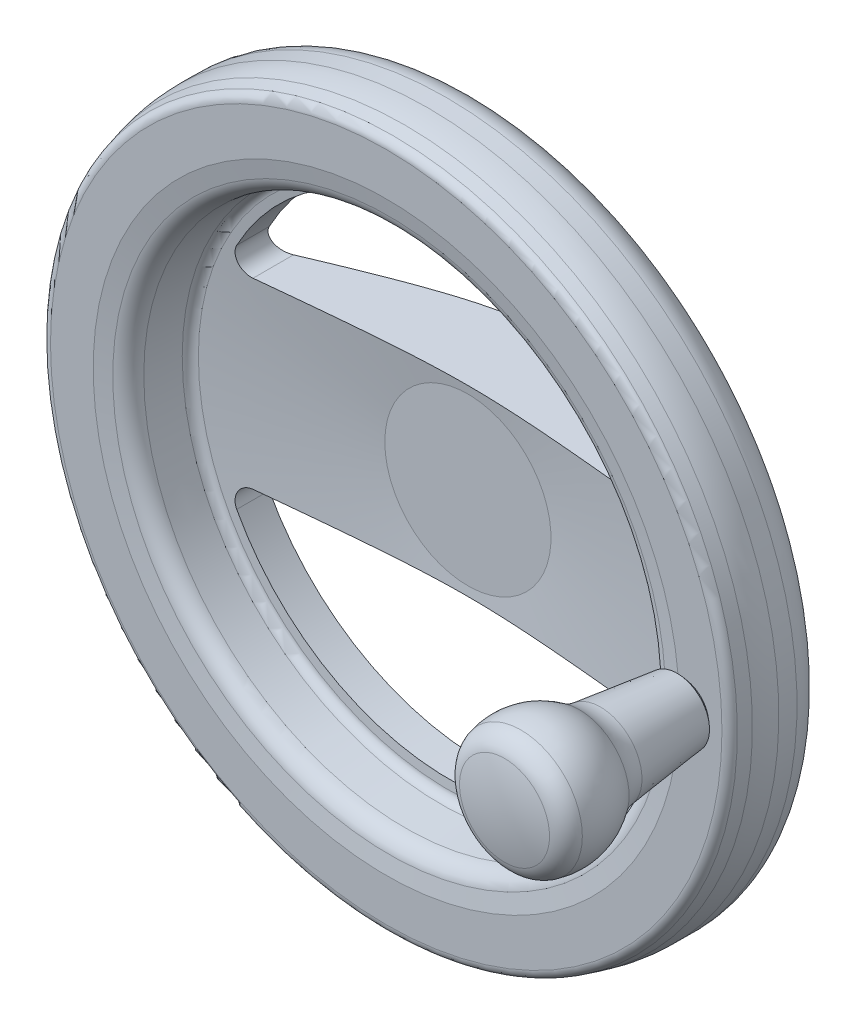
ISO-10303-21;
HEADER;
FILE_DESCRIPTION(('STEP AP214'),'2;1');
FILE_NAME('part.step','',(''),(''),'','','');
FILE_SCHEMA(('AUTOMOTIVE_DESIGN { 1 0 10303 214 1 1 1 1 }'));
ENDSEC;
DATA;
#1=APPLICATION_CONTEXT('core data for automotive mechanical design processes');
#2=APPLICATION_PROTOCOL_DEFINITION('international standard','automotive_design',2000,#1);
#3=PRODUCT_CONTEXT('',#1,'mechanical');
#4=PRODUCT('Part','Part','',(#3));
#5=PRODUCT_RELATED_PRODUCT_CATEGORY('part','',(#4));
#6=PRODUCT_DEFINITION_FORMATION('','',#4);
#7=PRODUCT_DEFINITION_CONTEXT('part definition',#1,'design');
#8=PRODUCT_DEFINITION('design','',#6,#7);
#9=PRODUCT_DEFINITION_SHAPE('','',#8);
#10=(LENGTH_UNIT() NAMED_UNIT(*) SI_UNIT(.MILLI.,.METRE.));
#11=(NAMED_UNIT(*) PLANE_ANGLE_UNIT() SI_UNIT($,.RADIAN.));
#12=(NAMED_UNIT(*) SI_UNIT($,.STERADIAN.) SOLID_ANGLE_UNIT());
#13=UNCERTAINTY_MEASURE_WITH_UNIT(LENGTH_MEASURE(1.E-05),#10,'distance_accuracy_value','');
#14=(GEOMETRIC_REPRESENTATION_CONTEXT(3) GLOBAL_UNCERTAINTY_ASSIGNED_CONTEXT((#13)) GLOBAL_UNIT_ASSIGNED_CONTEXT((#10,
#11,#12)) REPRESENTATION_CONTEXT('',''));
#15=CARTESIAN_POINT('',(0.,0.,0.));
#16=DIRECTION('',(0.,0.,1.));
#17=DIRECTION('',(1.,0.,0.));
#18=AXIS2_PLACEMENT_3D('',#15,#16,#17);
#19=CARTESIAN_POINT('',(105.,-2.04,53.));
#20=DIRECTION('',(0.,0.,-1.));
#21=DIRECTION('',(1.,0.,0.));
#22=AXIS2_PLACEMENT_3D('',#19,#20,#21);
#23=PLANE('',#22);
#24=CARTESIAN_POINT('',(105.,0.,53.000000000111));
#25=DIRECTION('',(0.,0.,1.));
#26=DIRECTION('',(-1.,0.,0.));
#27=AXIS2_PLACEMENT_3D('',#24,#25,#26);
#28=CIRCLE('',#27,4.0800000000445);
#29=CARTESIAN_POINT('',(100.919999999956,0.,53.000000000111));
#30=VERTEX_POINT('',#29);
#31=EDGE_CURVE('E365',#30,#30,#28,.T.);
#32=ORIENTED_EDGE('',*,*,#31,.F.);
#33=EDGE_LOOP('',(#32));
#34=FACE_BOUND('',#33,.T.);
#35=DIRECTION('',(-0.866025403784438,-0.5,0.));
#36=VECTOR('',#35,1.);
#37=CARTESIAN_POINT('',(105.,2.88675134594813,53.));
#38=LINE('',#37,#36);
#39=CARTESIAN_POINT('',(105.,2.88675134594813,53.));
#40=VERTEX_POINT('',#39);
#41=CARTESIAN_POINT('',(102.5,1.44337567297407,53.));
#42=VERTEX_POINT('',#41);
#43=EDGE_CURVE('E366',#40,#42,#38,.T.);
#44=ORIENTED_EDGE('',*,*,#43,.T.);
#45=DIRECTION('',(0.,-1.,0.));
#46=VECTOR('',#45,1.);
#47=CARTESIAN_POINT('',(102.5,-2.04,53.));
#48=LINE('',#47,#46);
#49=CARTESIAN_POINT('',(102.5,-1.44337567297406,53.));
#50=VERTEX_POINT('',#49);
#51=EDGE_CURVE('E362',#42,#50,#48,.T.);
#52=ORIENTED_EDGE('',*,*,#51,.T.);
#53=DIRECTION('',(0.866025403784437,-0.5,0.));
#54=VECTOR('',#53,1.);
#55=CARTESIAN_POINT('',(102.5,-1.44337567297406,53.));
#56=LINE('',#55,#54);
#57=CARTESIAN_POINT('',(105.,-2.88675134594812,53.));
#58=VERTEX_POINT('',#57);
#59=EDGE_CURVE('E378',#50,#58,#56,.T.);
#60=ORIENTED_EDGE('',*,*,#59,.T.);
#61=DIRECTION('',(0.866025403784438,0.5,0.));
#62=VECTOR('',#61,1.);
#63=CARTESIAN_POINT('',(105.,-2.88675134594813,53.));
#64=LINE('',#63,#62);
#65=CARTESIAN_POINT('',(107.5,-1.44337567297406,53.));
#66=VERTEX_POINT('',#65);
#67=EDGE_CURVE('E375',#58,#66,#64,.T.);
#68=ORIENTED_EDGE('',*,*,#67,.T.);
#69=DIRECTION('',(0.,-1.,0.));
#70=VECTOR('',#69,1.);
#71=CARTESIAN_POINT('',(107.5,-2.04,53.));
#72=LINE('',#71,#70);
#73=CARTESIAN_POINT('',(107.5,1.44337567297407,53.));
#74=VERTEX_POINT('',#73);
#75=EDGE_CURVE('E372',#66,#74,#72,.F.);
#76=ORIENTED_EDGE('',*,*,#75,.T.);
#77=DIRECTION('',(-0.86602540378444,0.5,0.));
#78=VECTOR('',#77,1.);
#79=CARTESIAN_POINT('',(107.5,1.44337567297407,53.));
#80=LINE('',#79,#78);
#81=EDGE_CURVE('E369',#74,#40,#80,.T.);
#82=ORIENTED_EDGE('',*,*,#81,.T.);
#83=EDGE_LOOP('',(#44,#52,#60,#68,#76,#82));
#84=FACE_BOUND('',#83,.T.);
#85=ADVANCED_FACE('F14',(#34,#84),#23,.T.);
#86=CARTESIAN_POINT('',(102.5,1.44337567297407,57.25));
#87=DIRECTION('',(-1.,0.,0.));
#88=DIRECTION('',(0.,-1.,0.));
#89=AXIS2_PLACEMENT_3D('',#86,#87,#88);
#90=PLANE('',#89);
#91=DIRECTION('',(0.,0.,1.));
#92=VECTOR('',#91,1.);
#93=CARTESIAN_POINT('',(102.5,1.44337567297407,57.25));
#94=LINE('',#93,#92);
#95=CARTESIAN_POINT('',(102.5,1.44337567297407,57.25));
#96=VERTEX_POINT('',#95);
#97=EDGE_CURVE('E381',#96,#42,#94,.F.);
#98=ORIENTED_EDGE('',*,*,#97,.F.);
#99=DIRECTION('',(0.,-1.,0.));
#100=VECTOR('',#99,1.);
#101=CARTESIAN_POINT('',(102.5,0.,57.25));
#102=LINE('',#101,#100);
#103=CARTESIAN_POINT('',(102.50000000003,0.,57.2500000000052));
#104=VERTEX_POINT('',#103);
#105=EDGE_CURVE('E426',#96,#104,#102,.T.);
#106=ORIENTED_EDGE('',*,*,#105,.T.);
#107=DIRECTION('',(0.,-1.,0.));
#108=VECTOR('',#107,1.);
#109=CARTESIAN_POINT('',(102.5,0.,57.25));
#110=LINE('',#109,#108);
#111=CARTESIAN_POINT('',(102.5,-1.44337567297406,57.25));
#112=VERTEX_POINT('',#111);
#113=EDGE_CURVE('E423',#104,#112,#110,.T.);
#114=ORIENTED_EDGE('',*,*,#113,.T.);
#115=DIRECTION('',(0.,0.,1.));
#116=VECTOR('',#115,1.);
#117=CARTESIAN_POINT('',(102.5,-1.44337567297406,57.25));
#118=LINE('',#117,#116);
#119=EDGE_CURVE('E393',#50,#112,#118,.T.);
#120=ORIENTED_EDGE('',*,*,#119,.F.);
#121=ORIENTED_EDGE('',*,*,#51,.F.);
#122=EDGE_LOOP('',(#98,#106,#114,#120,#121));
#123=FACE_BOUND('',#122,.T.);
#124=ADVANCED_FACE('F481',(#123),#90,.F.);
#125=CARTESIAN_POINT('',(105.,2.88675134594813,57.25));
#126=DIRECTION('',(-0.5,0.866025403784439,0.));
#127=DIRECTION('',(-0.866025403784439,-0.5,0.));
#128=AXIS2_PLACEMENT_3D('',#125,#126,#127);
#129=PLANE('',#128);
#130=DIRECTION('',(0.,0.,1.));
#131=VECTOR('',#130,1.);
#132=CARTESIAN_POINT('',(105.,2.88675134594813,57.25));
#133=LINE('',#132,#131);
#134=CARTESIAN_POINT('',(105.,2.88675134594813,57.25));
#135=VERTEX_POINT('',#134);
#136=EDGE_CURVE('E385',#135,#40,#133,.F.);
#137=ORIENTED_EDGE('',*,*,#136,.F.);
#138=DIRECTION('',(-0.866025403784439,-0.5,0.));
#139=VECTOR('',#138,1.);
#140=CARTESIAN_POINT('',(105.,2.88675134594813,57.25));
#141=LINE('',#140,#139);
#142=CARTESIAN_POINT('',(103.750000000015,2.1650635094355,57.2500000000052));
#143=VERTEX_POINT('',#142);
#144=EDGE_CURVE('E382',#143,#135,#141,.F.);
#145=ORIENTED_EDGE('',*,*,#144,.F.);
#146=DIRECTION('',(-0.86602540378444,-0.5,0.));
#147=VECTOR('',#146,1.);
#148=CARTESIAN_POINT('',(103.75,2.1650635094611,57.25));
#149=LINE('',#148,#147);
#150=EDGE_CURVE('E429',#143,#96,#149,.T.);
#151=ORIENTED_EDGE('',*,*,#150,.T.);
#152=ORIENTED_EDGE('',*,*,#97,.T.);
#153=ORIENTED_EDGE('',*,*,#43,.F.);
#154=EDGE_LOOP('',(#137,#145,#151,#152,#153));
#155=FACE_BOUND('',#154,.T.);
#156=ADVANCED_FACE('F485',(#155),#129,.F.);
#157=CARTESIAN_POINT('',(107.5,1.44337567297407,57.25));
#158=DIRECTION('',(0.5,0.866025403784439,0.));
#159=DIRECTION('',(-0.866025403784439,0.5,0.));
#160=AXIS2_PLACEMENT_3D('',#157,#158,#159);
#161=PLANE('',#160);
#162=DIRECTION('',(0.,0.,1.));
#163=VECTOR('',#162,1.);
#164=CARTESIAN_POINT('',(107.5,1.44337567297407,57.25));
#165=LINE('',#164,#163);
#166=CARTESIAN_POINT('',(107.5,1.44337567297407,57.25));
#167=VERTEX_POINT('',#166);
#168=EDGE_CURVE('E386',#167,#74,#165,.F.);
#169=ORIENTED_EDGE('',*,*,#168,.F.);
#170=DIRECTION('',(-0.86602540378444,0.5,0.));
#171=VECTOR('',#170,1.);
#172=CARTESIAN_POINT('',(107.5,1.44337567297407,57.25));
#173=LINE('',#172,#171);
#174=CARTESIAN_POINT('',(106.249999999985,2.1650635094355,57.2500000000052));
#175=VERTEX_POINT('',#174);
#176=EDGE_CURVE('E413',#167,#175,#173,.T.);
#177=ORIENTED_EDGE('',*,*,#176,.T.);
#178=DIRECTION('',(-0.866025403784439,0.5,0.));
#179=VECTOR('',#178,1.);
#180=CARTESIAN_POINT('',(107.5,1.44337567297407,57.25));
#181=LINE('',#180,#179);
#182=EDGE_CURVE('E387',#135,#175,#181,.F.);
#183=ORIENTED_EDGE('',*,*,#182,.F.);
#184=ORIENTED_EDGE('',*,*,#136,.T.);
#185=ORIENTED_EDGE('',*,*,#81,.F.);
#186=EDGE_LOOP('',(#169,#177,#183,#184,#185));
#187=FACE_BOUND('',#186,.T.);
#188=ADVANCED_FACE('F489',(#187),#161,.F.);
#189=CARTESIAN_POINT('',(107.5,-1.44337567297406,57.25));
#190=DIRECTION('',(1.,0.,0.));
#191=DIRECTION('',(0.,1.,0.));
#192=AXIS2_PLACEMENT_3D('',#189,#190,#191);
#193=PLANE('',#192);
#194=DIRECTION('',(0.,0.,1.));
#195=VECTOR('',#194,1.);
#196=CARTESIAN_POINT('',(107.5,-1.44337567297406,57.25));
#197=LINE('',#196,#195);
#198=CARTESIAN_POINT('',(107.5,-1.44337567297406,57.25));
#199=VERTEX_POINT('',#198);
#200=EDGE_CURVE('E390',#199,#66,#197,.F.);
#201=ORIENTED_EDGE('',*,*,#200,.F.);
#202=DIRECTION('',(0.,-1.,0.));
#203=VECTOR('',#202,1.);
#204=CARTESIAN_POINT('',(107.5,0.,57.25));
#205=LINE('',#204,#203);
#206=CARTESIAN_POINT('',(107.49999999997,0.,57.2500000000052));
#207=VERTEX_POINT('',#206);
#208=EDGE_CURVE('E407',#199,#207,#205,.F.);
#209=ORIENTED_EDGE('',*,*,#208,.T.);
#210=DIRECTION('',(0.,-1.,0.));
#211=VECTOR('',#210,1.);
#212=CARTESIAN_POINT('',(107.5,0.,57.25));
#213=LINE('',#212,#211);
#214=EDGE_CURVE('E417',#207,#167,#213,.F.);
#215=ORIENTED_EDGE('',*,*,#214,.T.);
#216=ORIENTED_EDGE('',*,*,#168,.T.);
#217=ORIENTED_EDGE('',*,*,#75,.F.);
#218=EDGE_LOOP('',(#201,#209,#215,#216,#217));
#219=FACE_BOUND('',#218,.T.);
#220=ADVANCED_FACE('F493',(#219),#193,.F.);
#221=CARTESIAN_POINT('',(105.,-2.88675134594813,57.25));
#222=DIRECTION('',(0.5,-0.866025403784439,0.));
#223=DIRECTION('',(0.866025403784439,0.5,0.));
#224=AXIS2_PLACEMENT_3D('',#221,#222,#223);
#225=PLANE('',#224);
#226=DIRECTION('',(0.,0.,1.));
#227=VECTOR('',#226,1.);
#228=CARTESIAN_POINT('',(105.,-2.88675134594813,57.25));
#229=LINE('',#228,#227);
#230=CARTESIAN_POINT('',(105.,-2.88675134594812,57.25));
#231=VERTEX_POINT('',#230);
#232=EDGE_CURVE('E401',#231,#58,#229,.F.);
#233=ORIENTED_EDGE('',*,*,#232,.F.);
#234=DIRECTION('',(0.866025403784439,0.5,0.));
#235=VECTOR('',#234,1.);
#236=CARTESIAN_POINT('',(105.,-2.88675134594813,57.25));
#237=LINE('',#236,#235);
#238=CARTESIAN_POINT('',(106.249999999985,-2.16506350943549,57.2500000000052));
#239=VERTEX_POINT('',#238);
#240=EDGE_CURVE('E397',#239,#231,#237,.F.);
#241=ORIENTED_EDGE('',*,*,#240,.F.);
#242=DIRECTION('',(0.866025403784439,0.5,0.));
#243=VECTOR('',#242,1.);
#244=CARTESIAN_POINT('',(105.,-2.88675134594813,57.25));
#245=LINE('',#244,#243);
#246=EDGE_CURVE('E394',#199,#239,#245,.F.);
#247=ORIENTED_EDGE('',*,*,#246,.F.);
#248=ORIENTED_EDGE('',*,*,#200,.T.);
#249=ORIENTED_EDGE('',*,*,#67,.F.);
#250=EDGE_LOOP('',(#233,#241,#247,#248,#249));
#251=FACE_BOUND('',#250,.T.);
#252=ADVANCED_FACE('F497',(#251),#225,.F.);
#253=CARTESIAN_POINT('',(102.5,-1.44337567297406,57.25));
#254=DIRECTION('',(-0.5,-0.866025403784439,0.));
#255=DIRECTION('',(0.866025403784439,-0.5,0.));
#256=AXIS2_PLACEMENT_3D('',#253,#254,#255);
#257=PLANE('',#256);
#258=ORIENTED_EDGE('',*,*,#119,.T.);
#259=DIRECTION('',(0.86602540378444,-0.5,0.));
#260=VECTOR('',#259,1.);
#261=CARTESIAN_POINT('',(102.5,-1.44337567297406,57.25));
#262=LINE('',#261,#260);
#263=CARTESIAN_POINT('',(103.750000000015,-2.16506350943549,57.2500000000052));
#264=VERTEX_POINT('',#263);
#265=EDGE_CURVE('E420',#112,#264,#262,.T.);
#266=ORIENTED_EDGE('',*,*,#265,.T.);
#267=DIRECTION('',(0.866025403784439,-0.5,0.));
#268=VECTOR('',#267,1.);
#269=CARTESIAN_POINT('',(102.5,-1.44337567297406,57.25));
#270=LINE('',#269,#268);
#271=EDGE_CURVE('E398',#231,#264,#270,.F.);
#272=ORIENTED_EDGE('',*,*,#271,.F.);
#273=ORIENTED_EDGE('',*,*,#232,.T.);
#274=ORIENTED_EDGE('',*,*,#59,.F.);
#275=EDGE_LOOP('',(#258,#266,#272,#273,#274));
#276=FACE_BOUND('',#275,.T.);
#277=ADVANCED_FACE('F501',(#276),#257,.F.);
#278=CARTESIAN_POINT('',(105.,0.,57.25));
#279=DIRECTION('',(0.,0.,1.));
#280=DIRECTION('',(0.,-1.,0.));
#281=AXIS2_PLACEMENT_3D('',#278,#279,#280);
#282=PLANE('',#281);
#283=CARTESIAN_POINT('',(105.,0.,57.2500000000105));
#284=DIRECTION('',(0.,0.,-1.));
#285=DIRECTION('',(1.,0.,0.));
#286=AXIS2_PLACEMENT_3D('',#283,#284,#285);
#287=CIRCLE('',#286,2.49999999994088);
#288=EDGE_CURVE('E410',#175,#143,#287,.F.);
#289=ORIENTED_EDGE('',*,*,#288,.T.);
#290=ORIENTED_EDGE('',*,*,#144,.T.);
#291=ORIENTED_EDGE('',*,*,#182,.T.);
#292=EDGE_LOOP('',(#289,#290,#291));
#293=FACE_BOUND('',#292,.T.);
#294=ADVANCED_FACE('F505',(#293),#282,.F.);
#295=CARTESIAN_POINT('',(105.,0.,57.25));
#296=DIRECTION('',(0.,0.,1.));
#297=DIRECTION('',(0.,-1.,0.));
#298=AXIS2_PLACEMENT_3D('',#295,#296,#297);
#299=PLANE('',#298);
#300=CARTESIAN_POINT('',(105.,0.,57.2500000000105));
#301=DIRECTION('',(0.,0.,-1.));
#302=DIRECTION('',(1.,0.,0.));
#303=AXIS2_PLACEMENT_3D('',#300,#301,#302);
#304=CIRCLE('',#303,2.49999999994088);
#305=EDGE_CURVE('E451',#264,#239,#304,.F.);
#306=ORIENTED_EDGE('',*,*,#305,.T.);
#307=ORIENTED_EDGE('',*,*,#240,.T.);
#308=ORIENTED_EDGE('',*,*,#271,.T.);
#309=EDGE_LOOP('',(#306,#307,#308));
#310=FACE_BOUND('',#309,.T.);
#311=ADVANCED_FACE('F509',(#310),#299,.F.);
#312=CARTESIAN_POINT('',(105.,0.,57.25));
#313=DIRECTION('',(0.,0.,1.));
#314=DIRECTION('',(0.,-1.,0.));
#315=AXIS2_PLACEMENT_3D('',#312,#313,#314);
#316=PLANE('',#315);
#317=ORIENTED_EDGE('',*,*,#208,.F.);
#318=ORIENTED_EDGE('',*,*,#246,.T.);
#319=CARTESIAN_POINT('',(105.,0.,57.2500000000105));
#320=DIRECTION('',(0.,0.,-1.));
#321=DIRECTION('',(1.,0.,0.));
#322=AXIS2_PLACEMENT_3D('',#319,#320,#321);
#323=CIRCLE('',#322,2.49999999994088);
#324=EDGE_CURVE('E404',#207,#239,#323,.T.);
#325=ORIENTED_EDGE('',*,*,#324,.F.);
#326=EDGE_LOOP('',(#317,#318,#325));
#327=FACE_BOUND('',#326,.T.);
#328=ADVANCED_FACE('F513',(#327),#316,.F.);
#329=CARTESIAN_POINT('',(105.,0.,57.2500000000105));
#330=DIRECTION('',(0.,0.,-1.));
#331=DIRECTION('',(1.,0.,0.));
#332=AXIS2_PLACEMENT_3D('',#329,#330,#331);
#333=CONICAL_SURFACE('',#332,2.49999999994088,1.04719755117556);
#334=CARTESIAN_POINT('',(105.,-5.6843418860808E-11,58.6933756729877));
#335=VERTEX_POINT('',#334);
#336=VERTEX_LOOP('',#335);
#337=FACE_BOUND('',#336,.T.);
#338=CARTESIAN_POINT('',(105.,0.,57.2500000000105));
#339=DIRECTION('',(0.,0.,-1.));
#340=DIRECTION('',(1.,0.,0.));
#341=AXIS2_PLACEMENT_3D('',#338,#339,#340);
#342=CIRCLE('',#341,2.49999999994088);
#343=EDGE_CURVE('E416',#143,#104,#342,.F.);
#344=ORIENTED_EDGE('',*,*,#343,.F.);
#345=ORIENTED_EDGE('',*,*,#288,.F.);
#346=CARTESIAN_POINT('',(105.,0.,57.2500000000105));
#347=DIRECTION('',(0.,0.,-1.));
#348=DIRECTION('',(1.,0.,0.));
#349=AXIS2_PLACEMENT_3D('',#346,#347,#348);
#350=CIRCLE('',#349,2.49999999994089);
#351=EDGE_CURVE('E448',#207,#175,#350,.F.);
#352=ORIENTED_EDGE('',*,*,#351,.F.);
#353=ORIENTED_EDGE('',*,*,#324,.T.);
#354=ORIENTED_EDGE('',*,*,#305,.F.);
#355=CARTESIAN_POINT('',(105.,0.,57.2500000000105));
#356=DIRECTION('',(0.,0.,-1.));
#357=DIRECTION('',(1.,0.,0.));
#358=AXIS2_PLACEMENT_3D('',#355,#356,#357);
#359=CIRCLE('',#358,2.49999999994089);
#360=EDGE_CURVE('E454',#104,#264,#359,.F.);
#361=ORIENTED_EDGE('',*,*,#360,.F.);
#362=EDGE_LOOP('',(#344,#345,#352,#353,#354,#361));
#363=FACE_BOUND('',#362,.T.);
#364=ADVANCED_FACE('F517',(#337,#363),#333,.F.);
#365=CARTESIAN_POINT('',(105.,0.,57.25));
#366=DIRECTION('',(0.,0.,1.));
#367=DIRECTION('',(0.,-1.,0.));
#368=AXIS2_PLACEMENT_3D('',#365,#366,#367);
#369=PLANE('',#368);
#370=ORIENTED_EDGE('',*,*,#176,.F.);
#371=ORIENTED_EDGE('',*,*,#214,.F.);
#372=ORIENTED_EDGE('',*,*,#351,.T.);
#373=EDGE_LOOP('',(#370,#371,#372));
#374=FACE_BOUND('',#373,.T.);
#375=ADVANCED_FACE('F521',(#374),#369,.F.);
#376=CARTESIAN_POINT('',(105.,0.,57.25));
#377=DIRECTION('',(0.,0.,1.));
#378=DIRECTION('',(0.,-1.,0.));
#379=AXIS2_PLACEMENT_3D('',#376,#377,#378);
#380=PLANE('',#379);
#381=ORIENTED_EDGE('',*,*,#265,.F.);
#382=ORIENTED_EDGE('',*,*,#113,.F.);
#383=ORIENTED_EDGE('',*,*,#360,.T.);
#384=EDGE_LOOP('',(#381,#382,#383));
#385=FACE_BOUND('',#384,.T.);
#386=ADVANCED_FACE('F525',(#385),#380,.F.);
#387=CARTESIAN_POINT('',(105.,0.,57.25));
#388=DIRECTION('',(0.,0.,1.));
#389=DIRECTION('',(0.,-1.,0.));
#390=AXIS2_PLACEMENT_3D('',#387,#388,#389);
#391=PLANE('',#390);
#392=ORIENTED_EDGE('',*,*,#105,.F.);
#393=ORIENTED_EDGE('',*,*,#150,.F.);
#394=ORIENTED_EDGE('',*,*,#343,.T.);
#395=EDGE_LOOP('',(#392,#393,#394));
#396=FACE_BOUND('',#395,.T.);
#397=ADVANCED_FACE('F477',(#396),#391,.F.);
#398=CARTESIAN_POINT('',(105.,0.,53.9199999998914));
#399=DIRECTION('',(0.,0.,1.));
#400=DIRECTION('',(-1.,0.,0.));
#401=AXIS2_PLACEMENT_3D('',#398,#399,#400);
#402=CONICAL_SURFACE('',#401,4.99999999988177,0.785398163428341);
#403=ORIENTED_EDGE('',*,*,#31,.T.);
#404=EDGE_LOOP('',(#403));
#405=FACE_BOUND('',#404,.T.);
#406=CARTESIAN_POINT('',(105.,0.,53.1080000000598));
#407=DIRECTION('',(0.,0.,1.));
#408=DIRECTION('',(-1.,0.,0.));
#409=AXIS2_PLACEMENT_3D('',#406,#407,#408);
#410=CIRCLE('',#409,4.188);
#411=CARTESIAN_POINT('',(100.812,0.,53.1080000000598));
#412=VERTEX_POINT('',#411);
#413=EDGE_CURVE('E9',#412,#412,#410,.F.);
#414=ORIENTED_EDGE('',*,*,#413,.T.);
#415=EDGE_LOOP('',(#414));
#416=FACE_BOUND('',#415,.T.);
#417=ADVANCED_FACE('F332',(#405,#416),#402,.T.);
#418=CARTESIAN_POINT('',(105.,0.,71.7284321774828));
#419=DIRECTION('',(0.,0.,1.));
#420=DIRECTION('',(0.,-1.,0.));
#421=AXIS2_PLACEMENT_3D('',#418,#419,#420);
#422=CONICAL_SURFACE('',#421,11.5,0.858106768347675);
#423=CARTESIAN_POINT('',(105.,0.,71.7284321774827));
#424=DIRECTION('',(0.,0.,1.));
#425=DIRECTION('',(0.,-1.,0.));
#426=AXIS2_PLACEMENT_3D('',#423,#424,#425);
#427=CIRCLE('',#426,11.5);
#428=CARTESIAN_POINT('',(105.,-11.5,71.7284321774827));
#429=VERTEX_POINT('',#428);
#430=EDGE_CURVE('E358',#429,#429,#427,.T.);
#431=ORIENTED_EDGE('',*,*,#430,.F.);
#432=EDGE_LOOP('',(#431));
#433=FACE_BOUND('',#432,.T.);
#434=CARTESIAN_POINT('',(105.,0.,70.));
#435=DIRECTION('',(0.,0.,1.));
#436=DIRECTION('',(0.,-1.,0.));
#437=AXIS2_PLACEMENT_3D('',#434,#435,#436);
#438=CIRCLE('',#437,9.5);
#439=CARTESIAN_POINT('',(103.604079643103,9.39688280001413,70.));
#440=VERTEX_POINT('',#439);
#441=CARTESIAN_POINT('',(103.604079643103,-9.39688280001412,70.));
#442=VERTEX_POINT('',#441);
#443=EDGE_CURVE('E361',#440,#442,#438,.T.);
#444=ORIENTED_EDGE('',*,*,#443,.T.);
#445=EDGE_CURVE('E441',#442,#440,#438,.T.);
#446=ORIENTED_EDGE('',*,*,#445,.T.);
#447=EDGE_LOOP('',(#444,#446));
#448=FACE_BOUND('',#447,.T.);
#449=ADVANCED_FACE('F351',(#433,#448),#422,.T.);
#450=CARTESIAN_POINT('',(105.,0.,98.9578448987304));
#451=DIRECTION('',(0.,0.,1.));
#452=DIRECTION('',(0.,-1.,0.));
#453=AXIS2_PLACEMENT_3D('',#450,#451,#452);
#454=CONICAL_SURFACE('',#453,14.7528672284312,0.118898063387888);
#455=CARTESIAN_POINT('',(105.,0.,98.9578448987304));
#456=DIRECTION('',(0.,0.,1.));
#457=DIRECTION('',(1.,0.,0.));
#458=AXIS2_PLACEMENT_3D('',#455,#456,#457);
#459=CIRCLE('',#458,14.7528672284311);
#460=CARTESIAN_POINT('',(119.752867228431,0.,98.9578448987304));
#461=VERTEX_POINT('',#460);
#462=EDGE_CURVE('E1448',#461,#461,#459,.F.);
#463=ORIENTED_EDGE('',*,*,#462,.T.);
#464=EDGE_LOOP('',(#463));
#465=FACE_BOUND('',#464,.T.);
#466=ORIENTED_EDGE('',*,*,#430,.T.);
#467=EDGE_LOOP('',(#466));
#468=FACE_BOUND('',#467,.T.);
#469=ADVANCED_FACE('F350',(#465,#468),#454,.T.);
#470=CARTESIAN_POINT('',(105.,-7.75,70.));
#471=DIRECTION('',(0.,0.,-1.));
#472=DIRECTION('',(1.,0.,0.));
#473=AXIS2_PLACEMENT_3D('',#470,#471,#472);
#474=PLANE('',#473);
#475=CARTESIAN_POINT('',(105.,0.,70.));
#476=DIRECTION('',(0.,0.,-1.));
#477=DIRECTION('',(-0.174463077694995,-0.984663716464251,0.));
#478=AXIS2_PLACEMENT_3D('',#475,#476,#477);
#479=CIRCLE('',#478,6.80000000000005);
#480=CARTESIAN_POINT('',(103.813651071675,-6.69571327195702,70.));
#481=VERTEX_POINT('',#480);
#482=CARTESIAN_POINT('',(103.813651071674,6.6957132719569,70.));
#483=VERTEX_POINT('',#482);
#484=EDGE_CURVE('E144',#481,#483,#479,.T.);
#485=ORIENTED_EDGE('',*,*,#484,.F.);
#486=CARTESIAN_POINT('',(0.,0.,70.));
#487=DIRECTION('',(0.,0.,-1.));
#488=DIRECTION('',(1.,0.,0.));
#489=AXIS2_PLACEMENT_3D('',#486,#487,#488);
#490=CIRCLE('',#489,104.029355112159);
#491=EDGE_CURVE('E23',#481,#442,#490,.T.);
#492=ORIENTED_EDGE('',*,*,#491,.T.);
#493=ORIENTED_EDGE('',*,*,#443,.F.);
#494=EDGE_CURVE('E31',#440,#483,#490,.T.);
#495=ORIENTED_EDGE('',*,*,#494,.T.);
#496=EDGE_LOOP('',(#485,#492,#493,#495));
#497=FACE_BOUND('',#496,.T.);
#498=ADVANCED_FACE('F465',(#497),#474,.T.);
#499=CARTESIAN_POINT('',(105.,0.,97.0599549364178));
#500=DIRECTION('',(0.,0.,1.));
#501=DIRECTION('',(1.,0.,0.));
#502=AXIS2_PLACEMENT_3D('',#499,#500,#501);
#503=TOROIDAL_SURFACE('',#502,30.6399064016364,16.0000000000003);
#504=ORIENTED_EDGE('',*,*,#462,.F.);
#505=EDGE_LOOP('',(#504));
#506=FACE_BOUND('',#505,.T.);
#507=CARTESIAN_POINT('',(105.,0.,106.480499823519));
#508=DIRECTION('',(0.,0.,1.));
#509=DIRECTION('',(1.,0.,0.));
#510=AXIS2_PLACEMENT_3D('',#507,#508,#509);
#511=CIRCLE('',#510,17.70726034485);
#512=CARTESIAN_POINT('',(122.70726034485,0.,106.480499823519));
#513=VERTEX_POINT('',#512);
#514=EDGE_CURVE('E1441',#513,#513,#511,.T.);
#515=ORIENTED_EDGE('',*,*,#514,.F.);
#516=EDGE_LOOP('',(#515));
#517=FACE_BOUND('',#516,.T.);
#518=ADVANCED_FACE('F474',(#506,#517),#503,.F.);
#519=CARTESIAN_POINT('',(102.499981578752,0.,121.200108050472));
#520=DIRECTION('',(0.,1.,0.));
#521=DIRECTION('',(1.,0.,0.));
#522=AXIS2_PLACEMENT_3D('',#519,#520,#521);
#523=CIRCLE('',#522,25.0000196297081);
#524=TRIMMED_CURVE('',#523,(PARAMETER_VALUE(-1.47062824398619)),
(PARAMETER_VALUE(1.47062824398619)),.T.,.PARAMETER.);
#525=CARTESIAN_POINT('',(105.,0.,121.200108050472));
#526=DIRECTION('',(0.,0.,1.));
#527=AXIS1_PLACEMENT('',#525,#526);
#528=SURFACE_OF_REVOLUTION('',#524,#527);
#529=CARTESIAN_POINT('',(105.,0.,127.157897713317));
#530=DIRECTION('',(0.,0.,1.));
#531=DIRECTION('',(1.,0.,0.));
#532=AXIS2_PLACEMENT_3D('',#529,#530,#531);
#533=CIRCLE('',#532,21.7797205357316);
#534=CARTESIAN_POINT('',(126.779720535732,0.,127.157897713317));
#535=VERTEX_POINT('',#534);
#536=EDGE_CURVE('E1443',#535,#535,#533,.F.);
#537=ORIENTED_EDGE('',*,*,#536,.T.);
#538=EDGE_LOOP('',(#537));
#539=FACE_BOUND('',#538,.T.);
#540=ORIENTED_EDGE('',*,*,#514,.T.);
#541=EDGE_LOOP('',(#540));
#542=FACE_BOUND('',#541,.T.);
#543=ADVANCED_FACE('F342',(#539,#542),#528,.F.);
#544=CARTESIAN_POINT('',(105.,0.,125.251386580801));
#545=DIRECTION('',(0.,0.,1.));
#546=DIRECTION('',(1.,0.,0.));
#547=AXIS2_PLACEMENT_3D('',#544,#545,#546);
#548=TOROIDAL_SURFACE('',#547,14.0102198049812,7.99999539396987);
#549=CARTESIAN_POINT('',(105.,0.,133.005948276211));
#550=DIRECTION('',(0.,0.,1.));
#551=DIRECTION('',(1.,0.,0.));
#552=AXIS2_PLACEMENT_3D('',#549,#550,#551);
#553=CIRCLE('',#552,15.9766122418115);
#554=CARTESIAN_POINT('',(120.976612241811,0.,133.005948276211));
#555=VERTEX_POINT('',#554);
#556=EDGE_CURVE('E356',#555,#555,#553,.F.);
#557=ORIENTED_EDGE('',*,*,#556,.T.);
#558=EDGE_LOOP('',(#557));
#559=FACE_BOUND('',#558,.T.);
#560=ORIENTED_EDGE('',*,*,#536,.F.);
#561=EDGE_LOOP('',(#560));
#562=FACE_BOUND('',#561,.T.);
#563=ADVANCED_FACE('F336',(#559,#562),#548,.T.);
#564=CARTESIAN_POINT('',(104.999948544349,0.,69.9991722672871));
#565=DIRECTION('',(0.,1.,0.));
#566=DIRECTION('',(1.,0.,0.));
#567=AXIS2_PLACEMENT_3D('',#564,#565,#566);
#568=CIRCLE('',#567,65.0008277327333);
#569=TRIMMED_CURVE('',#568,(PARAMETER_VALUE(-1.57079553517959)),
(PARAMETER_VALUE(1.57079553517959)),.T.,.PARAMETER.);
#570=CARTESIAN_POINT('',(105.,0.,69.9991722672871));
#571=DIRECTION('',(0.,0.,1.));
#572=AXIS1_PLACEMENT('',#570,#571);
#573=SURFACE_OF_REVOLUTION('',#569,#572);
#574=ORIENTED_EDGE('',*,*,#556,.F.);
#575=EDGE_LOOP('',(#574));
#576=FACE_BOUND('',#575,.T.);
#577=CARTESIAN_POINT('',(105.,0.,135.));
#578=VERTEX_POINT('',#577);
#579=VERTEX_LOOP('',#578);
#580=FACE_BOUND('',#579,.T.);
#581=ADVANCED_FACE('F330',(#576,#580),#573,.F.);
#582=CARTESIAN_POINT('',(105.,0.,56.6666666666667));
#583=DIRECTION('',(0.,0.,1.));
#584=DIRECTION('',(0.,-1.,0.));
#585=AXIS2_PLACEMENT_3D('',#582,#583,#584);
#586=CYLINDRICAL_SURFACE('',#585,4.188);
#587=ORIENTED_EDGE('',*,*,#413,.F.);
#588=EDGE_LOOP('',(#587));
#589=FACE_BOUND('',#588,.T.);
#590=CARTESIAN_POINT('',(105.,0.,44.1453333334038));
#591=DIRECTION('',(0.,0.,-1.));
#592=DIRECTION('',(-1.,0.,0.));
#593=AXIS2_PLACEMENT_3D('',#590,#591,#592);
#594=CIRCLE('',#593,4.187999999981);
#595=CARTESIAN_POINT('',(100.812000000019,0.,44.1453333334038));
#596=VERTEX_POINT('',#595);
#597=EDGE_CURVE('E219',#596,#596,#594,.T.);
#598=ORIENTED_EDGE('',*,*,#597,.T.);
#599=EDGE_LOOP('',(#598));
#600=FACE_BOUND('',#599,.T.);
#601=ADVANCED_FACE('F208',(#589,#600),#586,.F.);
#602=CARTESIAN_POINT('',(105.,0.,43.3333333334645));
#603=DIRECTION('',(0.,0.,-1.));
#604=DIRECTION('',(0.,1.,0.));
#605=AXIS2_PLACEMENT_3D('',#602,#603,#604);
#606=CONICAL_SURFACE('',#605,4.99999999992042,0.785398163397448);
#607=CARTESIAN_POINT('',(105.,0.,43.3333333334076));
#608=DIRECTION('',(0.,0.,-1.));
#609=DIRECTION('',(0.,1.,0.));
#610=AXIS2_PLACEMENT_3D('',#607,#608,#609);
#611=CIRCLE('',#610,4.99999999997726);
#612=CARTESIAN_POINT('',(105.,4.99999999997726,43.3333333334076));
#613=VERTEX_POINT('',#612);
#614=EDGE_CURVE('E740',#613,#613,#611,.T.);
#615=ORIENTED_EDGE('',*,*,#614,.T.);
#616=EDGE_LOOP('',(#615));
#617=FACE_BOUND('',#616,.T.);
#618=ORIENTED_EDGE('',*,*,#597,.F.);
#619=EDGE_LOOP('',(#618));
#620=FACE_BOUND('',#619,.T.);
#621=ADVANCED_FACE('F317',(#617,#620),#606,.F.);
#622=CARTESIAN_POINT('',(99.1666666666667,0.,43.3333333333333));
#623=DIRECTION('',(0.,0.,1.));
#624=DIRECTION('',(0.,-1.,0.));
#625=AXIS2_PLACEMENT_3D('',#622,#623,#624);
#626=PLANE('',#625);
#627=ORIENTED_EDGE('',*,*,#614,.F.);
#628=EDGE_LOOP('',(#627));
#629=FACE_BOUND('',#628,.T.);
#630=CARTESIAN_POINT('',(105.,0.,43.3333333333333));
#631=DIRECTION('',(0.,0.,1.));
#632=DIRECTION('',(0.,-1.,0.));
#633=AXIS2_PLACEMENT_3D('',#630,#631,#632);
#634=CIRCLE('',#633,6.66666666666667);
#635=CARTESIAN_POINT('',(105.,-6.66666666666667,43.3333333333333));
#636=VERTEX_POINT('',#635);
#637=EDGE_CURVE('E607',#636,#636,#634,.F.);
#638=ORIENTED_EDGE('',*,*,#637,.T.);
#639=EDGE_LOOP('',(#638));
#640=FACE_BOUND('',#639,.T.);
#641=ADVANCED_FACE('F319',(#629,#640),#626,.F.);
#642=CARTESIAN_POINT('',(105.,0.,40.6666666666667));
#643=DIRECTION('',(0.,0.,1.));
#644=DIRECTION('',(0.,-1.,0.));
#645=AXIS2_PLACEMENT_3D('',#642,#643,#644);
#646=CYLINDRICAL_SURFACE('',#645,6.66666666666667);
#647=CARTESIAN_POINT('',(105.,0.,38.));
#648=DIRECTION('',(0.,0.,1.));
#649=DIRECTION('',(0.,-1.,0.));
#650=AXIS2_PLACEMENT_3D('',#647,#648,#649);
#651=CIRCLE('',#650,6.66666666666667);
#652=CARTESIAN_POINT('',(105.,-6.66666666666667,38.));
#653=VERTEX_POINT('',#652);
#654=EDGE_CURVE('E594',#653,#653,#651,.T.);
#655=ORIENTED_EDGE('',*,*,#654,.F.);
#656=EDGE_LOOP('',(#655));
#657=FACE_BOUND('',#656,.T.);
#658=ORIENTED_EDGE('',*,*,#637,.F.);
#659=EDGE_LOOP('',(#658));
#660=FACE_BOUND('',#659,.T.);
#661=ADVANCED_FACE('F327',(#657,#660),#646,.F.);
#662=CARTESIAN_POINT('',(-102.838493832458,0.,38.));
#663=DIRECTION('',(0.,0.,-1.));
#664=DIRECTION('',(1.,0.,0.));
#665=AXIS2_PLACEMENT_3D('',#662,#663,#664);
#666=PLANE('',#665);
#667=CARTESIAN_POINT('',(0.,0.,38.));
#668=DIRECTION('',(0.,0.,1.));
#669=DIRECTION('',(0.,-1.,0.));
#670=AXIS2_PLACEMENT_3D('',#667,#668,#669);
#671=CIRCLE('',#670,113.833333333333);
#672=CARTESIAN_POINT('',(0.,113.833333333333,38.));
#673=VERTEX_POINT('',#672);
#674=CARTESIAN_POINT('',(0.,-113.833333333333,38.));
#675=VERTEX_POINT('',#674);
#676=EDGE_CURVE('E576',#673,#675,#671,.F.);
#677=ORIENTED_EDGE('',*,*,#676,.T.);
#678=CARTESIAN_POINT('',(0.,0.,38.));
#679=DIRECTION('',(0.,0.,1.));
#680=DIRECTION('',(-1.,0.,0.));
#681=AXIS2_PLACEMENT_3D('',#678,#679,#680);
#682=CIRCLE('',#681,113.833333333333);
#683=CARTESIAN_POINT('',(-113.833333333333,0.,38.));
#684=VERTEX_POINT('',#683);
#685=EDGE_CURVE('E432',#675,#684,#682,.F.);
#686=ORIENTED_EDGE('',*,*,#685,.T.);
#687=CARTESIAN_POINT('',(0.,0.,38.));
#688=DIRECTION('',(0.,0.,1.));
#689=DIRECTION('',(0.,1.,0.));
#690=AXIS2_PLACEMENT_3D('',#687,#688,#689);
#691=CIRCLE('',#690,113.833333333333);
#692=EDGE_CURVE('E585',#684,#673,#691,.F.);
#693=ORIENTED_EDGE('',*,*,#692,.T.);
#694=EDGE_LOOP('',(#677,#686,#693));
#695=FACE_BOUND('',#694,.T.);
#696=CARTESIAN_POINT('',(0.,0.,38.0000000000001));
#697=DIRECTION('',(0.,0.,-1.));
#698=DIRECTION('',(0.,-1.,0.));
#699=AXIS2_PLACEMENT_3D('',#696,#697,#698);
#700=CIRCLE('',#699,91.8436543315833);
#701=CARTESIAN_POINT('',(-91.8436543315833,0.,38.));
#702=VERTEX_POINT('',#701);
#703=CARTESIAN_POINT('',(0.,-91.8436543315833,38.));
#704=VERTEX_POINT('',#703);
#705=EDGE_CURVE('E590',#702,#704,#700,.F.);
#706=ORIENTED_EDGE('',*,*,#705,.T.);
#707=CARTESIAN_POINT('',(0.,0.,38.0000000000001));
#708=DIRECTION('',(0.,0.,-1.));
#709=DIRECTION('',(0.,1.,0.));
#710=AXIS2_PLACEMENT_3D('',#707,#708,#709);
#711=CIRCLE('',#710,91.8436543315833);
#712=CARTESIAN_POINT('',(0.,91.8436543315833,38.));
#713=VERTEX_POINT('',#712);
#714=EDGE_CURVE('E588',#704,#713,#711,.F.);
#715=ORIENTED_EDGE('',*,*,#714,.T.);
#716=CARTESIAN_POINT('',(0.,0.,38.0000000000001));
#717=DIRECTION('',(0.,0.,-1.));
#718=DIRECTION('',(-1.,0.,0.));
#719=AXIS2_PLACEMENT_3D('',#716,#717,#718);
#720=CIRCLE('',#719,91.8436543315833);
#721=EDGE_CURVE('E593',#713,#702,#720,.F.);
#722=ORIENTED_EDGE('',*,*,#721,.T.);
#723=EDGE_LOOP('',(#706,#715,#722));
#724=FACE_BOUND('',#723,.T.);
#725=ORIENTED_EDGE('',*,*,#654,.T.);
#726=EDGE_LOOP('',(#725));
#727=FACE_BOUND('',#726,.T.);
#728=ADVANCED_FACE('F533',(#695,#724,#727),#666,.T.);
#729=CARTESIAN_POINT('',(105.,0.,66.8));
#730=DIRECTION('',(0.,0.,-1.));
#731=DIRECTION('',(0.,1.,0.));
#732=AXIS2_PLACEMENT_3D('',#729,#730,#731);
#733=TOROIDAL_SURFACE('',#732,6.8,3.2);
#734=CARTESIAN_POINT('',(97.9420369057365,-5.84411042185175,68.9573579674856));
#735=CARTESIAN_POINT('',(98.0848597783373,-5.97857348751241,68.9839090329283));
#736=CARTESIAN_POINT('',(98.2329515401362,-6.10712843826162,69.0113679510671));
#737=CARTESIAN_POINT('',(98.53928461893,-6.35146158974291,69.0679970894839));
#738=CARTESIAN_POINT('',(98.6975370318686,-6.46722543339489,69.0971691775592));
#739=CARTESIAN_POINT('',(99.1887386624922,-6.79497826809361,69.1874257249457));
#740=CARTESIAN_POINT('',(99.5361153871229,-6.98551111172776,69.2508746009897));
#741=CARTESIAN_POINT('',(100.169919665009,-7.25857699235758,69.3657802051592));
#742=CARTESIAN_POINT('',(100.45005520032,-7.35618054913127,69.4163012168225));
#743=CARTESIAN_POINT('',(100.878472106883,-7.4683827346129,69.4930936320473));
#744=CARTESIAN_POINT('',(101.022446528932,-7.50006310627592,69.5188241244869));
#745=CARTESIAN_POINT('',(101.312481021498,-7.55104343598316,69.5704909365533));
#746=CARTESIAN_POINT('',(101.458539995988,-7.5703496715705,69.5964271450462));
#747=CARTESIAN_POINT('',(101.77355095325,-7.59708697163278,69.6521688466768));
#748=CARTESIAN_POINT('',(101.942706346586,-7.60235023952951,69.6819816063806));
#749=CARTESIAN_POINT('',(102.195952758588,-7.59438998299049,69.7264086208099));
#750=CARTESIAN_POINT('',(102.280297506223,-7.58909240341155,69.7411707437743));
#751=CARTESIAN_POINT('',(102.44842013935,-7.57262685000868,69.7705199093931));
#752=CARTESIAN_POINT('',(102.532198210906,-7.56146090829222,69.785107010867));
#753=CARTESIAN_POINT('',(102.721509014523,-7.52854611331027,69.8179719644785));
#754=CARTESIAN_POINT('',(102.82672623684,-7.50473832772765,69.8361683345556));
#755=CARTESIAN_POINT('',(102.981681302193,-7.4592072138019,69.8628379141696));
#756=CARTESIAN_POINT('',(103.032826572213,-7.44240580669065,69.8716188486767));
#757=CARTESIAN_POINT('',(103.133776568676,-7.40507427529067,69.8889002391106));
#758=CARTESIAN_POINT('',(103.183581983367,-7.38454610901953,69.8974008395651));
#759=CARTESIAN_POINT('',(103.286779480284,-7.33663477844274,69.9149503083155));
#760=CARTESIAN_POINT('',(103.339945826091,-7.30874056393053,69.9239534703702));
#761=CARTESIAN_POINT('',(103.44260224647,-7.2465479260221,69.941239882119));
#762=CARTESIAN_POINT('',(103.492094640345,-7.21225359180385,69.9495235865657));
#763=CARTESIAN_POINT('',(103.572462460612,-7.14623623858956,69.9628560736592));
#764=CARTESIAN_POINT('',(103.604758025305,-7.11631596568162,69.9681746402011));
#765=CARTESIAN_POINT('',(103.664547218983,-7.05185816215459,69.9779174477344));
#766=CARTESIAN_POINT('',(103.692050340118,-7.01733000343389,69.9823434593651));
#767=CARTESIAN_POINT('',(103.734173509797,-6.95272244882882,69.988989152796));
#768=CARTESIAN_POINT('',(103.7502972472,-6.9236593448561,69.9914837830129));
#769=CARTESIAN_POINT('',(103.777566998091,-6.86324018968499,69.9955754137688));
#770=CARTESIAN_POINT('',(103.788723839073,-6.8318893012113,69.9971743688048));
#771=CARTESIAN_POINT('',(103.80141733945,-6.78278382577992,69.9988417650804));
#772=CARTESIAN_POINT('',(103.80501156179,-6.76555288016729,69.9992763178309));
#773=CARTESIAN_POINT('',(103.810565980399,-6.73080631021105,69.9998562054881));
#774=CARTESIAN_POINT('',(103.812524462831,-6.71329040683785,70.0000012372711));
#775=CARTESIAN_POINT('',(103.813651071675,-6.69571327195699,70.));
#776=B_SPLINE_CURVE_WITH_KNOTS('',3,(#734,#735,#736,#737,#738,#739,#740,#741,#742,#743,#744,
#745,#746,#747,#748,#749,#750,#751,#752,#753,#754,#755,#756,#757,#758,#759,#760,#761,#762,#763,
#764,#765,#766,#767,#768,#769,#770,#771,#772,#773,#774,#775),.UNSPECIFIED.,.F.,.F.,(4,2,2,2,2,2,
2,2,2,2,2,2,2,2,2,2,2,2,2,2,4),(0.,0.593483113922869,1.18762574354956,2.38423125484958,
3.2836239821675,3.73210944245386,4.18036720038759,4.69464543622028,4.95184811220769,
5.208961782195,5.53638131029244,5.69990725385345,5.86334752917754,6.04515093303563,
6.22683857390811,6.35950537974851,6.4919063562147,6.59151406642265,6.69090356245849,
6.74365215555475,6.79645594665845),.UNSPECIFIED.);
#777=CARTESIAN_POINT('',(97.9420369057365,-5.84411042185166,68.9573579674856));
#778=VERTEX_POINT('',#777);
#779=EDGE_CURVE('E135',#778,#481,#776,.T.);
#780=ORIENTED_EDGE('',*,*,#779,.T.);
#781=ORIENTED_EDGE('',*,*,#484,.T.);
#782=CARTESIAN_POINT('',(103.813651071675,6.69571327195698,70.));
#783=CARTESIAN_POINT('',(103.812596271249,6.71219404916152,70.0000014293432));
#784=CARTESIAN_POINT('',(103.810806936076,6.72862724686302,69.9998737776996));
#785=CARTESIAN_POINT('',(103.80578553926,6.76125720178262,69.9993632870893));
#786=CARTESIAN_POINT('',(103.802554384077,6.77745410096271,69.9989806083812));
#787=CARTESIAN_POINT('',(103.794712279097,6.80933680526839,69.9979679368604));
#788=CARTESIAN_POINT('',(103.790114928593,6.82502603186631,69.9973403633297));
#789=CARTESIAN_POINT('',(103.779608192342,6.85594375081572,69.995850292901));
#790=CARTESIAN_POINT('',(103.773698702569,6.87117220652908,69.9949877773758));
#791=CARTESIAN_POINT('',(103.754178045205,6.91596144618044,69.9920762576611));
#792=CARTESIAN_POINT('',(103.73874958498,6.94472471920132,69.9897000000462));
#793=CARTESIAN_POINT('',(103.703990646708,6.99974279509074,69.9842355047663));
#794=CARTESIAN_POINT('',(103.684650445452,7.02599110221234,69.98114549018));
#795=CARTESIAN_POINT('',(103.62877986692,7.09296927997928,69.9721181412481));
#796=CARTESIAN_POINT('',(103.589527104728,7.13135358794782,69.9656770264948));
#797=CARTESIAN_POINT('',(103.505792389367,7.20170091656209,69.9518040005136));
#798=CARTESIAN_POINT('',(103.461294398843,7.23364338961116,69.9443690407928));
#799=CARTESIAN_POINT('',(103.37362343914,7.28914709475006,69.9296339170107));
#800=CARTESIAN_POINT('',(103.330762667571,7.31322695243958,69.9223945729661));
#801=CARTESIAN_POINT('',(103.243168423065,7.35760585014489,69.9075424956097));
#802=CARTESIAN_POINT('',(103.19843346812,7.37790182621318,69.8999294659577));
#803=CARTESIAN_POINT('',(103.107610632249,7.41521087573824,69.8844264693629));
#804=CARTESIAN_POINT('',(103.061521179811,7.43221994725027,69.8765361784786));
#805=CARTESIAN_POINT('',(102.968392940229,7.46331128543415,69.8605532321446));
#806=CARTESIAN_POINT('',(102.921353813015,7.4773924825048,69.8524605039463));
#807=CARTESIAN_POINT('',(102.785071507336,7.51412402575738,69.8289640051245));
#808=CARTESIAN_POINT('',(102.694963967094,7.53347149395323,69.8133675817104));
#809=CARTESIAN_POINT('',(102.513462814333,7.56436834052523,69.7818500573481));
#810=CARTESIAN_POINT('',(102.422068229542,7.57591146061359,69.7659287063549));
#811=CARTESIAN_POINT('',(102.238612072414,7.59214925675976,69.7338805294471));
#812=CARTESIAN_POINT('',(102.146549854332,7.59683604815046,69.7177534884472));
#813=CARTESIAN_POINT('',(101.962329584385,7.60003091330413,69.6854019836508));
#814=CARTESIAN_POINT('',(101.870171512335,7.59853717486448,69.6691774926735));
#815=CARTESIAN_POINT('',(101.632613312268,7.58738450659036,69.627259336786));
#816=CARTESIAN_POINT('',(101.487403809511,7.57348400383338,69.6015435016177));
#817=CARTESIAN_POINT('',(101.198724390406,7.53308271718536,69.5502528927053));
#818=CARTESIAN_POINT('',(101.055255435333,7.50657526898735,69.5246782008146));
#819=CARTESIAN_POINT('',(100.628466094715,7.40980419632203,69.4483687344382));
#820=CARTESIAN_POINT('',(100.348871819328,7.32229868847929,69.3980677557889));
#821=CARTESIAN_POINT('',(99.730866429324,7.07888572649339,69.286292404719));
#822=CARTESIAN_POINT('',(99.3971691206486,6.91084105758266,69.2255049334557));
#823=CARTESIAN_POINT('',(98.7621947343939,6.52157357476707,69.1091565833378));
#824=CARTESIAN_POINT('',(98.4608719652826,6.30042717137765,69.0535883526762));
#825=CARTESIAN_POINT('',(98.0981458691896,5.98791933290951,68.9863581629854));
#826=CARTESIAN_POINT('',(98.0192856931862,5.91685804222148,68.9717188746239));
#827=CARTESIAN_POINT('',(97.9420369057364,5.84411042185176,68.9573579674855));
#828=B_SPLINE_CURVE_WITH_KNOTS('',3,(#782,#783,#784,#785,#786,#787,#788,#789,#790,#791,#792,
#793,#794,#795,#796,#797,#798,#799,#800,#801,#802,#803,#804,#805,#806,#807,#808,#809,#810,#811,
#812,#813,#814,#815,#816,#817,#818,#819,#820,#821,#822,#823,#824,#825,#826,#827),.UNSPECIFIED.,
.F.,.F.,(4,2,2,2,2,2,2,2,2,2,2,2,2,2,2,2,2,2,2,2,2,2,4),(0.,0.0495259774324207,
0.0990208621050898,0.148038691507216,0.197060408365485,0.294802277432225,0.392790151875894,
0.557666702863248,0.723061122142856,0.871922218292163,1.02090333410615,1.17006471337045,
1.31928048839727,1.59924523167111,1.87943421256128,2.15994515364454,2.44053834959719,
2.8842358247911,3.32816810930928,4.21636017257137,5.34639242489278,6.47480826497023,
6.79615976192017),.UNSPECIFIED.);
#829=CARTESIAN_POINT('',(97.9420369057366,5.84411042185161,68.9573579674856));
#830=VERTEX_POINT('',#829);
#831=EDGE_CURVE('E132',#483,#830,#828,.T.);
#832=ORIENTED_EDGE('',*,*,#831,.T.);
#833=CARTESIAN_POINT('',(97.9420369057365,5.84411042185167,68.9573579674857));
#834=CARTESIAN_POINT('',(97.8770821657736,5.78294337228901,68.9452846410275));
#835=CARTESIAN_POINT('',(97.8125488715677,5.72154708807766,68.932136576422));
#836=CARTESIAN_POINT('',(97.684500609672,5.5981649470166,68.9037924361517));
#837=CARTESIAN_POINT('',(97.6209856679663,5.53617907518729,68.888596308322));
#838=CARTESIAN_POINT('',(97.4319612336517,5.34887235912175,68.8400183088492));
#839=CARTESIAN_POINT('',(97.308257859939,5.22246887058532,68.8037005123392));
#840=CARTESIAN_POINT('',(97.0671456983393,4.96561007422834,68.724371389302));
#841=CARTESIAN_POINT('',(96.9497421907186,4.835151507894,68.6813545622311));
#842=CARTESIAN_POINT('',(96.7220227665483,4.56822785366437,68.5898286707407));
#843=CARTESIAN_POINT('',(96.6117658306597,4.43172541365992,68.5412812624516));
#844=CARTESIAN_POINT('',(96.4008451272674,4.15287547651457,68.440904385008));
#845=CARTESIAN_POINT('',(96.3001712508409,4.01053437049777,68.3890784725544));
#846=CARTESIAN_POINT('',(96.1095678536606,3.71936197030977,68.2843069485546));
#847=CARTESIAN_POINT('',(96.0196303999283,3.57053558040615,68.2313621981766));
#848=CARTESIAN_POINT('',(95.852822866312,3.26867425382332,68.1275738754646));
#849=CARTESIAN_POINT('',(95.7757531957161,3.11575708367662,68.0767097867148));
#850=CARTESIAN_POINT('',(95.6334496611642,2.80340424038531,67.9784125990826));
#851=CARTESIAN_POINT('',(95.5682169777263,2.64396791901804,67.9309798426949));
#852=CARTESIAN_POINT('',(95.4502611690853,2.31983916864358,67.8419677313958));
#853=CARTESIAN_POINT('',(95.397480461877,2.15517509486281,67.8003618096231));
#854=CARTESIAN_POINT('',(95.3042066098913,1.82070166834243,67.7247027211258));
#855=CARTESIAN_POINT('',(95.2637128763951,1.65089256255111,67.6906491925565));
#856=CARTESIAN_POINT('',(95.1947732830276,1.30592362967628,67.6314953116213));
#857=CARTESIAN_POINT('',(95.1664209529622,1.13073302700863,67.6064646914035));
#858=CARTESIAN_POINT('',(95.1221596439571,0.777596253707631,67.5669382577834));
#859=CARTESIAN_POINT('',(95.1062511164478,0.599649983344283,67.552442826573));
#860=CARTESIAN_POINT('',(95.0868052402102,0.242218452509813,67.5346788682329));
#861=CARTESIAN_POINT('',(95.0832889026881,0.0627310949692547,67.531429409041));
#862=CARTESIAN_POINT('',(95.0886709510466,-0.295890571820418,67.5363713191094));
#863=CARTESIAN_POINT('',(95.0975684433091,-0.47502490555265,67.544561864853));
#864=CARTESIAN_POINT('',(95.1264065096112,-0.814813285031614,67.5707016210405));
#865=CARTESIAN_POINT('',(95.1452446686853,-0.975638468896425,67.5876738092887));
#866=CARTESIAN_POINT('',(95.1932086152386,-1.29460847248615,67.6300068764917));
#867=CARTESIAN_POINT('',(95.2223334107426,-1.45275354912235,67.6553669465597));
#868=CARTESIAN_POINT('',(95.2908507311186,-1.76517885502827,67.7134178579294));
#869=CARTESIAN_POINT('',(95.3302286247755,-1.91946425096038,67.7460982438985));
#870=CARTESIAN_POINT('',(95.4192332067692,-2.22361365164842,67.8175079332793));
#871=CARTESIAN_POINT('',(95.4688610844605,-2.37347714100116,67.8562379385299));
#872=CARTESIAN_POINT('',(95.5934542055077,-2.70920423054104,67.9496442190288));
#873=CARTESIAN_POINT('',(95.6716272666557,-2.89348276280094,68.0057590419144));
#874=CARTESIAN_POINT('',(95.8438518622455,-3.25317418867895,68.1219019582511));
#875=CARTESIAN_POINT('',(95.9379077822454,-3.4285846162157,68.1819311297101));
#876=CARTESIAN_POINT('',(96.1410987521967,-3.7711086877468,68.3025043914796));
#877=CARTESIAN_POINT('',(96.2502850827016,-3.93819137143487,68.3630495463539));
#878=CARTESIAN_POINT('',(96.4818567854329,-4.26405095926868,68.4810005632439));
#879=CARTESIAN_POINT('',(96.6042402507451,-4.42282905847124,68.5384068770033));
#880=CARTESIAN_POINT('',(96.7934727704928,-4.65240427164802,68.6187625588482));
#881=CARTESIAN_POINT('',(96.8560427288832,-4.72594851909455,68.6440841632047));
#882=CARTESIAN_POINT('',(96.9834849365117,-4.87157781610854,68.693036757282));
#883=CARTESIAN_POINT('',(97.048356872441,-4.94366306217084,68.7166679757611));
#884=CARTESIAN_POINT('',(97.180150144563,-5.08655645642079,68.7619849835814));
#885=CARTESIAN_POINT('',(97.2470714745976,-5.15736460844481,68.7836707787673));
#886=CARTESIAN_POINT('',(97.382303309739,-5.29747756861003,68.8247558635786));
#887=CARTESIAN_POINT('',(97.4506033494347,-5.36678876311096,68.8441678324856));
#888=CARTESIAN_POINT('',(97.5887122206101,-5.50451480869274,68.8806649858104));
#889=CARTESIAN_POINT('',(97.6585210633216,-5.57292965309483,68.8977501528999));
#890=CARTESIAN_POINT('',(97.7993965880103,-5.70902672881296,68.929446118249));
#891=CARTESIAN_POINT('',(97.8704632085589,-5.77670899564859,68.9440570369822));
#892=CARTESIAN_POINT('',(97.9420369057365,-5.84411042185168,68.9573579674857));
#893=B_SPLINE_CURVE_WITH_KNOTS('',3,(#833,#834,#835,#836,#837,#838,#839,#840,#841,#842,#843,
#844,#845,#846,#847,#848,#849,#850,#851,#852,#853,#854,#855,#856,#857,#858,#859,#860,#861,#862,
#863,#864,#865,#866,#867,#868,#869,#870,#871,#872,#873,#874,#875,#876,#877,#878,#879,#880,#881,
#882,#883,#884,#885,#886,#887,#888,#889,#890,#891,#892),.UNSPECIFIED.,.F.,.F.,(4,2,2,2,2,2,2,2,
2,2,2,2,2,2,2,2,2,2,2,2,2,2,2,2,2,2,2,2,2,4),(0.,0.270088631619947,0.540184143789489,
1.08155676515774,1.62337627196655,2.16921159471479,2.71446459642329,3.25931219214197,
3.79470969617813,4.33016056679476,4.86308455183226,5.3959829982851,5.93291577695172,
6.4698680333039,7.0077302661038,7.54555378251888,8.03342520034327,8.52124958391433,
9.00838161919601,9.4955702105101,10.118310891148,10.7412238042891,11.3663020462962,
11.9912900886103,12.2907233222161,12.5901159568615,12.8895076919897,13.1871413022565,
13.4847771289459,13.7823984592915),.UNSPECIFIED.);
#894=EDGE_CURVE('E139',#830,#778,#893,.T.);
#895=ORIENTED_EDGE('',*,*,#894,.T.);
#896=EDGE_LOOP('',(#780,#781,#832,#895));
#897=FACE_BOUND('',#896,.T.);
#898=ADVANCED_FACE('F143',(#897),#733,.T.);
#899=CARTESIAN_POINT('',(-111.60789201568,0.,70.));
#900=DIRECTION('',(0.,0.,1.));
#901=DIRECTION('',(0.,-1.,0.));
#902=AXIS2_PLACEMENT_3D('',#899,#900,#901);
#903=PLANE('',#902);
#904=CARTESIAN_POINT('',(0.,0.,70.));
#905=DIRECTION('',(0.,0.,1.));
#906=DIRECTION('',(-1.,0.,0.));
#907=AXIS2_PLACEMENT_3D('',#904,#905,#906);
#908=CIRCLE('',#907,104.029355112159);
#909=EDGE_CURVE('E189',#442,#440,#908,.F.);
#910=ORIENTED_EDGE('',*,*,#909,.T.);
#911=ORIENTED_EDGE('',*,*,#445,.F.);
#912=EDGE_LOOP('',(#910,#911));
#913=FACE_BOUND('',#912,.T.);
#914=CARTESIAN_POINT('',(0.,0.,70.));
#915=DIRECTION('',(0.,0.,-1.));
#916=DIRECTION('',(0.,-1.,0.));
#917=AXIS2_PLACEMENT_3D('',#914,#915,#916);
#918=CIRCLE('',#917,119.186428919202);
#919=CARTESIAN_POINT('',(0.,-119.186428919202,70.));
#920=VERTEX_POINT('',#919);
#921=CARTESIAN_POINT('',(-119.186428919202,0.,70.));
#922=VERTEX_POINT('',#921);
#923=EDGE_CURVE('E1358',#920,#922,#918,.T.);
#924=ORIENTED_EDGE('',*,*,#923,.F.);
#925=CARTESIAN_POINT('',(0.,0.,70.));
#926=DIRECTION('',(0.,0.,-1.));
#927=DIRECTION('',(0.,1.,0.));
#928=AXIS2_PLACEMENT_3D('',#925,#926,#927);
#929=CIRCLE('',#928,119.186428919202);
#930=CARTESIAN_POINT('',(0.,119.186428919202,70.));
#931=VERTEX_POINT('',#930);
#932=EDGE_CURVE('E229',#931,#920,#929,.T.);
#933=ORIENTED_EDGE('',*,*,#932,.F.);
#934=CARTESIAN_POINT('',(0.,0.,70.));
#935=DIRECTION('',(0.,0.,-1.));
#936=DIRECTION('',(-1.,0.,0.));
#937=AXIS2_PLACEMENT_3D('',#934,#935,#936);
#938=CIRCLE('',#937,119.186428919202);
#939=EDGE_CURVE('E275',#922,#931,#938,.T.);
#940=ORIENTED_EDGE('',*,*,#939,.F.);
#941=EDGE_LOOP('',(#924,#933,#940));
#942=FACE_BOUND('',#941,.T.);
#943=ADVANCED_FACE('F169',(#913,#942),#903,.T.);
#944=CARTESIAN_POINT('',(0.,0.,70.));
#945=DIRECTION('',(0.,0.,1.));
#946=DIRECTION('',(-1.,0.,0.));
#947=AXIS2_PLACEMENT_3D('',#944,#945,#946);
#948=CONICAL_SURFACE('',#947,104.029355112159,1.39626340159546);
#949=CARTESIAN_POINT('',(0.,0.,68.9573579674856));
#950=DIRECTION('',(0.,0.,1.));
#951=DIRECTION('',(-1.,0.,0.));
#952=AXIS2_PLACEMENT_3D('',#949,#950,#951);
#953=CIRCLE('',#952,98.116238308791);
#954=EDGE_CURVE('E126',#830,#778,#953,.T.);
#955=ORIENTED_EDGE('',*,*,#954,.F.);
#956=ORIENTED_EDGE('',*,*,#831,.F.);
#957=ORIENTED_EDGE('',*,*,#494,.F.);
#958=ORIENTED_EDGE('',*,*,#909,.F.);
#959=ORIENTED_EDGE('',*,*,#491,.F.);
#960=ORIENTED_EDGE('',*,*,#779,.F.);
#961=EDGE_LOOP('',(#955,#956,#957,#958,#959,#960));
#962=FACE_BOUND('',#961,.T.);
#963=ADVANCED_FACE('F130',(#962),#948,.F.);
#964=CARTESIAN_POINT('',(0.,0.,66.8));
#965=DIRECTION('',(0.,0.,-1.));
#966=DIRECTION('',(0.,1.,0.));
#967=AXIS2_PLACEMENT_3D('',#964,#965,#966);
#968=TOROIDAL_SURFACE('',#967,119.186428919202,3.2);
#969=CARTESIAN_POINT('',(0.,0.,67.6282209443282));
#970=DIRECTION('',(0.,0.,-1.));
#971=DIRECTION('',(-1.,0.,0.));
#972=AXIS2_PLACEMENT_3D('',#969,#970,#971);
#973=CIRCLE('',#972,122.277391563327);
#974=CARTESIAN_POINT('',(-122.277391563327,0.,67.6282209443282));
#975=VERTEX_POINT('',#974);
#976=EDGE_CURVE('E221',#975,#975,#973,.T.);
#977=ORIENTED_EDGE('',*,*,#976,.F.);
#978=EDGE_LOOP('',(#977));
#979=FACE_BOUND('',#978,.T.);
#980=ORIENTED_EDGE('',*,*,#923,.T.);
#981=ORIENTED_EDGE('',*,*,#939,.T.);
#982=ORIENTED_EDGE('',*,*,#932,.T.);
#983=EDGE_LOOP('',(#980,#981,#982));
#984=FACE_BOUND('',#983,.T.);
#985=ADVANCED_FACE('F168',(#979,#984),#968,.T.);
#986=CARTESIAN_POINT('',(0.,0.,62.6545883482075));
#987=DIRECTION('',(0.,0.,-1.));
#988=DIRECTION('',(0.,1.,0.));
#989=AXIS2_PLACEMENT_3D('',#986,#987,#988);
#990=TOROIDAL_SURFACE('',#989,99.2275866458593,6.4);
#991=CARTESIAN_POINT('',(0.,0.,63.2123851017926));
#992=DIRECTION('',(0.,0.,1.));
#993=DIRECTION('',(-1.,0.,0.));
#994=AXIS2_PLACEMENT_3D('',#991,#992,#993);
#995=CIRCLE('',#994,92.8519405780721);
#996=CARTESIAN_POINT('',(-92.8519405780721,0.,63.2123851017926));
#997=VERTEX_POINT('',#996);
#998=EDGE_CURVE('E184',#997,#997,#995,.F.);
#999=ORIENTED_EDGE('',*,*,#998,.T.);
#1000=EDGE_LOOP('',(#999));
#1001=FACE_BOUND('',#1000,.T.);
#1002=ORIENTED_EDGE('',*,*,#894,.F.);
#1003=ORIENTED_EDGE('',*,*,#954,.T.);
#1004=EDGE_LOOP('',(#1002,#1003));
#1005=FACE_BOUND('',#1004,.T.);
#1006=ADVANCED_FACE('F140',(#1001,#1005),#990,.T.);
#1007=CARTESIAN_POINT('',(0.,0.,63.4026628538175));
#1008=DIRECTION('',(0.,0.,-1.));
#1009=DIRECTION('',(1.,0.,0.));
#1010=AXIS2_PLACEMENT_3D('',#1007,#1008,#1009);
#1011=CONICAL_SURFACE('',#1010,123.409626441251,0.26179938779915);
#1012=CARTESIAN_POINT('',(0.,0.,63.4026628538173));
#1013=DIRECTION('',(0.,0.,-1.));
#1014=DIRECTION('',(0.,1.,0.));
#1015=AXIS2_PLACEMENT_3D('',#1012,#1013,#1014);
#1016=CIRCLE('',#1015,123.40962644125);
#1017=CARTESIAN_POINT('',(0.,123.40962644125,63.4026628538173));
#1018=VERTEX_POINT('',#1017);
#1019=EDGE_CURVE('E708',#1018,#1018,#1016,.T.);
#1020=ORIENTED_EDGE('',*,*,#1019,.F.);
#1021=EDGE_LOOP('',(#1020));
#1022=FACE_BOUND('',#1021,.T.);
#1023=ORIENTED_EDGE('',*,*,#976,.T.);
#1024=EDGE_LOOP('',(#1023));
#1025=FACE_BOUND('',#1024,.T.);
#1026=ADVANCED_FACE('F807',(#1022,#1025),#1011,.T.);
#1027=CARTESIAN_POINT('',(0.,0.,63.2123851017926));
#1028=DIRECTION('',(0.,0.,1.));
#1029=DIRECTION('',(-1.,0.,0.));
#1030=AXIS2_PLACEMENT_3D('',#1027,#1028,#1029);
#1031=CONICAL_SURFACE('',#1030,92.8519405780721,0.0872664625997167);
#1032=CARTESIAN_POINT('',(0.,0.,50.6671776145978));
#1033=DIRECTION('',(0.,0.,-1.));
#1034=DIRECTION('',(0.,1.,0.));
#1035=AXIS2_PLACEMENT_3D('',#1032,#1033,#1034);
#1036=CIRCLE('',#1035,91.7543771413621);
#1037=CARTESIAN_POINT('',(0.,91.7543771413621,50.6671776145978));
#1038=VERTEX_POINT('',#1037);
#1039=EDGE_CURVE('E226',#1038,#1038,#1036,.T.);
#1040=ORIENTED_EDGE('',*,*,#1039,.T.);
#1041=EDGE_LOOP('',(#1040));
#1042=FACE_BOUND('',#1041,.T.);
#1043=ORIENTED_EDGE('',*,*,#998,.F.);
#1044=EDGE_LOOP('',(#1043));
#1045=FACE_BOUND('',#1044,.T.);
#1046=ADVANCED_FACE('F801',(#1042,#1045),#1031,.F.);
#1047=CARTESIAN_POINT('',(0.,0.,55.1204534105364));
#1048=DIRECTION('',(0.,0.,-1.));
#1049=DIRECTION('',(0.,1.,0.));
#1050=AXIS2_PLACEMENT_3D('',#1047,#1048,#1049);
#1051=TOROIDAL_SURFACE('',#1050,92.5,32.);
#1052=ORIENTED_EDGE('',*,*,#1019,.T.);
#1053=EDGE_LOOP('',(#1052));
#1054=FACE_BOUND('',#1053,.T.);
#1055=CARTESIAN_POINT('',(0.,0.,55.1204534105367));
#1056=DIRECTION('',(0.,0.,1.));
#1057=DIRECTION('',(-1.,0.,0.));
#1058=AXIS2_PLACEMENT_3D('',#1055,#1056,#1057);
#1059=CIRCLE('',#1058,124.5);
#1060=CARTESIAN_POINT('',(-124.5,0.,55.1204534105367));
#1061=VERTEX_POINT('',#1060);
#1062=EDGE_CURVE('E610',#1061,#1061,#1059,.F.);
#1063=ORIENTED_EDGE('',*,*,#1062,.F.);
#1064=EDGE_LOOP('',(#1063));
#1065=FACE_BOUND('',#1064,.T.);
#1066=ADVANCED_FACE('F799',(#1054,#1065),#1051,.T.);
#1067=CARTESIAN_POINT('',(0.,0.,50.9460759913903));
#1068=DIRECTION('',(0.,0.,-1.));
#1069=DIRECTION('',(0.,1.,0.));
#1070=AXIS2_PLACEMENT_3D('',#1067,#1068,#1069);
#1071=TOROIDAL_SURFACE('',#1070,88.5665541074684,3.20000000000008);
#1072=CARTESIAN_POINT('',(0.,0.,47.7666195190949));
#1073=DIRECTION('',(0.,0.,1.));
#1074=DIRECTION('',(-1.,0.,0.));
#1075=AXIS2_PLACEMENT_3D('',#1072,#1073,#1074);
#1076=CIRCLE('',#1075,88.9285714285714);
#1077=CARTESIAN_POINT('',(-88.9285714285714,0.,47.7666195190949));
#1078=VERTEX_POINT('',#1077);
#1079=EDGE_CURVE('E223',#1078,#1078,#1076,.F.);
#1080=ORIENTED_EDGE('',*,*,#1079,.T.);
#1081=EDGE_LOOP('',(#1080));
#1082=FACE_BOUND('',#1081,.T.);
#1083=ORIENTED_EDGE('',*,*,#1039,.F.);
#1084=EDGE_LOOP('',(#1083));
#1085=FACE_BOUND('',#1084,.T.);
#1086=ADVANCED_FACE('F210',(#1082,#1085),#1071,.F.);
#1087=CARTESIAN_POINT('',(0.,0.,51.8935600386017));
#1088=DIRECTION('',(0.,0.,1.));
#1089=DIRECTION('',(-1.,0.,0.));
#1090=AXIS2_PLACEMENT_3D('',#1087,#1088,#1089);
#1091=CYLINDRICAL_SURFACE('',#1090,124.5);
#1092=ORIENTED_EDGE('',*,*,#1062,.T.);
#1093=EDGE_LOOP('',(#1092));
#1094=FACE_BOUND('',#1093,.T.);
#1095=CARTESIAN_POINT('',(0.,0.,48.6666666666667));
#1096=DIRECTION('',(0.,0.,-1.));
#1097=DIRECTION('',(0.,1.,0.));
#1098=AXIS2_PLACEMENT_3D('',#1095,#1096,#1097);
#1099=CIRCLE('',#1098,124.5);
#1100=CARTESIAN_POINT('',(0.,124.5,48.6666666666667));
#1101=VERTEX_POINT('',#1100);
#1102=EDGE_CURVE('E596',#1101,#1101,#1099,.T.);
#1103=ORIENTED_EDGE('',*,*,#1102,.F.);
#1104=EDGE_LOOP('',(#1103));
#1105=FACE_BOUND('',#1104,.T.);
#1106=ADVANCED_FACE('F638',(#1094,#1105),#1091,.T.);
#1107=CARTESIAN_POINT('',(0.,0.,47.7666195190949));
#1108=DIRECTION('',(0.,0.,1.));
#1109=DIRECTION('',(-1.,0.,0.));
#1110=AXIS2_PLACEMENT_3D('',#1107,#1108,#1109);
#1111=CONICAL_SURFACE('',#1110,88.9285714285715,1.45742319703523);
#1112=ORIENTED_EDGE('',*,*,#1079,.F.);
#1113=EDGE_LOOP('',(#1112));
#1114=FACE_BOUND('',#1113,.T.);
#1115=CARTESIAN_POINT('',(70.7811567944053,-32.45,46.5069179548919));
#1116=CARTESIAN_POINT('',(70.9378156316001,-32.4499836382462,46.5231321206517));
#1117=CARTESIAN_POINT('',(71.0944373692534,-32.4566522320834,46.5396683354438));
#1118=CARTESIAN_POINT('',(71.4064893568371,-32.4832235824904,46.57325442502));
#1119=CARTESIAN_POINT('',(71.5619196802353,-32.503125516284,46.5903042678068));
#1120=CARTESIAN_POINT('',(71.870386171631,-32.5560098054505,46.624777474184));
#1121=CARTESIAN_POINT('',(72.0234238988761,-32.5889832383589,46.6422005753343));
#1122=CARTESIAN_POINT('',(72.3261286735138,-32.6677623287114,46.6773017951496));
#1123=CARTESIAN_POINT('',(72.4757957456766,-32.7135678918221,46.6949799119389));
#1124=CARTESIAN_POINT('',(72.7707318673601,-32.8176937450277,46.7304662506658));
#1125=CARTESIAN_POINT('',(72.9159999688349,-32.8760167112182,46.7482744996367));
#1126=CARTESIAN_POINT('',(73.2011277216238,-33.0047796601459,46.7838965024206));
#1127=CARTESIAN_POINT('',(73.3409853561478,-33.0752241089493,46.8017102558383));
#1128=CARTESIAN_POINT('',(73.6141633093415,-33.2276730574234,46.8372011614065));
#1129=CARTESIAN_POINT('',(73.7474873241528,-33.3096709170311,46.854878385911));
#1130=CARTESIAN_POINT('',(74.0067825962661,-33.4847120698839,46.8899907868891));
#1131=CARTESIAN_POINT('',(74.1327511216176,-33.5777594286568,46.9074258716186));
#1132=CARTESIAN_POINT('',(74.3764321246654,-33.7742619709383,46.9419356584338));
#1133=CARTESIAN_POINT('',(74.4941411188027,-33.8777215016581,46.9590102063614));
#1134=CARTESIAN_POINT('',(74.7204405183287,-34.0943279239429,46.9926826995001));
#1135=CARTESIAN_POINT('',(74.8290274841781,-34.2074784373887,47.0092804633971));
#1136=CARTESIAN_POINT('',(75.0362257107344,-34.4426108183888,47.0418788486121));
#1137=CARTESIAN_POINT('',(75.1348389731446,-34.5645909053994,47.057879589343));
#1138=CARTESIAN_POINT('',(75.3214375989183,-34.8165967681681,47.0891891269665));
#1139=CARTESIAN_POINT('',(75.4094181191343,-34.9466261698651,47.1044976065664));
#1140=CARTESIAN_POINT('',(75.5738228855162,-35.2133858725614,47.134273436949));
#1141=CARTESIAN_POINT('',(75.6502784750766,-35.3500966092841,47.148743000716));
#1142=CARTESIAN_POINT('',(75.7913264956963,-35.6295155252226,47.1767869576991));
#1143=CARTESIAN_POINT('',(75.8559243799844,-35.772220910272,47.1903617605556));
#1144=CARTESIAN_POINT('',(75.9728262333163,-36.0626928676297,47.216538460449));
#1145=CARTESIAN_POINT('',(76.0251283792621,-36.2104601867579,47.2291402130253));
#1146=CARTESIAN_POINT('',(76.1170122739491,-36.5099208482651,47.253283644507));
#1147=CARTESIAN_POINT('',(76.1565988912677,-36.6616126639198,47.2648257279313));
#1148=CARTESIAN_POINT('',(76.2226076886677,-36.9671194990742,47.2867270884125));
#1149=CARTESIAN_POINT('',(76.2490947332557,-37.1209201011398,47.297091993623));
#1150=CARTESIAN_POINT('',(76.288983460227,-37.4302245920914,47.3166366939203));
#1151=CARTESIAN_POINT('',(76.3023900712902,-37.5857278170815,47.325816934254));
#1152=CARTESIAN_POINT('',(76.3160251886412,-37.8974856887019,47.3429454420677));
#1153=CARTESIAN_POINT('',(76.3162447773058,-38.0537407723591,47.3508928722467));
#1154=CARTESIAN_POINT('',(76.3034688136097,-38.3657131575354,47.3654961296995));
#1155=CARTESIAN_POINT('',(76.2904778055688,-38.521430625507,47.3721524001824));
#1156=CARTESIAN_POINT('',(76.2497589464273,-38.8439773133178,47.3846271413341));
#1157=CARTESIAN_POINT('',(76.2209099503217,-39.0106705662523,47.3903321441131));
#1158=CARTESIAN_POINT('',(76.1480654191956,-39.3407753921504,47.4001442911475));
#1159=CARTESIAN_POINT('',(76.104068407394,-39.5041866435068,47.4042512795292));
#1160=CARTESIAN_POINT('',(76.0011940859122,-39.826605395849,47.410842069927));
#1161=CARTESIAN_POINT('',(75.9422909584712,-39.9856047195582,47.4133230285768));
#1162=CARTESIAN_POINT('',(75.8101643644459,-40.2975561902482,47.416634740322));
#1163=CARTESIAN_POINT('',(75.7369407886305,-40.4505082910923,47.4174654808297));
#1164=CARTESIAN_POINT('',(75.6568184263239,-40.5997624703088,47.4174632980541));
#1165=B_SPLINE_CURVE_WITH_KNOTS('',3,(#1115,#1116,#1117,#1118,#1119,#1120,#1121,#1122,#1123,
#1124,#1125,#1126,#1127,#1128,#1129,#1130,#1131,#1132,#1133,#1134,#1135,#1136,#1137,#1138,#1139,
#1140,#1141,#1142,#1143,#1144,#1145,#1146,#1147,#1148,#1149,#1150,#1151,#1152,#1153,#1154,#1155,
#1156,#1157,#1158,#1159,#1160,#1161,#1162,#1163,#1164),.UNSPECIFIED.,.F.,.F.,(4,2,2,2,2,2,2,2,2,
2,2,2,2,2,2,2,2,2,2,2,2,2,2,2,4),(0.,0.472340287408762,0.944651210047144,1.41664029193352,
1.8886259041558,2.36071252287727,2.83297345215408,3.30496405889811,3.77712887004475,
4.24949164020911,4.72203172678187,5.19447678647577,5.66713623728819,6.13848609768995,
6.60961864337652,7.08082100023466,7.55184272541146,8.02050816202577,8.48899693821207,
8.95780252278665,9.42644689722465,9.93352291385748,10.4406483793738,10.9486582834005,
11.4566720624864),.UNSPECIFIED.);
#1166=CARTESIAN_POINT('',(70.7811567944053,-32.45,46.5069179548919));
#1167=VERTEX_POINT('',#1166);
#1168=CARTESIAN_POINT('',(75.6568184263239,-40.5997624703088,47.4174632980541));
#1169=VERTEX_POINT('',#1168);
#1170=EDGE_CURVE('E793',#1167,#1169,#1165,.T.);
#1171=ORIENTED_EDGE('',*,*,#1170,.T.);
#1172=CARTESIAN_POINT('',(0.,0.,47.417463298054));
#1173=DIRECTION('',(0.,0.,-1.));
#1174=DIRECTION('',(0.,1.,0.));
#1175=AXIS2_PLACEMENT_3D('',#1172,#1173,#1174);
#1176=CIRCLE('',#1175,85.8620689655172);
#1177=CARTESIAN_POINT('',(-75.6568186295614,-40.5997620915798,47.417463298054));
#1178=VERTEX_POINT('',#1177);
#1179=EDGE_CURVE('E709',#1169,#1178,#1176,.T.);
#1180=ORIENTED_EDGE('',*,*,#1179,.T.);
#1181=CARTESIAN_POINT('',(-75.6568186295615,-40.5997620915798,47.4174632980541));
#1182=CARTESIAN_POINT('',(-75.7301156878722,-40.4632108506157,47.4174648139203));
#1183=CARTESIAN_POINT('',(-75.7976446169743,-40.3235673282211,47.4167697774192));
#1184=CARTESIAN_POINT('',(-75.920751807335,-40.0391307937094,47.4139975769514));
#1185=CARTESIAN_POINT('',(-75.976330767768,-39.8943380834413,47.4119204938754));
#1186=CARTESIAN_POINT('',(-76.0750897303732,-39.6007485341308,47.4063975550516));
#1187=CARTESIAN_POINT('',(-76.1182803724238,-39.4519552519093,47.4029528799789));
#1188=CARTESIAN_POINT('',(-76.1920313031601,-39.1513092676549,47.3947162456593));
#1189=CARTESIAN_POINT('',(-76.2225917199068,-38.9994565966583,47.3899243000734));
#1190=CARTESIAN_POINT('',(-76.2708802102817,-38.6937350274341,47.3790209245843));
#1191=CARTESIAN_POINT('',(-76.2886052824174,-38.5398656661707,47.3729091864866));
#1192=CARTESIAN_POINT('',(-76.3111030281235,-38.2311820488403,47.3594017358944));
#1193=CARTESIAN_POINT('',(-76.3158709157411,-38.0763674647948,47.3520055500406));
#1194=CARTESIAN_POINT('',(-76.312422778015,-37.7670294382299,47.3359802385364));
#1195=CARTESIAN_POINT('',(-76.3042136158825,-37.6125058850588,47.3273517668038));
#1196=CARTESIAN_POINT('',(-76.2748938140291,-37.3047015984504,47.3089083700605));
#1197=CARTESIAN_POINT('',(-76.2537784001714,-37.1514213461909,47.2990930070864));
#1198=CARTESIAN_POINT('',(-76.19875332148,-36.8469312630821,47.2783175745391));
#1199=CARTESIAN_POINT('',(-76.1648177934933,-36.6957262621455,47.2673552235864));
#1200=CARTESIAN_POINT('',(-76.0844004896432,-36.396713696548,47.2443658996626));
#1201=CARTESIAN_POINT('',(-76.0379141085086,-36.2489074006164,47.2323385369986));
#1202=CARTESIAN_POINT('',(-75.9327567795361,-35.957811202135,47.2072995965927));
#1203=CARTESIAN_POINT('',(-75.8740880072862,-35.8145204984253,47.1942881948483));
#1204=CARTESIAN_POINT('',(-75.7449690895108,-35.5333778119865,47.1673558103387));
#1205=CARTESIAN_POINT('',(-75.6745148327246,-35.3955277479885,47.1534345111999));
#1206=CARTESIAN_POINT('',(-75.5219547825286,-35.12557655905,47.124699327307));
#1207=CARTESIAN_POINT('',(-75.439790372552,-34.9935090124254,47.1098811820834));
#1208=CARTESIAN_POINT('',(-75.2646840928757,-34.7368121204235,47.079512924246));
#1209=CARTESIAN_POINT('',(-75.1717421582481,-34.6121828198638,47.0639628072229));
#1210=CARTESIAN_POINT('',(-74.9757465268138,-34.3712267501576,47.0322303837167));
#1211=CARTESIAN_POINT('',(-74.8726925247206,-34.2549002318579,47.0160480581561));
#1212=CARTESIAN_POINT('',(-74.657247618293,-34.0313993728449,46.9831625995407));
#1213=CARTESIAN_POINT('',(-74.5448599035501,-33.9242219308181,46.9664596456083));
#1214=CARTESIAN_POINT('',(-74.3108475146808,-33.7191329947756,46.9325409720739));
#1215=CARTESIAN_POINT('',(-74.1891738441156,-33.6212777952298,46.9153228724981));
#1216=CARTESIAN_POINT('',(-73.9380697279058,-33.4362471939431,46.8805878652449));
#1217=CARTESIAN_POINT('',(-73.8086420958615,-33.3490679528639,46.8630710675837));
#1218=CARTESIAN_POINT('',(-73.5427825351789,-33.1858807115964,46.8278355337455));
#1219=CARTESIAN_POINT('',(-73.4063441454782,-33.1098832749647,46.8101166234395));
#1220=CARTESIAN_POINT('',(-73.1275918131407,-32.9697169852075,46.7746226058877));
#1221=CARTESIAN_POINT('',(-72.9852800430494,-32.905543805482,46.7568475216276));
#1222=CARTESIAN_POINT('',(-72.6950572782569,-32.7891711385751,46.7212766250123));
#1223=CARTESIAN_POINT('',(-72.5471231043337,-32.7370293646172,46.7034811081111));
#1224=CARTESIAN_POINT('',(-72.2473974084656,-32.6455006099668,46.6680889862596));
#1225=CARTESIAN_POINT('',(-72.0956073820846,-32.6061087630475,46.6504923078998));
#1226=CARTESIAN_POINT('',(-71.7894822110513,-32.5403997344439,46.6156535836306));
#1227=CARTESIAN_POINT('',(-71.635152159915,-32.5140590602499,46.5984109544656));
#1228=CARTESIAN_POINT('',(-71.3248348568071,-32.4745558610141,46.5643840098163));
#1229=CARTESIAN_POINT('',(-71.1688487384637,-32.4613848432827,46.547599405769));
#1230=CARTESIAN_POINT('',(-70.9740445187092,-32.4532280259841,46.5270397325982));
#1231=CARTESIAN_POINT('',(-70.9354607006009,-32.4520170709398,46.5229872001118));
#1232=CARTESIAN_POINT('',(-70.8583053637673,-32.4504035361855,46.5149227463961));
#1233=CARTESIAN_POINT('',(-70.8197338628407,-32.4500002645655,46.5109107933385));
#1234=CARTESIAN_POINT('',(-70.7811567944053,-32.45,46.5069179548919));
#1235=B_SPLINE_CURVE_WITH_KNOTS('',3,(#1181,#1182,#1183,#1184,#1185,#1186,#1187,#1188,#1189,
#1190,#1191,#1192,#1193,#1194,#1195,#1196,#1197,#1198,#1199,#1200,#1201,#1202,#1203,#1204,#1205,
#1206,#1207,#1208,#1209,#1210,#1211,#1212,#1213,#1214,#1215,#1216,#1217,#1218,#1219,#1220,#1221,
#1222,#1223,#1224,#1225,#1226,#1227,#1228,#1229,#1230,#1231,#1232,#1233,#1234),.UNSPECIFIED.,
.F.,.F.,(4,2,2,2,2,2,2,2,2,2,2,2,2,2,2,2,2,2,2,2,2,2,2,2,2,2,4),(0.,0.464796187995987,
0.92956517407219,1.39393378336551,1.85829768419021,2.32277013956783,2.7874141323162,
3.25181246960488,3.71638269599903,4.18189518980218,4.64757872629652,5.11317917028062,
5.57894237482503,6.04712471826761,6.51530988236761,6.98350918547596,7.45154914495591,
7.92225677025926,8.39279461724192,8.86377417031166,9.33458104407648,9.80760143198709,
10.2804410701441,10.7524264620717,11.2241072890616,11.3405473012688,11.4568875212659),.UNSPECIFIED.);
#1236=CARTESIAN_POINT('',(-70.7811567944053,-32.45,46.5069179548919));
#1237=VERTEX_POINT('',#1236);
#1238=EDGE_CURVE('E719',#1178,#1237,#1235,.T.);
#1239=ORIENTED_EDGE('',*,*,#1238,.T.);
#1240=CARTESIAN_POINT('',(-70.7811567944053,-32.45,46.5069179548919));
#1241=CARTESIAN_POINT('',(-69.1576516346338,-32.45,46.3388980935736));
#1242=CARTESIAN_POINT('',(-67.5340463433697,-32.45,46.1718390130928));
#1243=CARTESIAN_POINT('',(-64.2865905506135,-32.45,45.8400955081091));
#1244=CARTESIAN_POINT('',(-62.6627400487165,-32.45,45.6754110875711));
#1245=CARTESIAN_POINT('',(-59.4147486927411,-32.45,45.3488699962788));
#1246=CARTESIAN_POINT('',(-57.7906078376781,-32.45,45.1870133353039));
#1247=CARTESIAN_POINT('',(-54.5419879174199,-32.45,44.8667312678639));
#1248=CARTESIAN_POINT('',(-52.9175088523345,-32.45,44.7083058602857));
#1249=CARTESIAN_POINT('',(-49.6640125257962,-32.45,44.3952463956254));
#1250=CARTESIAN_POINT('',(-48.0349942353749,-32.45,44.2406230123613));
#1251=CARTESIAN_POINT('',(-44.7764717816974,-32.45,43.9365661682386));
#1252=CARTESIAN_POINT('',(-43.1469676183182,-32.45,43.7871327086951));
#1253=CARTESIAN_POINT('',(-39.8873322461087,-32.45,43.4947094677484));
#1254=CARTESIAN_POINT('',(-38.2572010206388,-32.45,43.3517198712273));
#1255=CARTESIAN_POINT('',(-34.9962477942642,-32.45,43.0738051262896));
#1256=CARTESIAN_POINT('',(-33.3654257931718,-32.45,42.9388799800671));
#1257=CARTESIAN_POINT('',(-30.1131208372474,-32.45,42.6799656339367));
#1258=CARTESIAN_POINT('',(-28.49164291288,-32.45,42.5559136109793));
#1259=CARTESIAN_POINT('',(-25.2477678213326,-32.45,42.320351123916));
#1260=CARTESIAN_POINT('',(-23.6253706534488,-32.45,42.2088406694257));
#1261=CARTESIAN_POINT('',(-20.3796193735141,-32.45,42.001441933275));
#1262=CARTESIAN_POINT('',(-18.7562652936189,-32.45,41.9055531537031));
#1263=CARTESIAN_POINT('',(-15.508527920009,-32.45,41.7329075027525));
#1264=CARTESIAN_POINT('',(-13.884144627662,-32.45,41.6561506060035));
#1265=CARTESIAN_POINT('',(-10.6364367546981,-32.45,41.5254716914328));
#1266=CARTESIAN_POINT('',(-9.01311331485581,-32.45,41.471521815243));
#1267=CARTESIAN_POINT('',(-5.76580829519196,-32.45,41.3894352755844));
#1268=CARTESIAN_POINT('',(-4.14182671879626,-32.45,41.3612984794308));
#1269=CARTESIAN_POINT('',(-0.893675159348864,-32.45,41.332693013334));
#1270=CARTESIAN_POINT('',(0.730494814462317,-32.45,41.3322233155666));
#1271=CARTESIAN_POINT('',(3.97860428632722,-32.45,41.3589859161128));
#1272=CARTESIAN_POINT('',(5.60254378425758,-32.45,41.3862182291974));
#1273=CARTESIAN_POINT('',(8.5504432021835,-32.45,41.4591620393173));
#1274=CARTESIAN_POINT('',(9.87451402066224,-32.45,41.5005413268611));
#1275=CARTESIAN_POINT('',(12.5220850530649,-32.45,41.5988804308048));
#1276=CARTESIAN_POINT('',(13.845585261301,-32.45,41.6558403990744));
#1277=CARTESIAN_POINT('',(16.4919698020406,-32.45,41.7834371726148));
#1278=CARTESIAN_POINT('',(17.8148541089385,-32.45,41.8540745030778));
#1279=CARTESIAN_POINT('',(20.4599345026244,-32.45,42.0070657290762));
#1280=CARTESIAN_POINT('',(21.7821305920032,-32.45,42.0894195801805));
#1281=CARTESIAN_POINT('',(24.4272542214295,-32.45,42.2641012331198));
#1282=CARTESIAN_POINT('',(25.7501810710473,-32.45,42.3564394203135));
#1283=CARTESIAN_POINT('',(28.3954275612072,-32.45,42.549388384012));
#1284=CARTESIAN_POINT('',(29.717747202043,-32.45,42.649999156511));
#1285=CARTESIAN_POINT('',(32.3618113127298,-32.45,42.8580989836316));
#1286=CARTESIAN_POINT('',(33.6835557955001,-32.45,42.9655878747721));
#1287=CARTESIAN_POINT('',(36.3265655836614,-32.45,43.1862846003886));
#1288=CARTESIAN_POINT('',(37.6478308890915,-32.45,43.2994924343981));
#1289=CARTESIAN_POINT('',(40.2967537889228,-32.45,43.5312663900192));
#1290=CARTESIAN_POINT('',(41.6244092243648,-32.45,43.6498571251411));
#1291=CARTESIAN_POINT('',(44.2793557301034,-32.45,43.8910563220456));
#1292=CARTESIAN_POINT('',(45.6066468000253,-32.45,44.0136647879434));
#1293=CARTESIAN_POINT('',(48.2609195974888,-32.45,44.2622529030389));
#1294=CARTESIAN_POINT('',(49.5879013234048,-32.45,44.3882325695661));
#1295=CARTESIAN_POINT('',(52.2415918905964,-32.45,44.6430348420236));
#1296=CARTESIAN_POINT('',(53.568300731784,-32.45,44.7718574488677));
#1297=CARTESIAN_POINT('',(56.2191538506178,-32.45,45.0316857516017));
#1298=CARTESIAN_POINT('',(57.5432985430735,-32.45,45.1626872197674));
#1299=CARTESIAN_POINT('',(60.1913834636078,-32.45,45.4267412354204));
#1300=CARTESIAN_POINT('',(61.5153236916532,-32.45,45.55979378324));
#1301=CARTESIAN_POINT('',(64.1630025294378,-32.45,45.8276545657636));
#1302=CARTESIAN_POINT('',(65.4867411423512,-32.45,45.9624627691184));
#1303=CARTESIAN_POINT('',(68.1340611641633,-32.45,46.2336044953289));
#1304=CARTESIAN_POINT('',(69.4576425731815,-32.45,46.3699380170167));
#1305=CARTESIAN_POINT('',(70.7811567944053,-32.45,46.5069179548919));
#1306=B_SPLINE_CURVE_WITH_KNOTS('',3,(#1240,#1241,#1242,#1243,#1244,#1245,#1246,#1247,#1248,
#1249,#1250,#1251,#1252,#1253,#1254,#1255,#1256,#1257,#1258,#1259,#1260,#1261,#1262,#1263,#1264,
#1265,#1266,#1267,#1268,#1269,#1270,#1271,#1272,#1273,#1274,#1275,#1276,#1277,#1278,#1279,#1280,
#1281,#1282,#1283,#1284,#1285,#1286,#1287,#1288,#1289,#1290,#1291,#1292,#1293,#1294,#1295,#1296,
#1297,#1298,#1299,#1300,#1301,#1302,#1303,#1304,#1305),.UNSPECIFIED.,.F.,.F.,(4,2,2,2,2,2,2,2,2,
2,2,2,2,2,2,2,2,2,2,2,2,2,2,2,2,2,2,2,2,2,2,2,4),(0.,4.89652983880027,9.79306785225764,
14.6896227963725,19.5861761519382,24.4951898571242,29.4042048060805,34.3133605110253,
39.2225175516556,44.1011282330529,48.9797426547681,53.8582015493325,58.7366539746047,
63.6091301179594,68.4815812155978,73.3538513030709,78.2261239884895,82.20017887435,
86.1742724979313,90.148518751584,94.1227499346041,98.1011554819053,102.079559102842,
106.057868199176,110.036176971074,114.034993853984,118.033814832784,122.03265637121,
126.031499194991,130.0233246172,134.015150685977,138.006905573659,141.998657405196),.UNSPECIFIED.);
#1307=EDGE_CURVE('E729',#1237,#1167,#1306,.T.);
#1308=ORIENTED_EDGE('',*,*,#1307,.T.);
#1309=EDGE_LOOP('',(#1171,#1180,#1239,#1308));
#1310=FACE_BOUND('',#1309,.T.);
#1311=CARTESIAN_POINT('',(0.,0.,41.));
#1312=DIRECTION('',(0.,0.,1.));
#1313=DIRECTION('',(-1.,0.,0.));
#1314=AXIS2_PLACEMENT_3D('',#1311,#1312,#1313);
#1315=CIRCLE('',#1314,29.5);
#1316=CARTESIAN_POINT('',(-29.5,0.,41.));
#1317=VERTEX_POINT('',#1316);
#1318=EDGE_CURVE('E699',#1317,#1317,#1315,.T.);
#1319=ORIENTED_EDGE('',*,*,#1318,.F.);
#1320=EDGE_LOOP('',(#1319));
#1321=FACE_BOUND('',#1320,.T.);
#1322=CARTESIAN_POINT('',(75.6568186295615,40.5997620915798,47.4174632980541));
#1323=CARTESIAN_POINT('',(75.7301156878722,40.4632108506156,47.4174648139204));
#1324=CARTESIAN_POINT('',(75.7976446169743,40.3235673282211,47.4167697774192));
#1325=CARTESIAN_POINT('',(75.920751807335,40.0391307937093,47.4139975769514));
#1326=CARTESIAN_POINT('',(75.976330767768,39.8943380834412,47.4119204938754));
#1327=CARTESIAN_POINT('',(76.0750897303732,39.6007485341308,47.4063975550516));
#1328=CARTESIAN_POINT('',(76.1182803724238,39.4519552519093,47.4029528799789));
#1329=CARTESIAN_POINT('',(76.1920313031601,39.1513092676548,47.3947162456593));
#1330=CARTESIAN_POINT('',(76.2225917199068,38.9994565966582,47.3899243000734));
#1331=CARTESIAN_POINT('',(76.2708802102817,38.693735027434,47.3790209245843));
#1332=CARTESIAN_POINT('',(76.2886052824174,38.5398656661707,47.3729091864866));
#1333=CARTESIAN_POINT('',(76.3111030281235,38.2311820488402,47.3594017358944));
#1334=CARTESIAN_POINT('',(76.3158709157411,38.0763674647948,47.3520055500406));
#1335=CARTESIAN_POINT('',(76.312422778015,37.7670294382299,47.3359802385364));
#1336=CARTESIAN_POINT('',(76.3042136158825,37.6125058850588,47.3273517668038));
#1337=CARTESIAN_POINT('',(76.2748938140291,37.3047015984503,47.3089083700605));
#1338=CARTESIAN_POINT('',(76.2537784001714,37.1514213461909,47.2990930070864));
#1339=CARTESIAN_POINT('',(76.19875332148,36.8469312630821,47.2783175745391));
#1340=CARTESIAN_POINT('',(76.1648177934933,36.6957262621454,47.2673552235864));
#1341=CARTESIAN_POINT('',(76.0844004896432,36.396713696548,47.2443658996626));
#1342=CARTESIAN_POINT('',(76.0379141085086,36.2489074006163,47.2323385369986));
#1343=CARTESIAN_POINT('',(75.9327567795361,35.957811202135,47.2072995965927));
#1344=CARTESIAN_POINT('',(75.8740880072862,35.8145204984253,47.1942881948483));
#1345=CARTESIAN_POINT('',(75.7449690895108,35.5333778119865,47.1673558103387));
#1346=CARTESIAN_POINT('',(75.6745148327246,35.3955277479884,47.1534345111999));
#1347=CARTESIAN_POINT('',(75.5219547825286,35.12557655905,47.124699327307));
#1348=CARTESIAN_POINT('',(75.439790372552,34.9935090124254,47.1098811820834));
#1349=CARTESIAN_POINT('',(75.2646840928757,34.7368121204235,47.079512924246));
#1350=CARTESIAN_POINT('',(75.1717421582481,34.6121828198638,47.0639628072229));
#1351=CARTESIAN_POINT('',(74.9757465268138,34.3712267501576,47.0322303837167));
#1352=CARTESIAN_POINT('',(74.8726925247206,34.2549002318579,47.0160480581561));
#1353=CARTESIAN_POINT('',(74.657247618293,34.0313993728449,46.9831625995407));
#1354=CARTESIAN_POINT('',(74.5448599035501,33.9242219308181,46.9664596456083));
#1355=CARTESIAN_POINT('',(74.3108475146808,33.7191329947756,46.9325409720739));
#1356=CARTESIAN_POINT('',(74.1891738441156,33.6212777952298,46.9153228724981));
#1357=CARTESIAN_POINT('',(73.9380697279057,33.4362471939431,46.8805878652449));
#1358=CARTESIAN_POINT('',(73.8086420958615,33.3490679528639,46.8630710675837));
#1359=CARTESIAN_POINT('',(73.5427825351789,33.1858807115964,46.8278355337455));
#1360=CARTESIAN_POINT('',(73.4063441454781,33.1098832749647,46.8101166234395));
#1361=CARTESIAN_POINT('',(73.1275918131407,32.9697169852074,46.7746226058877));
#1362=CARTESIAN_POINT('',(72.9852800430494,32.9055438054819,46.7568475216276));
#1363=CARTESIAN_POINT('',(72.6950572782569,32.789171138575,46.7212766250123));
#1364=CARTESIAN_POINT('',(72.5471231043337,32.7370293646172,46.7034811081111));
#1365=CARTESIAN_POINT('',(72.2473974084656,32.6455006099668,46.6680889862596));
#1366=CARTESIAN_POINT('',(72.0956073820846,32.6061087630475,46.6504923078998));
#1367=CARTESIAN_POINT('',(71.7894822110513,32.5403997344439,46.6156535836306));
#1368=CARTESIAN_POINT('',(71.635152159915,32.5140590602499,46.5984109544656));
#1369=CARTESIAN_POINT('',(71.3248348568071,32.4745558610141,46.5643840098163));
#1370=CARTESIAN_POINT('',(71.1688487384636,32.4613848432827,46.547599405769));
#1371=CARTESIAN_POINT('',(70.9740445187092,32.4532280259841,46.5270397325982));
#1372=CARTESIAN_POINT('',(70.9354607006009,32.4520170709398,46.5229872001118));
#1373=CARTESIAN_POINT('',(70.8583053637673,32.4504035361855,46.5149227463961));
#1374=CARTESIAN_POINT('',(70.8197338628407,32.4500002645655,46.5109107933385));
#1375=CARTESIAN_POINT('',(70.7811567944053,32.45,46.5069179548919));
#1376=B_SPLINE_CURVE_WITH_KNOTS('',3,(#1322,#1323,#1324,#1325,#1326,#1327,#1328,#1329,#1330,
#1331,#1332,#1333,#1334,#1335,#1336,#1337,#1338,#1339,#1340,#1341,#1342,#1343,#1344,#1345,#1346,
#1347,#1348,#1349,#1350,#1351,#1352,#1353,#1354,#1355,#1356,#1357,#1358,#1359,#1360,#1361,#1362,
#1363,#1364,#1365,#1366,#1367,#1368,#1369,#1370,#1371,#1372,#1373,#1374,#1375),.UNSPECIFIED.,
.F.,.F.,(4,2,2,2,2,2,2,2,2,2,2,2,2,2,2,2,2,2,2,2,2,2,2,2,2,2,4),(0.,0.464796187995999,
0.929565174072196,1.39393378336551,1.85829768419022,2.32277013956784,2.78741413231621,
3.25181246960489,3.71638269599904,4.18189518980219,4.64757872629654,5.11317917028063,
5.57894237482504,6.0471247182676,6.51530988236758,6.98350918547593,7.45154914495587,
7.92225677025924,8.3927946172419,8.86377417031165,9.33458104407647,9.80760143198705,
10.2804410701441,10.7524264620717,11.2241072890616,11.3405473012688,11.4568875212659),.UNSPECIFIED.);
#1377=CARTESIAN_POINT('',(75.6568185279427,40.5997622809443,47.417463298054));
#1378=VERTEX_POINT('',#1377);
#1379=CARTESIAN_POINT('',(70.7811567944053,32.45,46.5069179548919));
#1380=VERTEX_POINT('',#1379);
#1381=EDGE_CURVE('E689',#1378,#1380,#1376,.T.);
#1382=ORIENTED_EDGE('',*,*,#1381,.T.);
#1383=CARTESIAN_POINT('',(70.7811567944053,32.45,46.5069179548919));
#1384=CARTESIAN_POINT('',(69.1576516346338,32.45,46.3388980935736));
#1385=CARTESIAN_POINT('',(67.5340463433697,32.45,46.1718390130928));
#1386=CARTESIAN_POINT('',(64.2865905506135,32.45,45.8400955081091));
#1387=CARTESIAN_POINT('',(62.6627400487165,32.45,45.6754110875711));
#1388=CARTESIAN_POINT('',(59.4147486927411,32.45,45.3488699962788));
#1389=CARTESIAN_POINT('',(57.7906078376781,32.45,45.1870133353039));
#1390=CARTESIAN_POINT('',(54.5419879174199,32.45,44.8667312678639));
#1391=CARTESIAN_POINT('',(52.9175088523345,32.45,44.7083058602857));
#1392=CARTESIAN_POINT('',(49.6640125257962,32.45,44.3952463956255));
#1393=CARTESIAN_POINT('',(48.0349942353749,32.45,44.2406230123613));
#1394=CARTESIAN_POINT('',(44.7764717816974,32.45,43.9365661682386));
#1395=CARTESIAN_POINT('',(43.1469676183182,32.45,43.7871327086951));
#1396=CARTESIAN_POINT('',(39.8873322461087,32.45,43.4947094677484));
#1397=CARTESIAN_POINT('',(38.2572010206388,32.45,43.3517198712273));
#1398=CARTESIAN_POINT('',(34.9962477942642,32.45,43.0738051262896));
#1399=CARTESIAN_POINT('',(33.3654257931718,32.45,42.9388799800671));
#1400=CARTESIAN_POINT('',(30.1131208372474,32.45,42.6799656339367));
#1401=CARTESIAN_POINT('',(28.49164291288,32.45,42.5559136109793));
#1402=CARTESIAN_POINT('',(25.2477678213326,32.45,42.320351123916));
#1403=CARTESIAN_POINT('',(23.6253706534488,32.45,42.2088406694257));
#1404=CARTESIAN_POINT('',(20.3796193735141,32.45,42.001441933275));
#1405=CARTESIAN_POINT('',(18.7562652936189,32.45,41.9055531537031));
#1406=CARTESIAN_POINT('',(15.508527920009,32.45,41.7329075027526));
#1407=CARTESIAN_POINT('',(13.884144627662,32.45,41.6561506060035));
#1408=CARTESIAN_POINT('',(10.6364367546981,32.45,41.5254716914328));
#1409=CARTESIAN_POINT('',(9.0131133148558,32.45,41.471521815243));
#1410=CARTESIAN_POINT('',(5.76580829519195,32.45,41.3894352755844));
#1411=CARTESIAN_POINT('',(4.14182671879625,32.45,41.3612984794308));
#1412=CARTESIAN_POINT('',(0.893675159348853,32.45,41.332693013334));
#1413=CARTESIAN_POINT('',(-0.73049481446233,32.45,41.3322233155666));
#1414=CARTESIAN_POINT('',(-3.97860428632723,32.45,41.3589859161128));
#1415=CARTESIAN_POINT('',(-5.6025437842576,32.45,41.3862182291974));
#1416=CARTESIAN_POINT('',(-8.55044320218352,32.45,41.4591620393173));
#1417=CARTESIAN_POINT('',(-9.87451402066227,32.45,41.5005413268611));
#1418=CARTESIAN_POINT('',(-12.5220850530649,32.45,41.5988804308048));
#1419=CARTESIAN_POINT('',(-13.845585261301,32.45,41.6558403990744));
#1420=CARTESIAN_POINT('',(-16.4919698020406,32.45,41.7834371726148));
#1421=CARTESIAN_POINT('',(-17.8148541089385,32.45,41.8540745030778));
#1422=CARTESIAN_POINT('',(-20.4599345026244,32.45,42.0070657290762));
#1423=CARTESIAN_POINT('',(-21.7821305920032,32.45,42.0894195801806));
#1424=CARTESIAN_POINT('',(-24.4272542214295,32.45,42.2641012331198));
#1425=CARTESIAN_POINT('',(-25.7501810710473,32.45,42.3564394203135));
#1426=CARTESIAN_POINT('',(-28.3954275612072,32.45,42.549388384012));
#1427=CARTESIAN_POINT('',(-29.717747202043,32.45,42.649999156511));
#1428=CARTESIAN_POINT('',(-32.3618113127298,32.45,42.8580989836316));
#1429=CARTESIAN_POINT('',(-33.6835557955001,32.45,42.9655878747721));
#1430=CARTESIAN_POINT('',(-36.3265655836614,32.45,43.1862846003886));
#1431=CARTESIAN_POINT('',(-37.6478308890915,32.45,43.2994924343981));
#1432=CARTESIAN_POINT('',(-40.2967537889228,32.45,43.5312663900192));
#1433=CARTESIAN_POINT('',(-41.6244092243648,32.45,43.6498571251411));
#1434=CARTESIAN_POINT('',(-44.2793557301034,32.45,43.8910563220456));
#1435=CARTESIAN_POINT('',(-45.6066468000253,32.45,44.0136647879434));
#1436=CARTESIAN_POINT('',(-48.2609195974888,32.45,44.2622529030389));
#1437=CARTESIAN_POINT('',(-49.5879013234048,32.45,44.3882325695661));
#1438=CARTESIAN_POINT('',(-52.2415918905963,32.45,44.6430348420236));
#1439=CARTESIAN_POINT('',(-53.5683007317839,32.45,44.7718574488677));
#1440=CARTESIAN_POINT('',(-56.2191538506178,32.45,45.0316857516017));
#1441=CARTESIAN_POINT('',(-57.5432985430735,32.45,45.1626872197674));
#1442=CARTESIAN_POINT('',(-60.1913834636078,32.45,45.4267412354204));
#1443=CARTESIAN_POINT('',(-61.5153236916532,32.45,45.55979378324));
#1444=CARTESIAN_POINT('',(-64.1630025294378,32.45,45.8276545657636));
#1445=CARTESIAN_POINT('',(-65.4867411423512,32.45,45.9624627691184));
#1446=CARTESIAN_POINT('',(-68.1340611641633,32.45,46.2336044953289));
#1447=CARTESIAN_POINT('',(-69.4576425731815,32.45,46.3699380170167));
#1448=CARTESIAN_POINT('',(-70.7811567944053,32.45,46.5069179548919));
#1449=B_SPLINE_CURVE_WITH_KNOTS('',3,(#1383,#1384,#1385,#1386,#1387,#1388,#1389,#1390,#1391,
#1392,#1393,#1394,#1395,#1396,#1397,#1398,#1399,#1400,#1401,#1402,#1403,#1404,#1405,#1406,#1407,
#1408,#1409,#1410,#1411,#1412,#1413,#1414,#1415,#1416,#1417,#1418,#1419,#1420,#1421,#1422,#1423,
#1424,#1425,#1426,#1427,#1428,#1429,#1430,#1431,#1432,#1433,#1434,#1435,#1436,#1437,#1438,#1439,
#1440,#1441,#1442,#1443,#1444,#1445,#1446,#1447,#1448),.UNSPECIFIED.,.F.,.F.,(4,2,2,2,2,2,2,2,2,
2,2,2,2,2,2,2,2,2,2,2,2,2,2,2,2,2,2,2,2,2,2,2,4),(0.,4.89652983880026,9.79306785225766,
14.6896227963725,19.5861761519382,24.4951898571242,29.4042048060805,34.3133605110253,
39.2225175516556,44.1011282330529,48.9797426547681,53.8582015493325,58.7366539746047,
63.6091301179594,68.4815812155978,73.3538513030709,78.2261239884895,82.20017887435,
86.1742724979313,90.148518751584,94.1227499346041,98.1011554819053,102.079559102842,
106.057868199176,110.036176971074,114.034993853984,118.033814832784,122.03265637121,
126.031499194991,130.0233246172,134.015150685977,138.006905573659,141.998657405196),.UNSPECIFIED.);
#1450=CARTESIAN_POINT('',(-70.7811567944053,32.45,46.5069179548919));
#1451=VERTEX_POINT('',#1450);
#1452=EDGE_CURVE('E679',#1380,#1451,#1449,.T.);
#1453=ORIENTED_EDGE('',*,*,#1452,.T.);
#1454=CARTESIAN_POINT('',(-70.7811567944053,32.45,46.5069179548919));
#1455=CARTESIAN_POINT('',(-70.9378156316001,32.4499836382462,46.5231321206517));
#1456=CARTESIAN_POINT('',(-71.0944373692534,32.4566522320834,46.5396683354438));
#1457=CARTESIAN_POINT('',(-71.4064893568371,32.4832235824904,46.57325442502));
#1458=CARTESIAN_POINT('',(-71.5619196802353,32.503125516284,46.5903042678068));
#1459=CARTESIAN_POINT('',(-71.870386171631,32.5560098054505,46.624777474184));
#1460=CARTESIAN_POINT('',(-72.0234238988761,32.5889832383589,46.6422005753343));
#1461=CARTESIAN_POINT('',(-72.3261286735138,32.6677623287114,46.6773017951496));
#1462=CARTESIAN_POINT('',(-72.4757957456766,32.7135678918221,46.6949799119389));
#1463=CARTESIAN_POINT('',(-72.7707318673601,32.8176937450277,46.7304662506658));
#1464=CARTESIAN_POINT('',(-72.9159999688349,32.8760167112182,46.7482744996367));
#1465=CARTESIAN_POINT('',(-73.2011277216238,33.0047796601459,46.7838965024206));
#1466=CARTESIAN_POINT('',(-73.3409853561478,33.0752241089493,46.8017102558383));
#1467=CARTESIAN_POINT('',(-73.6141633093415,33.2276730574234,46.8372011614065));
#1468=CARTESIAN_POINT('',(-73.7474873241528,33.3096709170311,46.854878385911));
#1469=CARTESIAN_POINT('',(-74.006782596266,33.4847120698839,46.8899907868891));
#1470=CARTESIAN_POINT('',(-74.1327511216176,33.5777594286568,46.9074258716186));
#1471=CARTESIAN_POINT('',(-74.3764321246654,33.7742619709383,46.9419356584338));
#1472=CARTESIAN_POINT('',(-74.4941411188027,33.8777215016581,46.9590102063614));
#1473=CARTESIAN_POINT('',(-74.7204405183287,34.0943279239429,46.9926826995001));
#1474=CARTESIAN_POINT('',(-74.8290274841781,34.2074784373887,47.0092804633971));
#1475=CARTESIAN_POINT('',(-75.0362257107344,34.4426108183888,47.0418788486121));
#1476=CARTESIAN_POINT('',(-75.1348389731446,34.5645909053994,47.057879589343));
#1477=CARTESIAN_POINT('',(-75.3214375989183,34.8165967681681,47.0891891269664));
#1478=CARTESIAN_POINT('',(-75.4094181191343,34.9466261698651,47.1044976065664));
#1479=CARTESIAN_POINT('',(-75.5738228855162,35.2133858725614,47.134273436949));
#1480=CARTESIAN_POINT('',(-75.6502784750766,35.3500966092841,47.1487430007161));
#1481=CARTESIAN_POINT('',(-75.7913264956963,35.6295155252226,47.1767869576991));
#1482=CARTESIAN_POINT('',(-75.8559243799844,35.7722209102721,47.1903617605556));
#1483=CARTESIAN_POINT('',(-75.9728262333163,36.0626928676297,47.216538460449));
#1484=CARTESIAN_POINT('',(-76.0251283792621,36.2104601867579,47.2291402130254));
#1485=CARTESIAN_POINT('',(-76.1170122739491,36.5099208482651,47.2532836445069));
#1486=CARTESIAN_POINT('',(-76.1565988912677,36.6616126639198,47.2648257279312));
#1487=CARTESIAN_POINT('',(-76.2226076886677,36.9671194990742,47.2867270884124));
#1488=CARTESIAN_POINT('',(-76.2490947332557,37.1209201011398,47.297091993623));
#1489=CARTESIAN_POINT('',(-76.288983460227,37.4302245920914,47.3166366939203));
#1490=CARTESIAN_POINT('',(-76.3023900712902,37.5857278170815,47.325816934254));
#1491=CARTESIAN_POINT('',(-76.3160251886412,37.8974856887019,47.3429454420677));
#1492=CARTESIAN_POINT('',(-76.3162447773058,38.0537407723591,47.3508928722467));
#1493=CARTESIAN_POINT('',(-76.3034688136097,38.3657131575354,47.3654961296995));
#1494=CARTESIAN_POINT('',(-76.2904778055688,38.521430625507,47.3721524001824));
#1495=CARTESIAN_POINT('',(-76.2497589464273,38.8439773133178,47.3846271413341));
#1496=CARTESIAN_POINT('',(-76.2209099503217,39.0106705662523,47.3903321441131));
#1497=CARTESIAN_POINT('',(-76.1480654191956,39.3407753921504,47.4001442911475));
#1498=CARTESIAN_POINT('',(-76.104068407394,39.5041866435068,47.4042512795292));
#1499=CARTESIAN_POINT('',(-76.0011940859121,39.826605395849,47.410842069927));
#1500=CARTESIAN_POINT('',(-75.9422909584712,39.9856047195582,47.4133230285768));
#1501=CARTESIAN_POINT('',(-75.8101643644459,40.2975561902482,47.416634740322));
#1502=CARTESIAN_POINT('',(-75.7369407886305,40.4505082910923,47.4174654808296));
#1503=CARTESIAN_POINT('',(-75.6568184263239,40.5997624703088,47.4174632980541));
#1504=B_SPLINE_CURVE_WITH_KNOTS('',3,(#1454,#1455,#1456,#1457,#1458,#1459,#1460,#1461,#1462,
#1463,#1464,#1465,#1466,#1467,#1468,#1469,#1470,#1471,#1472,#1473,#1474,#1475,#1476,#1477,#1478,
#1479,#1480,#1481,#1482,#1483,#1484,#1485,#1486,#1487,#1488,#1489,#1490,#1491,#1492,#1493,#1494,
#1495,#1496,#1497,#1498,#1499,#1500,#1501,#1502,#1503),.UNSPECIFIED.,.F.,.F.,(4,2,2,2,2,2,2,2,2,
2,2,2,2,2,2,2,2,2,2,2,2,2,2,2,4),(0.,0.472340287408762,0.944651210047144,1.41664029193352,
1.8886259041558,2.36071252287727,2.83297345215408,3.30496405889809,3.77712887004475,
4.24949164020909,4.72203172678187,5.19447678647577,5.66713623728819,6.13848609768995,
6.60961864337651,7.08082100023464,7.55184272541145,8.02050816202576,8.48899693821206,
8.95780252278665,9.42644689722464,9.93352291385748,10.4406483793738,10.9486582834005,
11.4566720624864),.UNSPECIFIED.);
#1505=CARTESIAN_POINT('',(-75.6568184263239,40.5997624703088,47.417463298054));
#1506=VERTEX_POINT('',#1505);
#1507=EDGE_CURVE('E311',#1451,#1506,#1504,.T.);
#1508=ORIENTED_EDGE('',*,*,#1507,.T.);
#1509=CARTESIAN_POINT('',(0.,0.,47.4174632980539));
#1510=DIRECTION('',(0.,0.,-1.));
#1511=DIRECTION('',(0.,1.,0.));
#1512=AXIS2_PLACEMENT_3D('',#1509,#1510,#1511);
#1513=CIRCLE('',#1512,85.8620689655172);
#1514=EDGE_CURVE('E305',#1506,#1378,#1513,.T.);
#1515=ORIENTED_EDGE('',*,*,#1514,.T.);
#1516=EDGE_LOOP('',(#1382,#1453,#1508,#1515));
#1517=FACE_BOUND('',#1516,.T.);
#1518=ADVANCED_FACE('F295',(#1114,#1310,#1321,#1517),#1111,.F.);
#1519=CARTESIAN_POINT('',(0.,0.,48.6666666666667));
#1520=DIRECTION('',(0.,0.,-1.));
#1521=DIRECTION('',(0.,1.,0.));
#1522=AXIS2_PLACEMENT_3D('',#1519,#1520,#1521);
#1523=TOROIDAL_SURFACE('',#1522,113.833333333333,10.6666666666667);
#1524=ORIENTED_EDGE('',*,*,#676,.F.);
#1525=ORIENTED_EDGE('',*,*,#692,.F.);
#1526=ORIENTED_EDGE('',*,*,#685,.F.);
#1527=EDGE_LOOP('',(#1524,#1525,#1526));
#1528=FACE_BOUND('',#1527,.T.);
#1529=ORIENTED_EDGE('',*,*,#1102,.T.);
#1530=EDGE_LOOP('',(#1529));
#1531=FACE_BOUND('',#1530,.T.);
#1532=ADVANCED_FACE('F538',(#1528,#1531),#1523,.T.);
#1533=CARTESIAN_POINT('',(70.7811567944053,-37.9833333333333,0.));
#1534=DIRECTION('',(0.,0.,-1.));
#1535=DIRECTION('',(0.,1.,0.));
#1536=AXIS2_PLACEMENT_3D('',#1533,#1534,#1535);
#1537=CYLINDRICAL_SURFACE('',#1536,5.53333333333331);
#1538=DIRECTION('',(0.,0.,-1.));
#1539=VECTOR('',#1538,1.);
#1540=CARTESIAN_POINT('',(70.7811567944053,-32.45,0.));
#1541=LINE('',#1540,#1539);
#1542=CARTESIAN_POINT('',(70.7811567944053,-32.45,32.1262498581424));
#1543=VERTEX_POINT('',#1542);
#1544=EDGE_CURVE('E717',#1543,#1167,#1541,.F.);
#1545=ORIENTED_EDGE('',*,*,#1544,.F.);
#1546=CARTESIAN_POINT('',(75.6568184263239,-40.5997624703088,35.8674035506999));
#1547=CARTESIAN_POINT('',(75.7259149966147,-40.4710501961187,35.867412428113));
#1548=CARTESIAN_POINT('',(75.7898717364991,-40.3395875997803,35.8648719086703));
#1549=CARTESIAN_POINT('',(75.9071298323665,-40.0722124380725,35.8547573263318));
#1550=CARTESIAN_POINT('',(75.9604334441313,-39.936300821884,35.8471843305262));
#1551=CARTESIAN_POINT('',(76.0559014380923,-39.6614194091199,35.8270989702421));
#1552=CARTESIAN_POINT('',(76.0980974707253,-39.5224595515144,35.8146008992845));
#1553=CARTESIAN_POINT('',(76.1713480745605,-39.2421414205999,35.7847872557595));
#1554=CARTESIAN_POINT('',(76.2024024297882,-39.1007831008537,35.7674715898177));
#1555=CARTESIAN_POINT('',(76.2532628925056,-38.8167805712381,35.7281939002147));
#1556=CARTESIAN_POINT('',(76.2730751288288,-38.6741371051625,35.7062344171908));
#1557=CARTESIAN_POINT('',(76.3015082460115,-38.3884425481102,35.6578510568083));
#1558=CARTESIAN_POINT('',(76.3101249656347,-38.2453913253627,35.6314255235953));
#1559=CARTESIAN_POINT('',(76.3162822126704,-37.9599051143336,35.5743418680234));
#1560=CARTESIAN_POINT('',(76.3138230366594,-37.8174701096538,35.5436838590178));
#1561=CARTESIAN_POINT('',(76.2980488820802,-37.5340771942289,35.4783719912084));
#1562=CARTESIAN_POINT('',(76.2847297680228,-37.3931198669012,35.4437166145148));
#1563=CARTESIAN_POINT('',(76.2469201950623,-37.1090362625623,35.3694928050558));
#1564=CARTESIAN_POINT('',(76.2220806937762,-36.9659884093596,35.3298012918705));
#1565=CARTESIAN_POINT('',(76.1615435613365,-36.6832774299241,35.2467497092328));
#1566=CARTESIAN_POINT('',(76.1258420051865,-36.5436155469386,35.2033883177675));
#1567=CARTESIAN_POINT('',(76.0031022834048,-36.1309588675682,35.0682670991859));
#1568=CARTESIAN_POINT('',(75.9004043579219,-35.8641131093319,34.9714230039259));
#1569=CARTESIAN_POINT('',(75.6477891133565,-35.3324552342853,34.7586855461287));
#1570=CARTESIAN_POINT('',(75.4947632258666,-35.0694966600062,34.6418894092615));
#1571=CARTESIAN_POINT('',(75.1505301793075,-34.5749402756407,34.3986263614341));
#1572=CARTESIAN_POINT('',(74.9593142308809,-34.3433497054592,34.2721572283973));
#1573=CARTESIAN_POINT('',(74.5268123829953,-33.8977140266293,34.0015123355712));
#1574=CARTESIAN_POINT('',(74.2826572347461,-33.6868168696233,33.8567441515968));
#1575=CARTESIAN_POINT('',(73.7629781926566,-33.3111459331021,33.5627918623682));
#1576=CARTESIAN_POINT('',(73.4874267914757,-33.146413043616,33.4136039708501));
#1577=CARTESIAN_POINT('',(73.0475289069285,-32.9325717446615,33.1848797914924));
#1578=CARTESIAN_POINT('',(72.8916036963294,-32.865461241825,33.1054761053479));
#1579=CARTESIAN_POINT('',(72.574096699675,-32.7457873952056,32.9470559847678));
#1580=CARTESIAN_POINT('',(72.4125168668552,-32.6932190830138,32.8680394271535));
#1581=CARTESIAN_POINT('',(72.0850547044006,-32.603144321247,32.7110848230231));
#1582=CARTESIAN_POINT('',(71.9191796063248,-32.5656141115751,32.6331452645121));
#1583=CARTESIAN_POINT('',(71.5840581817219,-32.5059194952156,32.4788287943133));
#1584=CARTESIAN_POINT('',(71.4148139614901,-32.4837457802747,32.402450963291));
#1585=CARTESIAN_POINT('',(71.1675948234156,-32.4629708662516,32.2931802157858));
#1586=CARTESIAN_POINT('',(71.090486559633,-32.4581112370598,32.259418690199));
#1587=CARTESIAN_POINT('',(70.9360135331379,-32.4516280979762,32.1924311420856));
#1588=CARTESIAN_POINT('',(70.858649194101,-32.4500006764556,32.1592045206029));
#1589=CARTESIAN_POINT('',(70.7811567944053,-32.45,32.1262498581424));
#1590=B_SPLINE_CURVE_WITH_KNOTS('',3,(#1546,#1547,#1548,#1549,#1550,#1551,#1552,#1553,#1554,
#1555,#1556,#1557,#1558,#1559,#1560,#1561,#1562,#1563,#1564,#1565,#1566,#1567,#1568,#1569,#1570,
#1571,#1572,#1573,#1574,#1575,#1576,#1577,#1578,#1579,#1580,#1581,#1582,#1583,#1584,#1585,#1586,
#1587,#1588,#1589),.UNSPECIFIED.,.F.,.F.,(4,2,2,2,2,2,2,2,2,2,2,2,2,2,2,2,2,2,2,2,2,4),(0.,
0.438110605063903,0.876128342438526,1.31288412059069,1.74964836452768,2.18617426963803,
2.62286237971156,3.05953879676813,3.49638157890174,3.94742353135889,4.39862866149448,
5.3004821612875,6.27414117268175,7.24802452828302,8.30440265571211,9.36171353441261,
9.92339114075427,10.4848766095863,11.0454714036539,11.6057260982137,11.8586196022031,
12.1112068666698),.UNSPECIFIED.);
#1591=CARTESIAN_POINT('',(75.6568184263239,-40.5997624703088,35.8674035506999));
#1592=VERTEX_POINT('',#1591);
#1593=EDGE_CURVE('E611',#1592,#1543,#1590,.T.);
#1594=ORIENTED_EDGE('',*,*,#1593,.F.);
#1595=DIRECTION('',(0.,0.,-1.));
#1596=VECTOR('',#1595,1.);
#1597=CARTESIAN_POINT('',(75.6568184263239,-40.5997624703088,0.));
#1598=LINE('',#1597,#1596);
#1599=EDGE_CURVE('E711',#1169,#1592,#1598,.T.);
#1600=ORIENTED_EDGE('',*,*,#1599,.F.);
#1601=ORIENTED_EDGE('',*,*,#1170,.F.);
#1602=EDGE_LOOP('',(#1545,#1594,#1600,#1601));
#1603=FACE_BOUND('',#1602,.T.);
#1604=ADVANCED_FACE('F628',(#1603),#1537,.F.);
#1605=CARTESIAN_POINT('',(0.,0.,0.));
#1606=DIRECTION('',(0.,0.,-1.));
#1607=DIRECTION('',(0.,1.,0.));
#1608=AXIS2_PLACEMENT_3D('',#1605,#1606,#1607);
#1609=CYLINDRICAL_SURFACE('',#1608,85.8620689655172);
#1610=ORIENTED_EDGE('',*,*,#1599,.T.);
#1611=CARTESIAN_POINT('',(0.,0.,35.8674035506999));
#1612=DIRECTION('',(0.,0.,1.));
#1613=DIRECTION('',(-1.,0.,0.));
#1614=AXIS2_PLACEMENT_3D('',#1611,#1612,#1613);
#1615=CIRCLE('',#1614,85.8620689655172);
#1616=CARTESIAN_POINT('',(-75.6568185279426,-40.5997622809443,35.8674035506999));
#1617=VERTEX_POINT('',#1616);
#1618=EDGE_CURVE('E620',#1617,#1592,#1615,.T.);
#1619=ORIENTED_EDGE('',*,*,#1618,.F.);
#1620=DIRECTION('',(0.,0.,-1.));
#1621=VECTOR('',#1620,1.);
#1622=CARTESIAN_POINT('',(-75.6568186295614,-40.5997620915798,0.));
#1623=LINE('',#1622,#1621);
#1624=EDGE_CURVE('E712',#1178,#1617,#1623,.T.);
#1625=ORIENTED_EDGE('',*,*,#1624,.F.);
#1626=ORIENTED_EDGE('',*,*,#1179,.F.);
#1627=EDGE_LOOP('',(#1610,#1619,#1625,#1626));
#1628=FACE_BOUND('',#1627,.T.);
#1629=ADVANCED_FACE('F788',(#1628),#1609,.F.);
#1630=CARTESIAN_POINT('',(-70.7811567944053,-37.9833333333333,0.));
#1631=DIRECTION('',(0.,0.,-1.));
#1632=DIRECTION('',(0.,1.,0.));
#1633=AXIS2_PLACEMENT_3D('',#1630,#1631,#1632);
#1634=CYLINDRICAL_SURFACE('',#1633,5.53333333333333);
#1635=ORIENTED_EDGE('',*,*,#1624,.T.);
#1636=CARTESIAN_POINT('',(-70.7811567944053,-32.45,32.1262498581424));
#1637=CARTESIAN_POINT('',(-70.9531954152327,-32.449993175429,32.1994121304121));
#1638=CARTESIAN_POINT('',(-71.1246298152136,-32.458022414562,32.2739259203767));
#1639=CARTESIAN_POINT('',(-71.4650714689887,-32.489770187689,32.4250201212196));
#1640=CARTESIAN_POINT('',(-71.6340793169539,-32.5134848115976,32.5016000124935));
#1641=CARTESIAN_POINT('',(-71.968411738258,-32.5761975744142,32.6561695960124));
#1642=CARTESIAN_POINT('',(-72.1337389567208,-32.6151843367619,32.734158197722));
#1643=CARTESIAN_POINT('',(-72.4597863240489,-32.7080398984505,32.891047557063));
#1644=CARTESIAN_POINT('',(-72.6205048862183,-32.761913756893,32.9699486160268));
#1645=CARTESIAN_POINT('',(-72.936085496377,-32.8840521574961,33.1280213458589));
#1646=CARTESIAN_POINT('',(-73.0909514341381,-32.9523069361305,33.2071927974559));
#1647=CARTESIAN_POINT('',(-73.3938778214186,-33.1027528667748,33.3653131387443));
#1648=CARTESIAN_POINT('',(-73.5419383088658,-33.1849439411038,33.4442620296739));
#1649=CARTESIAN_POINT('',(-73.8302410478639,-33.3627752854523,33.6014229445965));
#1650=CARTESIAN_POINT('',(-73.9704809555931,-33.4584195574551,33.679634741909));
#1651=CARTESIAN_POINT('',(-74.2419846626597,-33.6625369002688,33.8347316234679));
#1652=CARTESIAN_POINT('',(-74.3732517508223,-33.7710052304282,33.9116171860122));
#1653=CARTESIAN_POINT('',(-74.6271438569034,-34.0013920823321,34.0643588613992));
#1654=CARTESIAN_POINT('',(-74.7496622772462,-34.1234412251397,34.1401953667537));
#1655=CARTESIAN_POINT('',(-74.9833411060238,-34.3792493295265,34.2893928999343));
#1656=CARTESIAN_POINT('',(-75.0945064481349,-34.5130031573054,34.3627549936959));
#1657=CARTESIAN_POINT('',(-75.304473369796,-34.7914986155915,34.5064920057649));
#1658=CARTESIAN_POINT('',(-75.4032695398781,-34.9362450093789,34.5768656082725));
#1659=CARTESIAN_POINT('',(-75.5872856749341,-35.2356506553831,34.7139657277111));
#1660=CARTESIAN_POINT('',(-75.6725125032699,-35.3903048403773,34.7806940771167));
#1661=CARTESIAN_POINT('',(-75.8243789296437,-35.7003639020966,34.9066341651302));
#1662=CARTESIAN_POINT('',(-75.8917451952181,-35.8553275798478,34.9660557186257));
#1663=CARTESIAN_POINT('',(-76.0124032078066,-36.1721051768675,35.0805519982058));
#1664=CARTESIAN_POINT('',(-76.065701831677,-36.3339157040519,35.1356288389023));
#1665=CARTESIAN_POINT('',(-76.1574218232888,-36.6631988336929,35.2409274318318));
#1666=CARTESIAN_POINT('',(-76.195846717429,-36.8306700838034,35.2911503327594));
#1667=CARTESIAN_POINT('',(-76.2570914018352,-37.1699323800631,35.3862324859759));
#1668=CARTESIAN_POINT('',(-76.2799129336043,-37.3417229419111,35.4310923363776));
#1669=CARTESIAN_POINT('',(-76.3080355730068,-37.6727237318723,35.5112263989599));
#1670=CARTESIAN_POINT('',(-76.3147117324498,-37.8316975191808,35.5469979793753));
#1671=CARTESIAN_POINT('',(-76.3142573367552,-38.1507041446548,35.6133164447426));
#1672=CARTESIAN_POINT('',(-76.3071283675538,-38.3107368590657,35.643863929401));
#1673=CARTESIAN_POINT('',(-76.2788668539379,-38.6303806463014,35.6993867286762));
#1674=CARTESIAN_POINT('',(-76.2577482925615,-38.789991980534,35.7243675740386));
#1675=CARTESIAN_POINT('',(-76.2014981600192,-39.1074686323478,35.7685102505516));
#1676=CARTESIAN_POINT('',(-76.1663708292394,-39.2653344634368,35.7876738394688));
#1677=CARTESIAN_POINT('',(-76.0694137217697,-39.6254565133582,35.8248695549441));
#1678=CARTESIAN_POINT('',(-76.0027171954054,-39.826660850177,35.8407973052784));
#1679=CARTESIAN_POINT('',(-75.8856099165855,-40.1219268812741,35.8567469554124));
#1680=CARTESIAN_POINT('',(-75.8437288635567,-40.2192616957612,35.8607398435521));
#1681=CARTESIAN_POINT('',(-75.7544071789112,-40.4114567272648,35.8660684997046));
#1682=CARTESIAN_POINT('',(-75.7069648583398,-40.5063161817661,35.8674034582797));
#1683=CARTESIAN_POINT('',(-75.6568186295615,-40.5997620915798,35.8674035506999));
#1684=B_SPLINE_CURVE_WITH_KNOTS('',3,(#1636,#1637,#1638,#1639,#1640,#1641,#1642,#1643,#1644,
#1645,#1646,#1647,#1648,#1649,#1650,#1651,#1652,#1653,#1654,#1655,#1656,#1657,#1658,#1659,#1660,
#1661,#1662,#1663,#1664,#1665,#1666,#1667,#1668,#1669,#1670,#1671,#1672,#1673,#1674,#1675,#1676,
#1677,#1678,#1679,#1680,#1681,#1682,#1683),.UNSPECIFIED.,.F.,.F.,(4,2,2,2,2,2,2,2,2,2,2,2,2,2,2,
2,2,2,2,2,2,2,2,4),(0.,0.560630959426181,1.1211222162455,1.68119674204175,2.24146183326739,
2.80134776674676,3.3612305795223,3.92128029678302,4.48112362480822,5.04691317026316,
5.61245578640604,6.17824487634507,6.74374687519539,7.28038575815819,7.81676182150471,
8.35301063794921,8.88919959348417,9.37780697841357,9.86635823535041,10.3544219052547,
10.8423379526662,11.4781749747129,11.796112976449,12.1141477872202),.UNSPECIFIED.);
#1685=CARTESIAN_POINT('',(-70.7811567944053,-32.45,32.1262498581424));
#1686=VERTEX_POINT('',#1685);
#1687=EDGE_CURVE('E621',#1686,#1617,#1684,.T.);
#1688=ORIENTED_EDGE('',*,*,#1687,.F.);
#1689=DIRECTION('',(0.,0.,-1.));
#1690=VECTOR('',#1689,1.);
#1691=CARTESIAN_POINT('',(-70.7811567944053,-32.45,0.));
#1692=LINE('',#1691,#1690);
#1693=EDGE_CURVE('E724',#1237,#1686,#1692,.T.);
#1694=ORIENTED_EDGE('',*,*,#1693,.F.);
#1695=ORIENTED_EDGE('',*,*,#1238,.F.);
#1696=EDGE_LOOP('',(#1635,#1688,#1694,#1695));
#1697=FACE_BOUND('',#1696,.T.);
#1698=ADVANCED_FACE('F773',(#1697),#1634,.F.);
#1699=CARTESIAN_POINT('',(-70.7811567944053,-32.45,0.));
#1700=DIRECTION('',(0.,1.,0.));
#1701=DIRECTION('',(-1.,0.,0.));
#1702=AXIS2_PLACEMENT_3D('',#1699,#1700,#1701);
#1703=PLANE('',#1702);
#1704=ORIENTED_EDGE('',*,*,#1693,.T.);
#1705=CARTESIAN_POINT('',(70.7811567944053,-32.45,32.1262498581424));
#1706=CARTESIAN_POINT('',(69.7404921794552,-32.45,31.6837079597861));
#1707=CARTESIAN_POINT('',(68.6992240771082,-32.45,31.2425816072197));
#1708=CARTESIAN_POINT('',(66.6153218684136,-32.45,30.3635557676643));
#1709=CARTESIAN_POINT('',(65.5726877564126,-32.45,29.92565629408));
#1710=CARTESIAN_POINT('',(63.4858025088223,-32.45,29.0534416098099));
#1711=CARTESIAN_POINT('',(62.4415512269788,-32.45,28.6191267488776));
#1712=CARTESIAN_POINT('',(60.3513491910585,-32.45,27.7546068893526));
#1713=CARTESIAN_POINT('',(59.3053984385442,-32.45,27.324401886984));
#1714=CARTESIAN_POINT('',(57.2071428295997,-32.45,26.4668470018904));
#1715=CARTESIAN_POINT('',(56.154829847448,-32.45,26.0395169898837));
#1716=CARTESIAN_POINT('',(54.0480335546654,-32.45,25.1902418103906));
#1717=CARTESIAN_POINT('',(52.9935502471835,-32.45,24.7682966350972));
#1718=CARTESIAN_POINT('',(50.8821729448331,-32.45,23.9306065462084));
#1719=CARTESIAN_POINT('',(49.8252790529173,-32.45,23.5148613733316));
#1720=CARTESIAN_POINT('',(47.7087097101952,-32.45,22.6905056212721));
#1721=CARTESIAN_POINT('',(46.6490342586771,-32.45,22.2818950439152));
#1722=CARTESIAN_POINT('',(44.4862360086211,-32.45,21.4575923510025));
#1723=CARTESIAN_POINT('',(43.3829910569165,-32.45,21.0422203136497));
#1724=CARTESIAN_POINT('',(41.1726138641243,-32.45,20.2219279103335));
#1725=CARTESIAN_POINT('',(40.0654816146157,-32.45,19.8170075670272));
#1726=CARTESIAN_POINT('',(37.8466046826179,-32.45,19.0194276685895));
#1727=CARTESIAN_POINT('',(36.7348593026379,-32.45,18.6267700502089));
#1728=CARTESIAN_POINT('',(34.5063097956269,-32.45,17.8560631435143));
#1729=CARTESIAN_POINT('',(33.3895056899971,-32.45,17.4780137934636));
#1730=CARTESIAN_POINT('',(31.1517813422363,-32.45,16.7398373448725));
#1731=CARTESIAN_POINT('',(30.0308694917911,-32.45,16.3796848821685));
#1732=CARTESIAN_POINT('',(27.782559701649,-32.45,15.6800590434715));
#1733=CARTESIAN_POINT('',(26.6551616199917,-32.45,15.3405861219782));
#1734=CARTESIAN_POINT('',(24.3935025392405,-32.45,14.6864583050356));
#1735=CARTESIAN_POINT('',(23.2592435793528,-32.45,14.3717963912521));
#1736=CARTESIAN_POINT('',(20.9829891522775,-32.45,13.7719832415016));
#1737=CARTESIAN_POINT('',(19.8409942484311,-32.45,13.4868298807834));
#1738=CARTESIAN_POINT('',(17.5843177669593,-32.45,12.9598207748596));
#1739=CARTESIAN_POINT('',(16.4698872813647,-32.45,12.7168966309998));
#1740=CARTESIAN_POINT('',(14.2332808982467,-32.45,12.2694451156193));
#1741=CARTESIAN_POINT('',(13.1111050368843,-32.45,12.0649175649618));
#1742=CARTESIAN_POINT('',(10.8601477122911,-32.45,11.7000729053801));
#1743=CARTESIAN_POINT('',(9.73137010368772,-32.45,11.5397322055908));
#1744=CARTESIAN_POINT('',(7.46779314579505,-32.45,11.2684820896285));
#1745=CARTESIAN_POINT('',(6.33299391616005,-32.45,11.1575716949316));
#1746=CARTESIAN_POINT('',(4.63571313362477,-32.45,11.0320063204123));
#1747=CARTESIAN_POINT('',(4.07467860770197,-32.45,10.9970568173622));
#1748=CARTESIAN_POINT('',(2.95194216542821,-32.45,10.9405235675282));
#1749=CARTESIAN_POINT('',(2.39024027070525,-32.45,10.9189393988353));
#1750=CARTESIAN_POINT('',(1.26646724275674,-32.45,10.8893641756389));
#1751=CARTESIAN_POINT('',(0.70439610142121,-32.45,10.8813734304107));
#1752=CARTESIAN_POINT('',(-0.419758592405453,-32.45,10.8790670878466));
#1753=CARTESIAN_POINT('',(-0.981842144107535,-32.45,10.8847511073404));
#1754=CARTESIAN_POINT('',(-2.10573030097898,-32.45,10.9097369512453));
#1755=CARTESIAN_POINT('',(-2.66753489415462,-32.45,10.9290393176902));
#1756=CARTESIAN_POINT('',(-3.79050745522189,-32.45,10.9810557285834));
#1757=CARTESIAN_POINT('',(-4.35167542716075,-32.45,11.0137696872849));
#1758=CARTESIAN_POINT('',(-6.03379537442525,-32.45,11.131572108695));
#1759=CARTESIAN_POINT('',(-7.15342185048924,-32.45,11.2363224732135));
#1760=CARTESIAN_POINT('',(-9.40937779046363,-32.45,11.4969491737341));
#1761=CARTESIAN_POINT('',(-10.5455913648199,-32.45,11.6538096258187));
#1762=CARTESIAN_POINT('',(-12.8109614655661,-32.45,12.0126717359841));
#1763=CARTESIAN_POINT('',(-13.9401170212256,-32.45,12.2146794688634));
#1764=CARTESIAN_POINT('',(-16.1912984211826,-32.45,12.6581501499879));
#1765=CARTESIAN_POINT('',(-17.313319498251,-32.45,12.8996370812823));
#1766=CARTESIAN_POINT('',(-19.5494865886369,-32.45,13.4163023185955));
#1767=CARTESIAN_POINT('',(-20.6636328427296,-32.45,13.6914795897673));
#1768=CARTESIAN_POINT('',(-22.8878156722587,-32.45,14.2712467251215));
#1769=CARTESIAN_POINT('',(-23.9978295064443,-32.45,14.5759233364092));
#1770=CARTESIAN_POINT('',(-26.2109164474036,-32.45,15.2094374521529));
#1771=CARTESIAN_POINT('',(-27.3139895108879,-32.45,15.538275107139));
#1772=CARTESIAN_POINT('',(-29.5135556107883,-32.45,16.2161527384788));
#1773=CARTESIAN_POINT('',(-30.6100503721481,-32.45,16.5651871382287));
#1774=CARTESIAN_POINT('',(-32.7974428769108,-32.45,17.2803121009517));
#1775=CARTESIAN_POINT('',(-33.8883406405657,-32.45,17.6464026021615));
#1776=CARTESIAN_POINT('',(-36.0835505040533,-32.45,18.3992628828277));
#1777=CARTESIAN_POINT('',(-37.1877785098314,-32.45,18.7862773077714));
#1778=CARTESIAN_POINT('',(-39.3917450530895,-32.45,19.5728615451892));
#1779=CARTESIAN_POINT('',(-40.4914835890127,-32.45,19.9724313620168));
#1780=CARTESIAN_POINT('',(-42.687053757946,-32.45,20.7822328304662));
#1781=CARTESIAN_POINT('',(-43.7828852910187,-32.45,21.1924647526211));
#1782=CARTESIAN_POINT('',(-45.9710993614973,-32.45,22.0220121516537));
#1783=CARTESIAN_POINT('',(-47.0634819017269,-32.45,22.4413276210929));
#1784=CARTESIAN_POINT('',(-49.2435440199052,-32.45,23.2870959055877));
#1785=CARTESIAN_POINT('',(-50.3312282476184,-32.45,23.7135367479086));
#1786=CARTESIAN_POINT('',(-52.5039460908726,-32.45,24.5731130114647));
#1787=CARTESIAN_POINT('',(-53.5889797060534,-32.45,25.0062484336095));
#1788=CARTESIAN_POINT('',(-55.7566868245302,-32.45,25.8783120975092));
#1789=CARTESIAN_POINT('',(-56.839360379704,-32.45,26.3172402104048));
#1790=CARTESIAN_POINT('',(-59.0026445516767,-32.45,27.2001512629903));
#1791=CARTESIAN_POINT('',(-60.0832551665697,-32.45,27.6441342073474));
#1792=CARTESIAN_POINT('',(-61.9694727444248,-32.45,28.4236345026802));
#1793=CARTESIAN_POINT('',(-62.7754842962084,-32.45,28.7581736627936));
#1794=CARTESIAN_POINT('',(-64.3867048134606,-32.45,29.4295521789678));
#1795=CARTESIAN_POINT('',(-65.1919136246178,-32.45,29.7663919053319));
#1796=CARTESIAN_POINT('',(-66.7949692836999,-32.45,30.4393838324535));
#1797=CARTESIAN_POINT('',(-67.5928230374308,-32.45,30.7755195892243));
#1798=CARTESIAN_POINT('',(-69.1876218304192,-32.45,31.4495755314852));
#1799=CARTESIAN_POINT('',(-69.9845669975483,-32.45,31.7874954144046));
#1800=CARTESIAN_POINT('',(-70.7811567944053,-32.45,32.1262498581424));
#1801=B_SPLINE_CURVE_WITH_KNOTS('',3,(#1705,#1706,#1707,#1708,#1709,#1710,#1711,#1712,#1713,
#1714,#1715,#1716,#1717,#1718,#1719,#1720,#1721,#1722,#1723,#1724,#1725,#1726,#1727,#1728,#1729,
#1730,#1731,#1732,#1733,#1734,#1735,#1736,#1737,#1738,#1739,#1740,#1741,#1742,#1743,#1744,#1745,
#1746,#1747,#1748,#1749,#1750,#1751,#1752,#1753,#1754,#1755,#1756,#1757,#1758,#1759,#1760,#1761,
#1762,#1763,#1764,#1765,#1766,#1767,#1768,#1769,#1770,#1771,#1772,#1773,#1774,#1775,#1776,#1777,
#1778,#1779,#1780,#1781,#1782,#1783,#1784,#1785,#1786,#1787,#1788,#1789,#1790,#1791,#1792,#1793,
#1794,#1795,#1796,#1797,#1798,#1799,#1800),.UNSPECIFIED.,.F.,.F.,(4,2,2,2,2,2,2,2,2,2,2,2,2,2,2,
2,2,2,2,2,2,2,2,2,2,2,2,2,2,2,2,2,2,2,2,2,2,2,2,2,2,2,2,2,2,2,2,4),(0.,3.39255694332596,
6.78512797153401,10.1780261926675,13.5709212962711,16.9782184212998,20.3855106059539,
23.7926598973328,27.1998100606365,30.7363100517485,34.2728177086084,37.8098811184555,
41.346929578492,44.878813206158,48.4107744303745,51.9417329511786,55.4724370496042,
58.8936610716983,62.3148691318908,65.7342470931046,69.1535573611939,70.8397913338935,
72.5259720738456,74.2121911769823,75.8983630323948,77.584602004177,79.2708301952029,
82.6431112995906,86.0830893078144,89.5235304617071,92.9660694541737,96.4085027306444,
99.8613856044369,103.314289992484,106.766245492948,110.218188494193,113.728355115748,
117.238522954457,120.748779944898,124.259034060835,127.76388789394,131.268742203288,
134.77351867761,138.278298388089,140.89633620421,143.514805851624,146.112113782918,
148.708994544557),.UNSPECIFIED.);
#1802=EDGE_CURVE('E733',#1543,#1686,#1801,.T.);
#1803=ORIENTED_EDGE('',*,*,#1802,.F.);
#1804=ORIENTED_EDGE('',*,*,#1544,.T.);
#1805=ORIENTED_EDGE('',*,*,#1307,.F.);
#1806=EDGE_LOOP('',(#1704,#1803,#1804,#1805));
#1807=FACE_BOUND('',#1806,.T.);
#1808=ADVANCED_FACE('F770',(#1807),#1703,.F.);
#1809=CARTESIAN_POINT('',(-14.75,0.,41.));
#1810=DIRECTION('',(0.,0.,1.));
#1811=DIRECTION('',(0.,-1.,0.));
#1812=AXIS2_PLACEMENT_3D('',#1809,#1810,#1811);
#1813=PLANE('',#1812);
#1814=ORIENTED_EDGE('',*,*,#1318,.T.);
#1815=EDGE_LOOP('',(#1814));
#1816=FACE_BOUND('',#1815,.T.);
#1817=ADVANCED_FACE('F252',(#1816),#1813,.T.);
#1818=CARTESIAN_POINT('',(70.7811567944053,37.9833333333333,0.));
#1819=DIRECTION('',(0.,0.,-1.));
#1820=DIRECTION('',(0.,1.,0.));
#1821=AXIS2_PLACEMENT_3D('',#1818,#1819,#1820);
#1822=CYLINDRICAL_SURFACE('',#1821,5.53333333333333);
#1823=DIRECTION('',(0.,0.,-1.));
#1824=VECTOR('',#1823,1.);
#1825=CARTESIAN_POINT('',(75.6568186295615,40.5997620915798,0.));
#1826=LINE('',#1825,#1824);
#1827=CARTESIAN_POINT('',(75.6568185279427,40.5997622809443,35.8674035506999));
#1828=VERTEX_POINT('',#1827);
#1829=EDGE_CURVE('E734',#1828,#1378,#1826,.F.);
#1830=ORIENTED_EDGE('',*,*,#1829,.F.);
#1831=CARTESIAN_POINT('',(70.7811567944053,32.45,32.1262498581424));
#1832=CARTESIAN_POINT('',(70.9531954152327,32.449993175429,32.1994121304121));
#1833=CARTESIAN_POINT('',(71.1246298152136,32.458022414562,32.2739259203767));
#1834=CARTESIAN_POINT('',(71.4650714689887,32.489770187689,32.4250201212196));
#1835=CARTESIAN_POINT('',(71.6340793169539,32.5134848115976,32.5016000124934));
#1836=CARTESIAN_POINT('',(71.968411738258,32.5761975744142,32.6561695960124));
#1837=CARTESIAN_POINT('',(72.1337389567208,32.6151843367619,32.734158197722));
#1838=CARTESIAN_POINT('',(72.4597863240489,32.7080398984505,32.891047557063));
#1839=CARTESIAN_POINT('',(72.6205048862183,32.761913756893,32.9699486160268));
#1840=CARTESIAN_POINT('',(72.936085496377,32.8840521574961,33.1280213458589));
#1841=CARTESIAN_POINT('',(73.0909514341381,32.9523069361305,33.2071927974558));
#1842=CARTESIAN_POINT('',(73.3938778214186,33.1027528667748,33.3653131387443));
#1843=CARTESIAN_POINT('',(73.5419383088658,33.1849439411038,33.4442620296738));
#1844=CARTESIAN_POINT('',(73.8302410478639,33.3627752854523,33.6014229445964));
#1845=CARTESIAN_POINT('',(73.9704809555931,33.4584195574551,33.679634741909));
#1846=CARTESIAN_POINT('',(74.2419846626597,33.6625369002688,33.8347316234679));
#1847=CARTESIAN_POINT('',(74.3732517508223,33.7710052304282,33.9116171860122));
#1848=CARTESIAN_POINT('',(74.6271438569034,34.0013920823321,34.0643588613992));
#1849=CARTESIAN_POINT('',(74.7496622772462,34.1234412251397,34.1401953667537));
#1850=CARTESIAN_POINT('',(74.9833411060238,34.3792493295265,34.2893928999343));
#1851=CARTESIAN_POINT('',(75.0945064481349,34.5130031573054,34.3627549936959));
#1852=CARTESIAN_POINT('',(75.304473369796,34.7914986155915,34.5064920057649));
#1853=CARTESIAN_POINT('',(75.4032695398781,34.936245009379,34.5768656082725));
#1854=CARTESIAN_POINT('',(75.5872856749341,35.2356506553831,34.7139657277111));
#1855=CARTESIAN_POINT('',(75.67251250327,35.3903048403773,34.7806940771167));
#1856=CARTESIAN_POINT('',(75.8243789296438,35.7003639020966,34.9066341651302));
#1857=CARTESIAN_POINT('',(75.8917451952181,35.8553275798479,34.9660557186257));
#1858=CARTESIAN_POINT('',(76.0124032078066,36.1721051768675,35.0805519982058));
#1859=CARTESIAN_POINT('',(76.065701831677,36.3339157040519,35.1356288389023));
#1860=CARTESIAN_POINT('',(76.1574218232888,36.6631988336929,35.2409274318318));
#1861=CARTESIAN_POINT('',(76.195846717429,36.8306700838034,35.2911503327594));
#1862=CARTESIAN_POINT('',(76.2570914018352,37.1699323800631,35.3862324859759));
#1863=CARTESIAN_POINT('',(76.2799129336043,37.3417229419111,35.4310923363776));
#1864=CARTESIAN_POINT('',(76.3080355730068,37.6727237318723,35.5112263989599));
#1865=CARTESIAN_POINT('',(76.3147117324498,37.8316975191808,35.5469979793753));
#1866=CARTESIAN_POINT('',(76.3142573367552,38.1507041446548,35.6133164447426));
#1867=CARTESIAN_POINT('',(76.3071283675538,38.3107368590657,35.643863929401));
#1868=CARTESIAN_POINT('',(76.2788668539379,38.6303806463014,35.6993867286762));
#1869=CARTESIAN_POINT('',(76.2577482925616,38.789991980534,35.7243675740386));
#1870=CARTESIAN_POINT('',(76.2014981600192,39.1074686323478,35.7685102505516));
#1871=CARTESIAN_POINT('',(76.1663708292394,39.2653344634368,35.7876738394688));
#1872=CARTESIAN_POINT('',(76.0694137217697,39.6254565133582,35.8248695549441));
#1873=CARTESIAN_POINT('',(76.0027171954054,39.826660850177,35.8407973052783));
#1874=CARTESIAN_POINT('',(75.8856099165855,40.1219268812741,35.8567469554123));
#1875=CARTESIAN_POINT('',(75.8437288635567,40.2192616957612,35.8607398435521));
#1876=CARTESIAN_POINT('',(75.7544071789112,40.4114567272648,35.8660684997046));
#1877=CARTESIAN_POINT('',(75.7069648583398,40.506316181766,35.8674034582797));
#1878=CARTESIAN_POINT('',(75.6568186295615,40.5997620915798,35.8674035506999));
#1879=B_SPLINE_CURVE_WITH_KNOTS('',3,(#1831,#1832,#1833,#1834,#1835,#1836,#1837,#1838,#1839,
#1840,#1841,#1842,#1843,#1844,#1845,#1846,#1847,#1848,#1849,#1850,#1851,#1852,#1853,#1854,#1855,
#1856,#1857,#1858,#1859,#1860,#1861,#1862,#1863,#1864,#1865,#1866,#1867,#1868,#1869,#1870,#1871,
#1872,#1873,#1874,#1875,#1876,#1877,#1878),.UNSPECIFIED.,.F.,.F.,(4,2,2,2,2,2,2,2,2,2,2,2,2,2,2,
2,2,2,2,2,2,2,2,4),(0.,0.560630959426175,1.12112221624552,1.68119674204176,2.24146183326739,
2.80134776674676,3.36123057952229,3.92128029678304,4.48112362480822,5.04691317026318,
5.61245578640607,6.17824487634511,6.74374687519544,7.28038575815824,7.81676182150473,
8.35301063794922,8.88919959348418,9.37780697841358,9.86635823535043,10.3544219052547,
10.8423379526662,11.4781749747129,11.796112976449,12.1141477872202),.UNSPECIFIED.);
#1880=CARTESIAN_POINT('',(70.7811567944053,32.45,32.1262498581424));
#1881=VERTEX_POINT('',#1880);
#1882=EDGE_CURVE('E645',#1881,#1828,#1879,.T.);
#1883=ORIENTED_EDGE('',*,*,#1882,.F.);
#1884=DIRECTION('',(0.,0.,-1.));
#1885=VECTOR('',#1884,1.);
#1886=CARTESIAN_POINT('',(70.7811567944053,32.45,0.));
#1887=LINE('',#1886,#1885);
#1888=EDGE_CURVE('E687',#1380,#1881,#1887,.T.);
#1889=ORIENTED_EDGE('',*,*,#1888,.F.);
#1890=ORIENTED_EDGE('',*,*,#1381,.F.);
#1891=EDGE_LOOP('',(#1830,#1883,#1889,#1890));
#1892=FACE_BOUND('',#1891,.T.);
#1893=ADVANCED_FACE('F672',(#1892),#1822,.F.);
#1894=CARTESIAN_POINT('',(70.7811567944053,32.45,0.));
#1895=DIRECTION('',(0.,-1.,0.));
#1896=DIRECTION('',(1.,0.,0.));
#1897=AXIS2_PLACEMENT_3D('',#1894,#1895,#1896);
#1898=PLANE('',#1897);
#1899=ORIENTED_EDGE('',*,*,#1888,.T.);
#1900=CARTESIAN_POINT('',(-70.7811567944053,32.45,32.1262498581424));
#1901=CARTESIAN_POINT('',(-69.7404921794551,32.45,31.6837079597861));
#1902=CARTESIAN_POINT('',(-68.6992240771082,32.45,31.2425816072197));
#1903=CARTESIAN_POINT('',(-66.6153218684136,32.45,30.3635557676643));
#1904=CARTESIAN_POINT('',(-65.5726877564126,32.45,29.92565629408));
#1905=CARTESIAN_POINT('',(-63.4858025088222,32.45,29.0534416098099));
#1906=CARTESIAN_POINT('',(-62.4415512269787,32.45,28.6191267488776));
#1907=CARTESIAN_POINT('',(-60.3513491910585,32.45,27.7546068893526));
#1908=CARTESIAN_POINT('',(-59.3053984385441,32.45,27.324401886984));
#1909=CARTESIAN_POINT('',(-57.2071428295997,32.45,26.4668470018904));
#1910=CARTESIAN_POINT('',(-56.154829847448,32.45,26.0395169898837));
#1911=CARTESIAN_POINT('',(-54.0480335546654,32.45,25.1902418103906));
#1912=CARTESIAN_POINT('',(-52.9935502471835,32.45,24.7682966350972));
#1913=CARTESIAN_POINT('',(-50.8821729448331,32.45,23.9306065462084));
#1914=CARTESIAN_POINT('',(-49.8252790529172,32.45,23.5148613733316));
#1915=CARTESIAN_POINT('',(-47.7087097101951,32.45,22.6905056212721));
#1916=CARTESIAN_POINT('',(-46.6490342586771,32.45,22.2818950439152));
#1917=CARTESIAN_POINT('',(-44.4862360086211,32.45,21.4575923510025));
#1918=CARTESIAN_POINT('',(-43.3829910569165,32.45,21.0422203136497));
#1919=CARTESIAN_POINT('',(-41.1726138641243,32.45,20.2219279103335));
#1920=CARTESIAN_POINT('',(-40.0654816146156,32.45,19.8170075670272));
#1921=CARTESIAN_POINT('',(-37.8466046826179,32.45,19.0194276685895));
#1922=CARTESIAN_POINT('',(-36.7348593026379,32.45,18.6267700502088));
#1923=CARTESIAN_POINT('',(-34.5063097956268,32.45,17.8560631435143));
#1924=CARTESIAN_POINT('',(-33.3895056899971,32.45,17.4780137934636));
#1925=CARTESIAN_POINT('',(-31.1517813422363,32.45,16.7398373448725));
#1926=CARTESIAN_POINT('',(-30.0308694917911,32.45,16.3796848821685));
#1927=CARTESIAN_POINT('',(-27.7825597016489,32.45,15.6800590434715));
#1928=CARTESIAN_POINT('',(-26.6551616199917,32.45,15.3405861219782));
#1929=CARTESIAN_POINT('',(-24.3935025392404,32.45,14.6864583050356));
#1930=CARTESIAN_POINT('',(-23.2592435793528,32.45,14.3717963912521));
#1931=CARTESIAN_POINT('',(-20.9829891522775,32.45,13.7719832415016));
#1932=CARTESIAN_POINT('',(-19.8409942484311,32.45,13.4868298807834));
#1933=CARTESIAN_POINT('',(-17.5843177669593,32.45,12.9598207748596));
#1934=CARTESIAN_POINT('',(-16.4698872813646,32.45,12.7168966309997));
#1935=CARTESIAN_POINT('',(-14.2332808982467,32.45,12.2694451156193));
#1936=CARTESIAN_POINT('',(-13.1111050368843,32.45,12.0649175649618));
#1937=CARTESIAN_POINT('',(-10.8601477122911,32.45,11.7000729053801));
#1938=CARTESIAN_POINT('',(-9.73137010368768,32.45,11.5397322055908));
#1939=CARTESIAN_POINT('',(-7.46779314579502,32.45,11.2684820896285));
#1940=CARTESIAN_POINT('',(-6.33299391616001,32.45,11.1575716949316));
#1941=CARTESIAN_POINT('',(-4.63571313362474,32.45,11.0320063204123));
#1942=CARTESIAN_POINT('',(-4.07467860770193,32.45,10.9970568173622));
#1943=CARTESIAN_POINT('',(-2.95194216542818,32.45,10.9405235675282));
#1944=CARTESIAN_POINT('',(-2.39024027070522,32.45,10.9189393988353));
#1945=CARTESIAN_POINT('',(-1.26646724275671,32.45,10.8893641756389));
#1946=CARTESIAN_POINT('',(-0.704396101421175,32.45,10.8813734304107));
#1947=CARTESIAN_POINT('',(0.419758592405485,32.45,10.8790670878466));
#1948=CARTESIAN_POINT('',(0.981842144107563,32.45,10.8847511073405));
#1949=CARTESIAN_POINT('',(2.10573030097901,32.45,10.9097369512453));
#1950=CARTESIAN_POINT('',(2.66753489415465,32.45,10.9290393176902));
#1951=CARTESIAN_POINT('',(3.79050745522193,32.45,10.9810557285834));
#1952=CARTESIAN_POINT('',(4.35167542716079,32.45,11.0137696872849));
#1953=CARTESIAN_POINT('',(6.03379537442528,32.45,11.131572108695));
#1954=CARTESIAN_POINT('',(7.15342185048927,32.45,11.2363224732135));
#1955=CARTESIAN_POINT('',(9.40937779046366,32.45,11.4969491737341));
#1956=CARTESIAN_POINT('',(10.54559136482,32.45,11.6538096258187));
#1957=CARTESIAN_POINT('',(12.8109614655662,32.45,12.0126717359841));
#1958=CARTESIAN_POINT('',(13.9401170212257,32.45,12.2146794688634));
#1959=CARTESIAN_POINT('',(16.1912984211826,32.45,12.6581501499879));
#1960=CARTESIAN_POINT('',(17.313319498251,32.45,12.8996370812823));
#1961=CARTESIAN_POINT('',(19.5494865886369,32.45,13.4163023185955));
#1962=CARTESIAN_POINT('',(20.6636328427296,32.45,13.6914795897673));
#1963=CARTESIAN_POINT('',(22.8878156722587,32.45,14.2712467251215));
#1964=CARTESIAN_POINT('',(23.9978295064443,32.45,14.5759233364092));
#1965=CARTESIAN_POINT('',(26.2109164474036,32.45,15.2094374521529));
#1966=CARTESIAN_POINT('',(27.313989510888,32.45,15.538275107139));
#1967=CARTESIAN_POINT('',(29.5135556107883,32.45,16.2161527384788));
#1968=CARTESIAN_POINT('',(30.6100503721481,32.45,16.5651871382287));
#1969=CARTESIAN_POINT('',(32.7974428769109,32.45,17.2803121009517));
#1970=CARTESIAN_POINT('',(33.8883406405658,32.45,17.6464026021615));
#1971=CARTESIAN_POINT('',(36.0835505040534,32.45,18.3992628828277));
#1972=CARTESIAN_POINT('',(37.1877785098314,32.45,18.7862773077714));
#1973=CARTESIAN_POINT('',(39.3917450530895,32.45,19.5728615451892));
#1974=CARTESIAN_POINT('',(40.4914835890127,32.45,19.9724313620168));
#1975=CARTESIAN_POINT('',(42.6870537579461,32.45,20.7822328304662));
#1976=CARTESIAN_POINT('',(43.7828852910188,32.45,21.1924647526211));
#1977=CARTESIAN_POINT('',(45.9710993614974,32.45,22.0220121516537));
#1978=CARTESIAN_POINT('',(47.0634819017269,32.45,22.4413276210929));
#1979=CARTESIAN_POINT('',(49.2435440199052,32.45,23.2870959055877));
#1980=CARTESIAN_POINT('',(50.3312282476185,32.45,23.7135367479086));
#1981=CARTESIAN_POINT('',(52.5039460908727,32.45,24.5731130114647));
#1982=CARTESIAN_POINT('',(53.5889797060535,32.45,25.0062484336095));
#1983=CARTESIAN_POINT('',(55.7566868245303,32.45,25.8783120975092));
#1984=CARTESIAN_POINT('',(56.8393603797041,32.45,26.3172402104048));
#1985=CARTESIAN_POINT('',(59.0026445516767,32.45,27.2001512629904));
#1986=CARTESIAN_POINT('',(60.0832551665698,32.45,27.6441342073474));
#1987=CARTESIAN_POINT('',(61.9694727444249,32.45,28.4236345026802));
#1988=CARTESIAN_POINT('',(62.7754842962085,32.45,28.7581736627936));
#1989=CARTESIAN_POINT('',(64.3867048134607,32.45,29.4295521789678));
#1990=CARTESIAN_POINT('',(65.1919136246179,32.45,29.766391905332));
#1991=CARTESIAN_POINT('',(66.7949692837,32.45,30.4393838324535));
#1992=CARTESIAN_POINT('',(67.5928230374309,32.45,30.7755195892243));
#1993=CARTESIAN_POINT('',(69.1876218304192,32.45,31.4495755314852));
#1994=CARTESIAN_POINT('',(69.9845669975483,32.45,31.7874954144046));
#1995=CARTESIAN_POINT('',(70.7811567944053,32.45,32.1262498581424));
#1996=B_SPLINE_CURVE_WITH_KNOTS('',3,(#1900,#1901,#1902,#1903,#1904,#1905,#1906,#1907,#1908,
#1909,#1910,#1911,#1912,#1913,#1914,#1915,#1916,#1917,#1918,#1919,#1920,#1921,#1922,#1923,#1924,
#1925,#1926,#1927,#1928,#1929,#1930,#1931,#1932,#1933,#1934,#1935,#1936,#1937,#1938,#1939,#1940,
#1941,#1942,#1943,#1944,#1945,#1946,#1947,#1948,#1949,#1950,#1951,#1952,#1953,#1954,#1955,#1956,
#1957,#1958,#1959,#1960,#1961,#1962,#1963,#1964,#1965,#1966,#1967,#1968,#1969,#1970,#1971,#1972,
#1973,#1974,#1975,#1976,#1977,#1978,#1979,#1980,#1981,#1982,#1983,#1984,#1985,#1986,#1987,#1988,
#1989,#1990,#1991,#1992,#1993,#1994,#1995),.UNSPECIFIED.,.F.,.F.,(4,2,2,2,2,2,2,2,2,2,2,2,2,2,2,
2,2,2,2,2,2,2,2,2,2,2,2,2,2,2,2,2,2,2,2,2,2,2,2,2,2,2,2,2,2,2,2,4),(0.,3.39255694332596,
6.78512797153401,10.1780261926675,13.5709212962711,16.9782184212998,20.3855106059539,
23.7926598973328,27.1998100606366,30.7363100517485,34.2728177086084,37.8098811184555,
41.346929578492,44.878813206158,48.4107744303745,51.9417329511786,55.4724370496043,
58.8936610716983,62.3148691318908,65.7342470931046,69.1535573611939,70.8397913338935,
72.5259720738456,74.2121911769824,75.8983630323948,77.584602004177,79.2708301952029,
82.6431112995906,86.0830893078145,89.5235304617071,92.9660694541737,96.4085027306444,
99.8613856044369,103.314289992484,106.766245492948,110.218188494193,113.728355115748,
117.238522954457,120.748779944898,124.259034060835,127.76388789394,131.268742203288,
134.77351867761,138.278298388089,140.89633620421,143.514805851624,146.112113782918,
148.708994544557),.UNSPECIFIED.);
#1997=CARTESIAN_POINT('',(-70.7811567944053,32.45,32.1262498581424));
#1998=VERTEX_POINT('',#1997);
#1999=EDGE_CURVE('E661',#1998,#1881,#1996,.T.);
#2000=ORIENTED_EDGE('',*,*,#1999,.F.);
#2001=DIRECTION('',(0.,0.,1.));
#2002=VECTOR('',#2001,1.);
#2003=CARTESIAN_POINT('',(-70.7811567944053,32.45,0.));
#2004=LINE('',#2003,#2002);
#2005=EDGE_CURVE('E688',#1451,#1998,#2004,.F.);
#2006=ORIENTED_EDGE('',*,*,#2005,.F.);
#2007=ORIENTED_EDGE('',*,*,#1452,.F.);
#2008=EDGE_LOOP('',(#1899,#2000,#2006,#2007));
#2009=FACE_BOUND('',#2008,.T.);
#2010=ADVANCED_FACE('F668',(#2009),#1898,.F.);
#2011=CARTESIAN_POINT('',(-70.7811567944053,37.9833333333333,0.));
#2012=DIRECTION('',(0.,0.,-1.));
#2013=DIRECTION('',(0.,1.,0.));
#2014=AXIS2_PLACEMENT_3D('',#2011,#2012,#2013);
#2015=CYLINDRICAL_SURFACE('',#2014,5.53333333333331);
#2016=ORIENTED_EDGE('',*,*,#2005,.T.);
#2017=CARTESIAN_POINT('',(-75.6568184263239,40.5997624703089,35.8674035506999));
#2018=CARTESIAN_POINT('',(-75.7259149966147,40.4710501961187,35.867412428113));
#2019=CARTESIAN_POINT('',(-75.7898717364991,40.3395875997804,35.8648719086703));
#2020=CARTESIAN_POINT('',(-75.9071298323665,40.0722124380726,35.8547573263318));
#2021=CARTESIAN_POINT('',(-75.9604334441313,39.9363008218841,35.8471843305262));
#2022=CARTESIAN_POINT('',(-76.0559014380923,39.6614194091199,35.8270989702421));
#2023=CARTESIAN_POINT('',(-76.0980974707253,39.5224595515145,35.8146008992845));
#2024=CARTESIAN_POINT('',(-76.1713480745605,39.2421414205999,35.7847872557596));
#2025=CARTESIAN_POINT('',(-76.2024024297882,39.1007831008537,35.7674715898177));
#2026=CARTESIAN_POINT('',(-76.2532628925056,38.8167805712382,35.7281939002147));
#2027=CARTESIAN_POINT('',(-76.2730751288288,38.6741371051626,35.7062344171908));
#2028=CARTESIAN_POINT('',(-76.3015082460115,38.3884425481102,35.6578510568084));
#2029=CARTESIAN_POINT('',(-76.3101249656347,38.2453913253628,35.6314255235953));
#2030=CARTESIAN_POINT('',(-76.3162822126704,37.9599051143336,35.5743418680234));
#2031=CARTESIAN_POINT('',(-76.3138230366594,37.8174701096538,35.5436838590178));
#2032=CARTESIAN_POINT('',(-76.2980488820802,37.5340771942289,35.4783719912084));
#2033=CARTESIAN_POINT('',(-76.2847297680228,37.3931198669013,35.4437166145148));
#2034=CARTESIAN_POINT('',(-76.2469201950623,37.1090362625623,35.3694928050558));
#2035=CARTESIAN_POINT('',(-76.2220806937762,36.9659884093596,35.3298012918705));
#2036=CARTESIAN_POINT('',(-76.1615435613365,36.6832774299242,35.2467497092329));
#2037=CARTESIAN_POINT('',(-76.1258420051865,36.5436155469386,35.2033883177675));
#2038=CARTESIAN_POINT('',(-76.0031022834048,36.1309588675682,35.068267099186));
#2039=CARTESIAN_POINT('',(-75.9004043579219,35.8641131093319,34.9714230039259));
#2040=CARTESIAN_POINT('',(-75.6477891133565,35.3324552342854,34.7586855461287));
#2041=CARTESIAN_POINT('',(-75.4947632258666,35.0694966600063,34.6418894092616));
#2042=CARTESIAN_POINT('',(-75.1505301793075,34.5749402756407,34.3986263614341));
#2043=CARTESIAN_POINT('',(-74.959314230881,34.3433497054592,34.2721572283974));
#2044=CARTESIAN_POINT('',(-74.5268123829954,33.8977140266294,34.0015123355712));
#2045=CARTESIAN_POINT('',(-74.2826572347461,33.6868168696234,33.8567441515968));
#2046=CARTESIAN_POINT('',(-73.7629781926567,33.3111459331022,33.5627918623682));
#2047=CARTESIAN_POINT('',(-73.4874267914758,33.146413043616,33.4136039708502));
#2048=CARTESIAN_POINT('',(-73.0475289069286,32.9325717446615,33.1848797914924));
#2049=CARTESIAN_POINT('',(-72.8916036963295,32.865461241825,33.105476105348));
#2050=CARTESIAN_POINT('',(-72.574096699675,32.7457873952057,32.9470559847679));
#2051=CARTESIAN_POINT('',(-72.4125168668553,32.6932190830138,32.8680394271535));
#2052=CARTESIAN_POINT('',(-72.0850547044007,32.603144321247,32.7110848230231));
#2053=CARTESIAN_POINT('',(-71.9191796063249,32.5656141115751,32.6331452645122));
#2054=CARTESIAN_POINT('',(-71.584058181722,32.5059194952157,32.4788287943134));
#2055=CARTESIAN_POINT('',(-71.4148139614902,32.4837457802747,32.402450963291));
#2056=CARTESIAN_POINT('',(-71.1675948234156,32.4629708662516,32.2931802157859));
#2057=CARTESIAN_POINT('',(-71.090486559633,32.4581112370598,32.259418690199));
#2058=CARTESIAN_POINT('',(-70.9360135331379,32.4516280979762,32.1924311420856));
#2059=CARTESIAN_POINT('',(-70.858649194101,32.4500006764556,32.1592045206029));
#2060=CARTESIAN_POINT('',(-70.7811567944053,32.45,32.1262498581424));
#2061=B_SPLINE_CURVE_WITH_KNOTS('',3,(#2017,#2018,#2019,#2020,#2021,#2022,#2023,#2024,#2025,
#2026,#2027,#2028,#2029,#2030,#2031,#2032,#2033,#2034,#2035,#2036,#2037,#2038,#2039,#2040,#2041,
#2042,#2043,#2044,#2045,#2046,#2047,#2048,#2049,#2050,#2051,#2052,#2053,#2054,#2055,#2056,#2057,
#2058,#2059,#2060),.UNSPECIFIED.,.F.,.F.,(4,2,2,2,2,2,2,2,2,2,2,2,2,2,2,2,2,2,2,2,2,4),(0.,
0.438110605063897,0.876128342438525,1.31288412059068,1.74964836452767,2.18617426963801,
2.62286237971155,3.05953879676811,3.49638157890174,3.94742353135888,4.39862866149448,
5.3004821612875,6.27414117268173,7.24802452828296,8.30440265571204,9.36171353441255,
9.92339114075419,10.4848766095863,11.0454714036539,11.6057260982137,11.8586196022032,
12.1112068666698),.UNSPECIFIED.);
#2062=CARTESIAN_POINT('',(-75.6568184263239,40.5997624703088,35.8674035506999));
#2063=VERTEX_POINT('',#2062);
#2064=EDGE_CURVE('E654',#2063,#1998,#2061,.T.);
#2065=ORIENTED_EDGE('',*,*,#2064,.F.);
#2066=DIRECTION('',(0.,0.,-1.));
#2067=VECTOR('',#2066,1.);
#2068=CARTESIAN_POINT('',(-75.6568184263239,40.5997624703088,0.));
#2069=LINE('',#2068,#2067);
#2070=EDGE_CURVE('E306',#1506,#2063,#2069,.T.);
#2071=ORIENTED_EDGE('',*,*,#2070,.F.);
#2072=ORIENTED_EDGE('',*,*,#1507,.F.);
#2073=EDGE_LOOP('',(#2016,#2065,#2071,#2072));
#2074=FACE_BOUND('',#2073,.T.);
#2075=ADVANCED_FACE('F671',(#2074),#2015,.F.);
#2076=CARTESIAN_POINT('',(0.,0.,0.));
#2077=DIRECTION('',(0.,0.,-1.));
#2078=DIRECTION('',(0.,1.,0.));
#2079=AXIS2_PLACEMENT_3D('',#2076,#2077,#2078);
#2080=CYLINDRICAL_SURFACE('',#2079,85.8620689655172);
#2081=ORIENTED_EDGE('',*,*,#2070,.T.);
#2082=CARTESIAN_POINT('',(0.,0.,35.8674035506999));
#2083=DIRECTION('',(0.,0.,1.));
#2084=DIRECTION('',(-1.,0.,0.));
#2085=AXIS2_PLACEMENT_3D('',#2082,#2083,#2084);
#2086=CIRCLE('',#2085,85.8620689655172);
#2087=EDGE_CURVE('E737',#1828,#2063,#2086,.T.);
#2088=ORIENTED_EDGE('',*,*,#2087,.F.);
#2089=ORIENTED_EDGE('',*,*,#1829,.T.);
#2090=ORIENTED_EDGE('',*,*,#1514,.F.);
#2091=EDGE_LOOP('',(#2081,#2088,#2089,#2090));
#2092=FACE_BOUND('',#2091,.T.);
#2093=ADVANCED_FACE('F753',(#2092),#2080,.F.);
#2094=CARTESIAN_POINT('',(0.,0.,31.6));
#2095=DIRECTION('',(0.,0.,-1.));
#2096=DIRECTION('',(0.,1.,0.));
#2097=AXIS2_PLACEMENT_3D('',#2094,#2095,#2096);
#2098=TOROIDAL_SURFACE('',#2097,91.8436543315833,6.4000000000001);
#2099=CARTESIAN_POINT('',(0.,0.,37.39700342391));
#2100=DIRECTION('',(0.,0.,-1.));
#2101=DIRECTION('',(0.,1.,0.));
#2102=AXIS2_PLACEMENT_3D('',#2099,#2100,#2101);
#2103=CIRCLE('',#2102,89.1316898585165);
#2104=CARTESIAN_POINT('',(0.,89.1316898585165,37.39700342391));
#2105=VERTEX_POINT('',#2104);
#2106=EDGE_CURVE('E601',#2105,#2105,#2103,.T.);
#2107=ORIENTED_EDGE('',*,*,#2106,.F.);
#2108=EDGE_LOOP('',(#2107));
#2109=FACE_BOUND('',#2108,.T.);
#2110=ORIENTED_EDGE('',*,*,#721,.F.);
#2111=ORIENTED_EDGE('',*,*,#714,.F.);
#2112=ORIENTED_EDGE('',*,*,#705,.F.);
#2113=EDGE_LOOP('',(#2110,#2111,#2112));
#2114=FACE_BOUND('',#2113,.T.);
#2115=ADVANCED_FACE('F636',(#2109,#2114),#2098,.F.);
#2116=CARTESIAN_POINT('',(0.,0.,37.39700342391));
#2117=DIRECTION('',(0.,0.,1.));
#2118=DIRECTION('',(-1.,0.,0.));
#2119=AXIS2_PLACEMENT_3D('',#2116,#2117,#2118);
#2120=CONICAL_SURFACE('',#2119,89.1316898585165,1.13322104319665);
#2121=CARTESIAN_POINT('',(0.,0.,9.5));
#2122=DIRECTION('',(0.,0.,1.));
#2123=DIRECTION('',(-1.,0.,0.));
#2124=AXIS2_PLACEMENT_3D('',#2121,#2122,#2123);
#2125=CIRCLE('',#2124,29.5);
#2126=CARTESIAN_POINT('',(-29.5,0.,9.5));
#2127=VERTEX_POINT('',#2126);
#2128=EDGE_CURVE('E730',#2127,#2127,#2125,.T.);
#2129=ORIENTED_EDGE('',*,*,#2128,.T.);
#2130=EDGE_LOOP('',(#2129));
#2131=FACE_BOUND('',#2130,.T.);
#2132=ORIENTED_EDGE('',*,*,#1618,.T.);
#2133=ORIENTED_EDGE('',*,*,#1593,.T.);
#2134=ORIENTED_EDGE('',*,*,#1802,.T.);
#2135=ORIENTED_EDGE('',*,*,#1687,.T.);
#2136=EDGE_LOOP('',(#2132,#2133,#2134,#2135));
#2137=FACE_BOUND('',#2136,.T.);
#2138=ORIENTED_EDGE('',*,*,#2106,.T.);
#2139=EDGE_LOOP('',(#2138));
#2140=FACE_BOUND('',#2139,.T.);
#2141=ORIENTED_EDGE('',*,*,#1999,.T.);
#2142=ORIENTED_EDGE('',*,*,#1882,.T.);
#2143=ORIENTED_EDGE('',*,*,#2087,.T.);
#2144=ORIENTED_EDGE('',*,*,#2064,.T.);
#2145=EDGE_LOOP('',(#2141,#2142,#2143,#2144));
#2146=FACE_BOUND('',#2145,.T.);
#2147=ADVANCED_FACE('F632',(#2131,#2137,#2140,#2146),#2120,.T.);
#2148=CARTESIAN_POINT('',(0.,0.,5.1));
#2149=DIRECTION('',(0.,0.,1.));
#2150=DIRECTION('',(-1.,0.,0.));
#2151=AXIS2_PLACEMENT_3D('',#2148,#2149,#2150);
#2152=CYLINDRICAL_SURFACE('',#2151,29.5);
#2153=CARTESIAN_POINT('',(0.,0.,0.7));
#2154=DIRECTION('',(0.,0.,1.));
#2155=DIRECTION('',(-1.,0.,0.));
#2156=AXIS2_PLACEMENT_3D('',#2153,#2154,#2155);
#2157=CIRCLE('',#2156,29.5);
#2158=CARTESIAN_POINT('',(-29.5,0.,0.7));
#2159=VERTEX_POINT('',#2158);
#2160=EDGE_CURVE('E303',#2159,#2159,#2157,.T.);
#2161=ORIENTED_EDGE('',*,*,#2160,.T.);
#2162=EDGE_LOOP('',(#2161));
#2163=FACE_BOUND('',#2162,.T.);
#2164=ORIENTED_EDGE('',*,*,#2128,.F.);
#2165=EDGE_LOOP('',(#2164));
#2166=FACE_BOUND('',#2165,.T.);
#2167=ADVANCED_FACE('F293',(#2163,#2166),#2152,.T.);
#2168=CARTESIAN_POINT('',(0.,0.,0.7));
#2169=DIRECTION('',(0.,0.,-1.));
#2170=DIRECTION('',(0.,1.,0.));
#2171=AXIS2_PLACEMENT_3D('',#2168,#2169,#2170);
#2172=TOROIDAL_SURFACE('',#2171,29.,0.5);
#2173=ORIENTED_EDGE('',*,*,#2160,.F.);
#2174=EDGE_LOOP('',(#2173));
#2175=FACE_BOUND('',#2174,.T.);
#2176=CARTESIAN_POINT('',(0.,0.,0.2));
#2177=DIRECTION('',(0.,0.,1.));
#2178=DIRECTION('',(0.,-1.,0.));
#2179=AXIS2_PLACEMENT_3D('',#2176,#2177,#2178);
#2180=CIRCLE('',#2179,29.);
#2181=CARTESIAN_POINT('',(0.,-29.,0.2));
#2182=VERTEX_POINT('',#2181);
#2183=CARTESIAN_POINT('',(0.,29.,0.2));
#2184=VERTEX_POINT('',#2183);
#2185=EDGE_CURVE('E271',#2182,#2184,#2180,.T.);
#2186=ORIENTED_EDGE('',*,*,#2185,.T.);
#2187=CARTESIAN_POINT('',(0.,0.,0.2));
#2188=DIRECTION('',(0.,0.,1.));
#2189=DIRECTION('',(0.,1.,0.));
#2190=AXIS2_PLACEMENT_3D('',#2187,#2188,#2189);
#2191=CIRCLE('',#2190,29.);
#2192=CARTESIAN_POINT('',(-29.,0.,0.200000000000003));
#2193=VERTEX_POINT('',#2192);
#2194=EDGE_CURVE('E234',#2184,#2193,#2191,.T.);
#2195=ORIENTED_EDGE('',*,*,#2194,.T.);
#2196=CARTESIAN_POINT('',(0.,0.,0.2));
#2197=DIRECTION('',(0.,0.,1.));
#2198=DIRECTION('',(-1.,0.,0.));
#2199=AXIS2_PLACEMENT_3D('',#2196,#2197,#2198);
#2200=CIRCLE('',#2199,29.);
#2201=EDGE_CURVE('E269',#2193,#2182,#2200,.T.);
#2202=ORIENTED_EDGE('',*,*,#2201,.T.);
#2203=EDGE_LOOP('',(#2186,#2195,#2202));
#2204=FACE_BOUND('',#2203,.T.);
#2205=ADVANCED_FACE('F251',(#2175,#2204),#2172,.T.);
#2206=CARTESIAN_POINT('',(-23.25,0.,0.2));
#2207=DIRECTION('',(0.,0.,-1.));
#2208=DIRECTION('',(0.,1.,0.));
#2209=AXIS2_PLACEMENT_3D('',#2206,#2207,#2208);
#2210=PLANE('',#2209);
#2211=ORIENTED_EDGE('',*,*,#2185,.F.);
#2212=ORIENTED_EDGE('',*,*,#2201,.F.);
#2213=ORIENTED_EDGE('',*,*,#2194,.F.);
#2214=EDGE_LOOP('',(#2211,#2212,#2213));
#2215=FACE_BOUND('',#2214,.T.);
#2216=CARTESIAN_POINT('',(0.,0.,0.200000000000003));
#2217=DIRECTION('',(0.,0.,1.));
#2218=DIRECTION('',(-1.,0.,0.));
#2219=AXIS2_PLACEMENT_3D('',#2216,#2217,#2218);
#2220=CIRCLE('',#2219,17.5);
#2221=CARTESIAN_POINT('',(-17.5,0.,0.200000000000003));
#2222=VERTEX_POINT('',#2221);
#2223=EDGE_CURVE('E187',#2222,#2222,#2220,.T.);
#2224=ORIENTED_EDGE('',*,*,#2223,.T.);
#2225=EDGE_LOOP('',(#2224));
#2226=FACE_BOUND('',#2225,.T.);
#2227=ADVANCED_FACE('F241',(#2215,#2226),#2210,.T.);
#2228=CARTESIAN_POINT('',(0.,0.,0.1));
#2229=DIRECTION('',(0.,0.,1.));
#2230=DIRECTION('',(-1.,0.,0.));
#2231=AXIS2_PLACEMENT_3D('',#2228,#2229,#2230);
#2232=CYLINDRICAL_SURFACE('',#2231,17.5);
#2233=CARTESIAN_POINT('',(0.,0.,0.));
#2234=DIRECTION('',(0.,0.,1.));
#2235=DIRECTION('',(-1.,0.,0.));
#2236=AXIS2_PLACEMENT_3D('',#2233,#2234,#2235);
#2237=CIRCLE('',#2236,17.5);
#2238=CARTESIAN_POINT('',(-17.5,0.,0.));
#2239=VERTEX_POINT('',#2238);
#2240=EDGE_CURVE('E181',#2239,#2239,#2237,.T.);
#2241=ORIENTED_EDGE('',*,*,#2240,.T.);
#2242=EDGE_LOOP('',(#2241));
#2243=FACE_BOUND('',#2242,.T.);
#2244=ORIENTED_EDGE('',*,*,#2223,.F.);
#2245=EDGE_LOOP('',(#2244));
#2246=FACE_BOUND('',#2245,.T.);
#2247=ADVANCED_FACE('F250',(#2243,#2246),#2232,.T.);
#2248=CARTESIAN_POINT('',(-13.85,0.,0.));
#2249=DIRECTION('',(0.,0.,-1.));
#2250=DIRECTION('',(0.,1.,0.));
#2251=AXIS2_PLACEMENT_3D('',#2248,#2249,#2250);
#2252=PLANE('',#2251);
#2253=ORIENTED_EDGE('',*,*,#2240,.F.);
#2254=EDGE_LOOP('',(#2253));
#2255=FACE_BOUND('',#2254,.T.);
#2256=CARTESIAN_POINT('',(0.,0.,0.));
#2257=DIRECTION('',(0.,0.,-1.));
#2258=DIRECTION('',(1.,0.,0.));
#2259=AXIS2_PLACEMENT_3D('',#2256,#2257,#2258);
#2260=CIRCLE('',#2259,10.2);
#2261=CARTESIAN_POINT('',(10.2,0.,0.));
#2262=VERTEX_POINT('',#2261);
#2263=EDGE_CURVE('E137',#2262,#2262,#2260,.F.);
#2264=ORIENTED_EDGE('',*,*,#2263,.T.);
#2265=EDGE_LOOP('',(#2264));
#2266=FACE_BOUND('',#2265,.T.);
#2267=ADVANCED_FACE('F1071',(#2255,#2266),#2252,.T.);
#2268=CARTESIAN_POINT('',(0.,0.,0.));
#2269=DIRECTION('',(0.,0.,-1.));
#2270=DIRECTION('',(1.,0.,0.));
#2271=AXIS2_PLACEMENT_3D('',#2268,#2269,#2270);
#2272=CONICAL_SURFACE('',#2271,10.2,0.785398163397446);
#2273=CARTESIAN_POINT('',(0.,0.,0.200000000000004));
#2274=DIRECTION('',(0.,0.,-1.));
#2275=DIRECTION('',(-1.,0.,0.));
#2276=AXIS2_PLACEMENT_3D('',#2273,#2274,#2275);
#2277=CIRCLE('',#2276,10.);
#2278=CARTESIAN_POINT('',(-10.,0.,0.200000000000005));
#2279=VERTEX_POINT('',#2278);
#2280=EDGE_CURVE('E1414',#2279,#2279,#2277,.T.);
#2281=ORIENTED_EDGE('',*,*,#2280,.F.);
#2282=EDGE_LOOP('',(#2281));
#2283=FACE_BOUND('',#2282,.T.);
#2284=ORIENTED_EDGE('',*,*,#2263,.F.);
#2285=EDGE_LOOP('',(#2284));
#2286=FACE_BOUND('',#2285,.T.);
#2287=ADVANCED_FACE('F1080',(#2283,#2286),#2272,.F.);
#2288=CARTESIAN_POINT('',(0.,0.,17.9125));
#2289=DIRECTION('',(0.,0.,1.));
#2290=DIRECTION('',(-1.,0.,0.));
#2291=AXIS2_PLACEMENT_3D('',#2288,#2289,#2290);
#2292=CYLINDRICAL_SURFACE('',#2291,10.);
#2293=CARTESIAN_POINT('',(0.,0.,35.625));
#2294=DIRECTION('',(0.,0.,1.));
#2295=DIRECTION('',(-1.,0.,0.));
#2296=AXIS2_PLACEMENT_3D('',#2293,#2294,#2295);
#2297=CIRCLE('',#2296,10.);
#2298=CARTESIAN_POINT('',(-10.,0.,35.625));
#2299=VERTEX_POINT('',#2298);
#2300=EDGE_CURVE('E605',#2299,#2299,#2297,.F.);
#2301=ORIENTED_EDGE('',*,*,#2300,.F.);
#2302=EDGE_LOOP('',(#2301));
#2303=FACE_BOUND('',#2302,.T.);
#2304=ORIENTED_EDGE('',*,*,#2280,.T.);
#2305=EDGE_LOOP('',(#2304));
#2306=FACE_BOUND('',#2305,.T.);
#2307=ADVANCED_FACE('F1089',(#2303,#2306),#2292,.F.);
#2308=CARTESIAN_POINT('',(0.,0.,38.));
#2309=DIRECTION('',(0.,0.,1.));
#2310=DIRECTION('',(0.,-1.,0.));
#2311=AXIS2_PLACEMENT_3D('',#2308,#2309,#2310);
#2312=CONICAL_SURFACE('',#2311,12.375,0.785398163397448);
#2313=CARTESIAN_POINT('',(0.,0.,38.));
#2314=DIRECTION('',(0.,0.,1.));
#2315=DIRECTION('',(0.,-1.,0.));
#2316=AXIS2_PLACEMENT_3D('',#2313,#2314,#2315);
#2317=CIRCLE('',#2316,12.375);
#2318=CARTESIAN_POINT('',(0.,-12.375,38.));
#2319=VERTEX_POINT('',#2318);
#2320=EDGE_CURVE('E828',#2319,#2319,#2317,.F.);
#2321=ORIENTED_EDGE('',*,*,#2320,.F.);
#2322=EDGE_LOOP('',(#2321));
#2323=FACE_BOUND('',#2322,.T.);
#2324=ORIENTED_EDGE('',*,*,#2300,.T.);
#2325=EDGE_LOOP('',(#2324));
#2326=FACE_BOUND('',#2325,.T.);
#2327=ADVANCED_FACE('F1099',(#2323,#2326),#2312,.F.);
#2328=CARTESIAN_POINT('',(-6.1875,0.,38.));
#2329=DIRECTION('',(0.,0.,-1.));
#2330=DIRECTION('',(0.,1.,0.));
#2331=AXIS2_PLACEMENT_3D('',#2328,#2329,#2330);
#2332=PLANE('',#2331);
#2333=ORIENTED_EDGE('',*,*,#2320,.T.);
#2334=EDGE_LOOP('',(#2333));
#2335=FACE_BOUND('',#2334,.T.);
#2336=ADVANCED_FACE('F16',(#2335),#2332,.T.);
#2337=CLOSED_SHELL('',(#85,#124,#156,#188,#220,#252,#277,#294,#311,#328,#364,#375,#386,#397,
#417,#449,#469,#498,#518,#543,#563,#581,#601,#621,#641,#661,#728,#898,#943,#963,#985,#1006,
#1026,#1046,#1066,#1086,#1106,#1518,#1532,#1604,#1629,#1698,#1808,#1817,#1893,#2010,#2075,#2093,
#2115,#2147,#2167,#2205,#2227,#2247,#2267,#2287,#2307,#2327,#2336));
#2338=MANIFOLD_SOLID_BREP('B1',#2337);
#2339=ADVANCED_BREP_SHAPE_REPRESENTATION('',(#18,#2338),#14);
#2340=SHAPE_DEFINITION_REPRESENTATION(#9,#2339);
ENDSEC;
END-ISO-10303-21;
